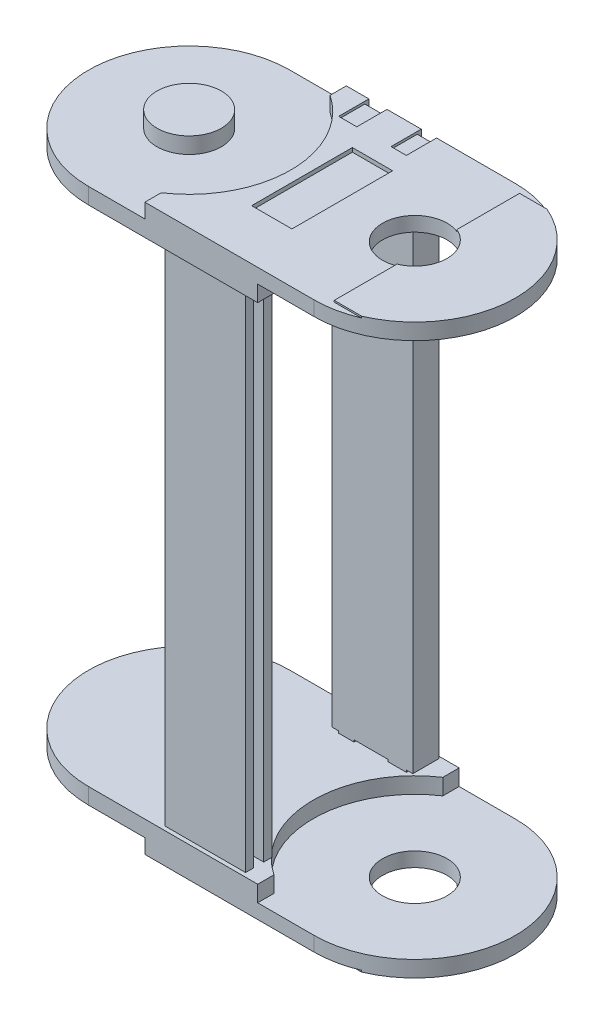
ISO-10303-21;
HEADER;
FILE_DESCRIPTION(('STEP AP214'),'2;1');
FILE_NAME('part.step','',(''),(''),'','','');
FILE_SCHEMA(('AUTOMOTIVE_DESIGN { 1 0 10303 214 1 1 1 1 }'));
ENDSEC;
DATA;
#1=APPLICATION_CONTEXT('core data for automotive mechanical design processes');
#2=APPLICATION_PROTOCOL_DEFINITION('international standard','automotive_design',2000,#1);
#3=PRODUCT_CONTEXT('',#1,'mechanical');
#4=PRODUCT('Part','Part','',(#3));
#5=PRODUCT_RELATED_PRODUCT_CATEGORY('part','',(#4));
#6=PRODUCT_DEFINITION_FORMATION('','',#4);
#7=PRODUCT_DEFINITION_CONTEXT('part definition',#1,'design');
#8=PRODUCT_DEFINITION('design','',#6,#7);
#9=PRODUCT_DEFINITION_SHAPE('','',#8);
#10=(LENGTH_UNIT() NAMED_UNIT(*) SI_UNIT(.MILLI.,.METRE.));
#11=(NAMED_UNIT(*) PLANE_ANGLE_UNIT() SI_UNIT($,.RADIAN.));
#12=(NAMED_UNIT(*) SI_UNIT($,.STERADIAN.) SOLID_ANGLE_UNIT());
#13=UNCERTAINTY_MEASURE_WITH_UNIT(LENGTH_MEASURE(1.E-05),#10,'distance_accuracy_value','');
#14=(GEOMETRIC_REPRESENTATION_CONTEXT(3) GLOBAL_UNCERTAINTY_ASSIGNED_CONTEXT((#13)) GLOBAL_UNIT_ASSIGNED_CONTEXT((#10,
#11,#12)) REPRESENTATION_CONTEXT('',''));
#15=CARTESIAN_POINT('',(0.,0.,0.));
#16=DIRECTION('',(0.,0.,1.));
#17=DIRECTION('',(1.,0.,0.));
#18=AXIS2_PLACEMENT_3D('',#15,#16,#17);
#19=CARTESIAN_POINT('',(-48.,133.,-8.));
#20=DIRECTION('',(0.,1.,0.));
#21=DIRECTION('',(-1.,0.,0.));
#22=AXIS2_PLACEMENT_3D('',#19,#20,#21);
#23=PLANE('',#22);
#24=CARTESIAN_POINT('',(-56.,133.,0.));
#25=DIRECTION('',(0.,-1.,0.));
#26=DIRECTION('',(0.,0.,-1.));
#27=AXIS2_PLACEMENT_3D('',#24,#25,#26);
#28=CIRCLE('',#27,8.);
#29=CARTESIAN_POINT('',(-56.,133.,-8.));
#30=VERTEX_POINT('',#29);
#31=EDGE_CURVE('E20',#30,#30,#28,.T.);
#32=ORIENTED_EDGE('',*,*,#31,.F.);
#33=EDGE_LOOP('',(#32));
#34=FACE_BOUND('',#33,.T.);
#35=ADVANCED_FACE('F16',(#34),#23,.T.);
#36=CARTESIAN_POINT('',(-28.,131.6,12.5));
#37=DIRECTION('',(0.,1.,0.));
#38=DIRECTION('',(1.,0.,0.));
#39=AXIS2_PLACEMENT_3D('',#36,#37,#38);
#40=PLANE('',#39);
#41=DIRECTION('',(0.,0.,1.));
#42=VECTOR('',#41,1.);
#43=CARTESIAN_POINT('',(-18.,131.6,0.));
#44=LINE('',#43,#42);
#45=CARTESIAN_POINT('',(-18.,131.6,-12.5));
#46=VERTEX_POINT('',#45);
#47=CARTESIAN_POINT('',(-18.,131.6,12.5));
#48=VERTEX_POINT('',#47);
#49=EDGE_CURVE('E2167',#46,#48,#44,.T.);
#50=ORIENTED_EDGE('',*,*,#49,.F.);
#51=DIRECTION('',(1.,0.,0.));
#52=VECTOR('',#51,1.);
#53=CARTESIAN_POINT('',(-23.,131.6,-12.5));
#54=LINE('',#53,#52);
#55=CARTESIAN_POINT('',(-28.,131.6,-12.5));
#56=VERTEX_POINT('',#55);
#57=EDGE_CURVE('E2175',#56,#46,#54,.T.);
#58=ORIENTED_EDGE('',*,*,#57,.F.);
#59=DIRECTION('',(0.,0.,-1.));
#60=VECTOR('',#59,1.);
#61=CARTESIAN_POINT('',(-28.,131.6,0.));
#62=LINE('',#61,#60);
#63=CARTESIAN_POINT('',(-28.,131.6,12.5));
#64=VERTEX_POINT('',#63);
#65=EDGE_CURVE('E2182',#64,#56,#62,.T.);
#66=ORIENTED_EDGE('',*,*,#65,.F.);
#67=DIRECTION('',(-1.,0.,0.));
#68=VECTOR('',#67,1.);
#69=CARTESIAN_POINT('',(-23.,131.6,12.5));
#70=LINE('',#69,#68);
#71=EDGE_CURVE('E2189',#48,#64,#70,.T.);
#72=ORIENTED_EDGE('',*,*,#71,.F.);
#73=EDGE_LOOP('',(#50,#58,#66,#72));
#74=FACE_BOUND('',#73,.T.);
#75=ADVANCED_FACE('F2335',(#74),#40,.T.);
#76=CARTESIAN_POINT('',(-56.,133.,0.));
#77=DIRECTION('',(0.,-1.,0.));
#78=DIRECTION('',(0.,0.,-1.));
#79=AXIS2_PLACEMENT_3D('',#76,#77,#78);
#80=CYLINDRICAL_SURFACE('',#79,8.);
#81=CARTESIAN_POINT('',(-56.,129.,0.));
#82=DIRECTION('',(0.,-1.,0.));
#83=DIRECTION('',(0.,0.,-1.));
#84=AXIS2_PLACEMENT_3D('',#81,#82,#83);
#85=CIRCLE('',#84,8.);
#86=CARTESIAN_POINT('',(-56.,129.,-8.));
#87=VERTEX_POINT('',#86);
#88=EDGE_CURVE('E1992',#87,#87,#85,.T.);
#89=ORIENTED_EDGE('',*,*,#88,.F.);
#90=EDGE_LOOP('',(#89));
#91=FACE_BOUND('',#90,.T.);
#92=ORIENTED_EDGE('',*,*,#31,.T.);
#93=EDGE_LOOP('',(#92));
#94=FACE_BOUND('',#93,.T.);
#95=ADVANCED_FACE('F2332',(#91,#94),#80,.T.);
#96=CARTESIAN_POINT('',(-56.,129.,0.));
#97=DIRECTION('',(0.,1.,0.));
#98=DIRECTION('',(0.,0.,1.));
#99=AXIS2_PLACEMENT_3D('',#96,#97,#98);
#100=CYLINDRICAL_SURFACE('',#99,25.2);
#101=DIRECTION('',(0.,-1.,0.));
#102=VECTOR('',#101,1.);
#103=CARTESIAN_POINT('',(-42.,130.8,20.9532813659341));
#104=LINE('',#103,#102);
#105=CARTESIAN_POINT('',(-42.,132.6,20.9532813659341));
#106=VERTEX_POINT('',#105);
#107=CARTESIAN_POINT('',(-42.,129.,20.9532813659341));
#108=VERTEX_POINT('',#107);
#109=EDGE_CURVE('E2005',#106,#108,#104,.T.);
#110=ORIENTED_EDGE('',*,*,#109,.F.);
#111=CARTESIAN_POINT('',(-56.,132.6,0.));
#112=DIRECTION('',(0.,1.,0.));
#113=DIRECTION('',(0.,0.,1.));
#114=AXIS2_PLACEMENT_3D('',#111,#112,#113);
#115=CIRCLE('',#114,25.2);
#116=CARTESIAN_POINT('',(-42.,132.6,-20.9532813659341));
#117=VERTEX_POINT('',#116);
#118=EDGE_CURVE('E1937',#117,#106,#115,.F.);
#119=ORIENTED_EDGE('',*,*,#118,.F.);
#120=DIRECTION('',(0.,1.,0.));
#121=VECTOR('',#120,1.);
#122=CARTESIAN_POINT('',(-42.,130.8,-20.9532813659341));
#123=LINE('',#122,#121);
#124=CARTESIAN_POINT('',(-42.,129.,-20.9532813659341));
#125=VERTEX_POINT('',#124);
#126=EDGE_CURVE('E1944',#125,#117,#123,.T.);
#127=ORIENTED_EDGE('',*,*,#126,.F.);
#128=CARTESIAN_POINT('',(-56.,129.,0.));
#129=DIRECTION('',(0.,1.,0.));
#130=DIRECTION('',(0.,0.,1.));
#131=AXIS2_PLACEMENT_3D('',#128,#129,#130);
#132=CIRCLE('',#131,25.2);
#133=EDGE_CURVE('E2004',#108,#125,#132,.T.);
#134=ORIENTED_EDGE('',*,*,#133,.F.);
#135=EDGE_LOOP('',(#110,#119,#127,#134));
#136=FACE_BOUND('',#135,.T.);
#137=ADVANCED_FACE('F2345',(#136),#100,.F.);
#138=CARTESIAN_POINT('',(9.79795897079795,132.6,23.));
#139=DIRECTION('',(0.,0.,1.));
#140=DIRECTION('',(0.,1.,0.));
#141=AXIS2_PLACEMENT_3D('',#138,#139,#140);
#142=PLANE('',#141);
#143=DIRECTION('',(0.,1.,0.));
#144=VECTOR('',#143,1.);
#145=CARTESIAN_POINT('',(3.,132.8,23.));
#146=LINE('',#145,#144);
#147=CARTESIAN_POINT('',(3.,132.6,23.));
#148=VERTEX_POINT('',#147);
#149=CARTESIAN_POINT('',(3.,133.,23.));
#150=VERTEX_POINT('',#149);
#151=EDGE_CURVE('E297',#148,#150,#146,.T.);
#152=ORIENTED_EDGE('',*,*,#151,.F.);
#153=DIRECTION('',(-1.,0.,0.));
#154=VECTOR('',#153,1.);
#155=CARTESIAN_POINT('',(-16.101020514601,132.6,23.));
#156=LINE('',#155,#154);
#157=CARTESIAN_POINT('',(9.79795897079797,132.6,23.));
#158=VERTEX_POINT('',#157);
#159=EDGE_CURVE('E1925',#158,#148,#156,.T.);
#160=ORIENTED_EDGE('',*,*,#159,.F.);
#161=DIRECTION('',(0.,-1.,0.));
#162=VECTOR('',#161,1.);
#163=CARTESIAN_POINT('',(9.79795897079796,131.,23.));
#164=LINE('',#163,#162);
#165=CARTESIAN_POINT('',(9.79795897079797,133.,23.));
#166=VERTEX_POINT('',#165);
#167=EDGE_CURVE('E2029',#166,#158,#164,.T.);
#168=ORIENTED_EDGE('',*,*,#167,.F.);
#169=DIRECTION('',(1.,0.,0.));
#170=VECTOR('',#169,1.);
#171=CARTESIAN_POINT('',(13.99999999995,133.,23.));
#172=LINE('',#171,#170);
#173=EDGE_CURVE('E2143',#150,#166,#172,.T.);
#174=ORIENTED_EDGE('',*,*,#173,.F.);
#175=EDGE_LOOP('',(#152,#160,#168,#174));
#176=FACE_BOUND('',#175,.T.);
#177=ADVANCED_FACE('F2300',(#176),#142,.T.);
#178=CARTESIAN_POINT('',(3.,132.6,23.));
#179=DIRECTION('',(-1.,0.,0.));
#180=DIRECTION('',(0.,1.,0.));
#181=AXIS2_PLACEMENT_3D('',#178,#179,#180);
#182=PLANE('',#181);
#183=DIRECTION('',(0.,1.,0.));
#184=VECTOR('',#183,1.);
#185=CARTESIAN_POINT('',(3.,131.,7.41619848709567));
#186=LINE('',#185,#184);
#187=CARTESIAN_POINT('',(3.,132.6,7.41619848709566));
#188=VERTEX_POINT('',#187);
#189=CARTESIAN_POINT('',(3.,133.,7.41619848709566));
#190=VERTEX_POINT('',#189);
#191=EDGE_CURVE('E2139',#188,#190,#186,.T.);
#192=ORIENTED_EDGE('',*,*,#191,.F.);
#193=DIRECTION('',(0.,0.,-1.));
#194=VECTOR('',#193,1.);
#195=CARTESIAN_POINT('',(3.,132.6,0.));
#196=LINE('',#195,#194);
#197=EDGE_CURVE('E1921',#148,#188,#196,.T.);
#198=ORIENTED_EDGE('',*,*,#197,.F.);
#199=ORIENTED_EDGE('',*,*,#151,.T.);
#200=DIRECTION('',(0.,0.,1.));
#201=VECTOR('',#200,1.);
#202=CARTESIAN_POINT('',(3.,133.,0.));
#203=LINE('',#202,#201);
#204=EDGE_CURVE('E2147',#190,#150,#203,.T.);
#205=ORIENTED_EDGE('',*,*,#204,.F.);
#206=EDGE_LOOP('',(#192,#198,#199,#205));
#207=FACE_BOUND('',#206,.T.);
#208=ADVANCED_FACE('F2293',(#207),#182,.T.);
#209=CARTESIAN_POINT('',(3.,132.6,-7.41619848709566));
#210=DIRECTION('',(-1.,0.,0.));
#211=DIRECTION('',(0.,1.,0.));
#212=AXIS2_PLACEMENT_3D('',#209,#210,#211);
#213=PLANE('',#212);
#214=DIRECTION('',(0.,-1.,0.));
#215=VECTOR('',#214,1.);
#216=CARTESIAN_POINT('',(2.99999999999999,131.,-7.41619848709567));
#217=LINE('',#216,#215);
#218=CARTESIAN_POINT('',(3.,133.,-7.41619848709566));
#219=VERTEX_POINT('',#218);
#220=CARTESIAN_POINT('',(3.,132.6,-7.41619848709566));
#221=VERTEX_POINT('',#220);
#222=EDGE_CURVE('E2032',#219,#221,#217,.T.);
#223=ORIENTED_EDGE('',*,*,#222,.F.);
#224=DIRECTION('',(0.,0.,1.));
#225=VECTOR('',#224,1.);
#226=CARTESIAN_POINT('',(3.,133.,0.));
#227=LINE('',#226,#225);
#228=CARTESIAN_POINT('',(3.,133.,-23.));
#229=VERTEX_POINT('',#228);
#230=EDGE_CURVE('E282',#229,#219,#227,.T.);
#231=ORIENTED_EDGE('',*,*,#230,.F.);
#232=DIRECTION('',(0.,1.,0.));
#233=VECTOR('',#232,1.);
#234=CARTESIAN_POINT('',(3.,132.8,-23.));
#235=LINE('',#234,#233);
#236=CARTESIAN_POINT('',(3.,132.6,-23.));
#237=VERTEX_POINT('',#236);
#238=EDGE_CURVE('E2192',#237,#229,#235,.T.);
#239=ORIENTED_EDGE('',*,*,#238,.F.);
#240=DIRECTION('',(0.,0.,-1.));
#241=VECTOR('',#240,1.);
#242=CARTESIAN_POINT('',(3.,132.6,0.));
#243=LINE('',#242,#241);
#244=EDGE_CURVE('E1912',#221,#237,#243,.T.);
#245=ORIENTED_EDGE('',*,*,#244,.F.);
#246=EDGE_LOOP('',(#223,#231,#239,#245));
#247=FACE_BOUND('',#246,.T.);
#248=ADVANCED_FACE('F2354',(#247),#213,.T.);
#249=CARTESIAN_POINT('',(9.79795897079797,133.,-23.));
#250=DIRECTION('',(0.,0.,-1.));
#251=DIRECTION('',(0.,-1.,0.));
#252=AXIS2_PLACEMENT_3D('',#249,#250,#251);
#253=PLANE('',#252);
#254=ORIENTED_EDGE('',*,*,#238,.T.);
#255=DIRECTION('',(-1.,0.,0.));
#256=VECTOR('',#255,1.);
#257=CARTESIAN_POINT('',(13.99999999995,133.,-23.));
#258=LINE('',#257,#256);
#259=CARTESIAN_POINT('',(9.79795897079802,133.,-23.));
#260=VERTEX_POINT('',#259);
#261=EDGE_CURVE('E2156',#260,#229,#258,.T.);
#262=ORIENTED_EDGE('',*,*,#261,.F.);
#263=DIRECTION('',(0.,-1.,0.));
#264=VECTOR('',#263,1.);
#265=CARTESIAN_POINT('',(9.79795897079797,132.8,-23.));
#266=LINE('',#265,#264);
#267=CARTESIAN_POINT('',(9.79795897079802,132.6,-23.));
#268=VERTEX_POINT('',#267);
#269=EDGE_CURVE('E2193',#260,#268,#266,.T.);
#270=ORIENTED_EDGE('',*,*,#269,.T.);
#271=DIRECTION('',(1.,0.,0.));
#272=VECTOR('',#271,1.);
#273=CARTESIAN_POINT('',(-16.101020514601,132.6,-23.));
#274=LINE('',#273,#272);
#275=EDGE_CURVE('E1908',#237,#268,#274,.T.);
#276=ORIENTED_EDGE('',*,*,#275,.F.);
#277=EDGE_LOOP('',(#254,#262,#270,#276));
#278=FACE_BOUND('',#277,.T.);
#279=ADVANCED_FACE('F2357',(#278),#253,.T.);
#280=CARTESIAN_POINT('',(-18.,132.6,12.5));
#281=DIRECTION('',(0.,0.,-1.));
#282=DIRECTION('',(0.,-1.,0.));
#283=AXIS2_PLACEMENT_3D('',#280,#281,#282);
#284=PLANE('',#283);
#285=DIRECTION('',(0.,-1.,0.));
#286=VECTOR('',#285,1.);
#287=CARTESIAN_POINT('',(-28.,132.1,12.5));
#288=LINE('',#287,#286);
#289=CARTESIAN_POINT('',(-28.,132.6,12.5));
#290=VERTEX_POINT('',#289);
#291=EDGE_CURVE('E2185',#290,#64,#288,.T.);
#292=ORIENTED_EDGE('',*,*,#291,.F.);
#293=DIRECTION('',(-1.,0.,0.));
#294=VECTOR('',#293,1.);
#295=CARTESIAN_POINT('',(-16.101020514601,132.6,12.5));
#296=LINE('',#295,#294);
#297=CARTESIAN_POINT('',(-18.,132.6,12.5));
#298=VERTEX_POINT('',#297);
#299=EDGE_CURVE('E1904',#298,#290,#296,.T.);
#300=ORIENTED_EDGE('',*,*,#299,.F.);
#301=DIRECTION('',(0.,1.,0.));
#302=VECTOR('',#301,1.);
#303=CARTESIAN_POINT('',(-18.,132.1,12.5));
#304=LINE('',#303,#302);
#305=EDGE_CURVE('E2161',#48,#298,#304,.T.);
#306=ORIENTED_EDGE('',*,*,#305,.F.);
#307=ORIENTED_EDGE('',*,*,#71,.T.);
#308=EDGE_LOOP('',(#292,#300,#306,#307));
#309=FACE_BOUND('',#308,.T.);
#310=ADVANCED_FACE('F2361',(#309),#284,.T.);
#311=CARTESIAN_POINT('',(-28.,132.6,12.5));
#312=DIRECTION('',(1.,0.,0.));
#313=DIRECTION('',(0.,-1.,0.));
#314=AXIS2_PLACEMENT_3D('',#311,#312,#313);
#315=PLANE('',#314);
#316=DIRECTION('',(0.,-1.,0.));
#317=VECTOR('',#316,1.);
#318=CARTESIAN_POINT('',(-28.,132.1,-12.5));
#319=LINE('',#318,#317);
#320=CARTESIAN_POINT('',(-28.,132.6,-12.5));
#321=VERTEX_POINT('',#320);
#322=EDGE_CURVE('E2178',#321,#56,#319,.T.);
#323=ORIENTED_EDGE('',*,*,#322,.F.);
#324=DIRECTION('',(0.,0.,-1.));
#325=VECTOR('',#324,1.);
#326=CARTESIAN_POINT('',(-28.,132.6,0.));
#327=LINE('',#326,#325);
#328=EDGE_CURVE('E1900',#290,#321,#327,.T.);
#329=ORIENTED_EDGE('',*,*,#328,.F.);
#330=ORIENTED_EDGE('',*,*,#291,.T.);
#331=ORIENTED_EDGE('',*,*,#65,.T.);
#332=EDGE_LOOP('',(#323,#329,#330,#331));
#333=FACE_BOUND('',#332,.T.);
#334=ADVANCED_FACE('F2365',(#333),#315,.T.);
#335=CARTESIAN_POINT('',(-18.,131.6,-12.5));
#336=DIRECTION('',(0.,0.,1.));
#337=DIRECTION('',(0.,1.,0.));
#338=AXIS2_PLACEMENT_3D('',#335,#336,#337);
#339=PLANE('',#338);
#340=DIRECTION('',(0.,-1.,0.));
#341=VECTOR('',#340,1.);
#342=CARTESIAN_POINT('',(-18.,132.1,-12.5));
#343=LINE('',#342,#341);
#344=CARTESIAN_POINT('',(-18.,132.6,-12.5));
#345=VERTEX_POINT('',#344);
#346=EDGE_CURVE('E2171',#345,#46,#343,.T.);
#347=ORIENTED_EDGE('',*,*,#346,.F.);
#348=DIRECTION('',(1.,0.,0.));
#349=VECTOR('',#348,1.);
#350=CARTESIAN_POINT('',(-16.101020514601,132.6,-12.5));
#351=LINE('',#350,#349);
#352=EDGE_CURVE('E1896',#321,#345,#351,.T.);
#353=ORIENTED_EDGE('',*,*,#352,.F.);
#354=ORIENTED_EDGE('',*,*,#322,.T.);
#355=ORIENTED_EDGE('',*,*,#57,.T.);
#356=EDGE_LOOP('',(#347,#353,#354,#355));
#357=FACE_BOUND('',#356,.T.);
#358=ADVANCED_FACE('F2314',(#357),#339,.T.);
#359=CARTESIAN_POINT('',(-18.,131.6,12.5));
#360=DIRECTION('',(-1.,0.,0.));
#361=DIRECTION('',(0.,1.,0.));
#362=AXIS2_PLACEMENT_3D('',#359,#360,#361);
#363=PLANE('',#362);
#364=ORIENTED_EDGE('',*,*,#305,.T.);
#365=DIRECTION('',(0.,0.,1.));
#366=VECTOR('',#365,1.);
#367=CARTESIAN_POINT('',(-18.,132.6,0.));
#368=LINE('',#367,#366);
#369=EDGE_CURVE('E1891',#345,#298,#368,.T.);
#370=ORIENTED_EDGE('',*,*,#369,.F.);
#371=ORIENTED_EDGE('',*,*,#346,.T.);
#372=ORIENTED_EDGE('',*,*,#49,.T.);
#373=EDGE_LOOP('',(#364,#370,#371,#372));
#374=FACE_BOUND('',#373,.T.);
#375=ADVANCED_FACE('F2304',(#374),#363,.T.);
#376=CARTESIAN_POINT('',(3.,133.,23.));
#377=DIRECTION('',(0.,1.,0.));
#378=DIRECTION('',(1.,0.,0.));
#379=AXIS2_PLACEMENT_3D('',#376,#377,#378);
#380=PLANE('',#379);
#381=ORIENTED_EDGE('',*,*,#173,.T.);
#382=CARTESIAN_POINT('',(-9.99722444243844E-11,133.,9.99794611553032E-11));
#383=DIRECTION('',(0.,1.,0.));
#384=DIRECTION('',(0.,0.,1.));
#385=AXIS2_PLACEMENT_3D('',#382,#383,#384);
#386=CIRCLE('',#385,25.);
#387=EDGE_CURVE('E2269',#260,#166,#386,.F.);
#388=ORIENTED_EDGE('',*,*,#387,.F.);
#389=ORIENTED_EDGE('',*,*,#261,.T.);
#390=ORIENTED_EDGE('',*,*,#230,.T.);
#391=CARTESIAN_POINT('',(0.,133.,0.));
#392=DIRECTION('',(0.,-1.,0.));
#393=DIRECTION('',(0.,0.,-1.));
#394=AXIS2_PLACEMENT_3D('',#391,#392,#393);
#395=CIRCLE('',#394,8.);
#396=EDGE_CURVE('E289',#190,#219,#395,.F.);
#397=ORIENTED_EDGE('',*,*,#396,.F.);
#398=ORIENTED_EDGE('',*,*,#204,.T.);
#399=EDGE_LOOP('',(#381,#388,#389,#390,#397,#398));
#400=FACE_BOUND('',#399,.T.);
#401=ADVANCED_FACE('F2302',(#400),#380,.T.);
#402=CARTESIAN_POINT('',(0.,133.,0.));
#403=DIRECTION('',(0.,-1.,0.));
#404=DIRECTION('',(0.,0.,-1.));
#405=AXIS2_PLACEMENT_3D('',#402,#403,#404);
#406=CYLINDRICAL_SURFACE('',#405,8.);
#407=CARTESIAN_POINT('',(0.,129.,0.));
#408=DIRECTION('',(0.,-1.,0.));
#409=DIRECTION('',(0.,0.,-1.));
#410=AXIS2_PLACEMENT_3D('',#407,#408,#409);
#411=CIRCLE('',#410,8.);
#412=CARTESIAN_POINT('',(0.,129.,-8.));
#413=VERTEX_POINT('',#412);
#414=EDGE_CURVE('E1858',#413,#413,#411,.F.);
#415=ORIENTED_EDGE('',*,*,#414,.F.);
#416=EDGE_LOOP('',(#415));
#417=FACE_BOUND('',#416,.T.);
#418=ORIENTED_EDGE('',*,*,#222,.T.);
#419=CARTESIAN_POINT('',(0.,132.6,0.));
#420=DIRECTION('',(0.,-1.,0.));
#421=DIRECTION('',(0.,0.,-1.));
#422=AXIS2_PLACEMENT_3D('',#419,#420,#421);
#423=CIRCLE('',#422,8.);
#424=EDGE_CURVE('E1918',#188,#221,#423,.T.);
#425=ORIENTED_EDGE('',*,*,#424,.F.);
#426=ORIENTED_EDGE('',*,*,#191,.T.);
#427=ORIENTED_EDGE('',*,*,#396,.T.);
#428=EDGE_LOOP('',(#418,#425,#426,#427));
#429=FACE_BOUND('',#428,.T.);
#430=ADVANCED_FACE('F2290',(#417,#429),#406,.F.);
#431=CARTESIAN_POINT('',(-18.,0.00299999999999,24.));
#432=DIRECTION('',(0.,-1.,0.));
#433=DIRECTION('',(-1.,0.,0.));
#434=AXIS2_PLACEMENT_3D('',#431,#432,#433);
#435=PLANE('',#434);
#436=DIRECTION('',(0.,0.,-1.));
#437=VECTOR('',#436,1.);
#438=CARTESIAN_POINT('',(-23.,0.00299999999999,20.75));
#439=LINE('',#438,#437);
#440=CARTESIAN_POINT('',(-23.,0.00299999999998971,22.));
#441=VERTEX_POINT('',#440);
#442=CARTESIAN_POINT('',(-23.,0.00299999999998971,19.5));
#443=VERTEX_POINT('',#442);
#444=EDGE_CURVE('E1711',#441,#443,#439,.T.);
#445=ORIENTED_EDGE('',*,*,#444,.F.);
#446=DIRECTION('',(-1.,0.,0.));
#447=VECTOR('',#446,1.);
#448=CARTESIAN_POINT('',(-20.5,0.00299999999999,22.));
#449=LINE('',#448,#447);
#450=CARTESIAN_POINT('',(-18.,0.00299999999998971,22.));
#451=VERTEX_POINT('',#450);
#452=EDGE_CURVE('E1724',#451,#441,#449,.T.);
#453=ORIENTED_EDGE('',*,*,#452,.F.);
#454=DIRECTION('',(0.,0.,-1.));
#455=VECTOR('',#454,1.);
#456=CARTESIAN_POINT('',(-18.,0.00299999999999,23.));
#457=LINE('',#456,#455);
#458=CARTESIAN_POINT('',(-18.,0.00299999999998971,24.));
#459=VERTEX_POINT('',#458);
#460=EDGE_CURVE('E1737',#459,#451,#457,.T.);
#461=ORIENTED_EDGE('',*,*,#460,.F.);
#462=DIRECTION('',(1.,0.,0.));
#463=VECTOR('',#462,1.);
#464=CARTESIAN_POINT('',(-28.,0.00299999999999,24.));
#465=LINE('',#464,#463);
#466=CARTESIAN_POINT('',(-38.,0.00299999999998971,24.));
#467=VERTEX_POINT('',#466);
#468=EDGE_CURVE('E1750',#467,#459,#465,.T.);
#469=ORIENTED_EDGE('',*,*,#468,.F.);
#470=DIRECTION('',(0.,0.,1.));
#471=VECTOR('',#470,1.);
#472=CARTESIAN_POINT('',(-38.,0.00299999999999,23.));
#473=LINE('',#472,#471);
#474=CARTESIAN_POINT('',(-38.,0.00299999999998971,22.));
#475=VERTEX_POINT('',#474);
#476=EDGE_CURVE('E1763',#475,#467,#473,.T.);
#477=ORIENTED_EDGE('',*,*,#476,.F.);
#478=DIRECTION('',(-1.,0.,0.));
#479=VECTOR('',#478,1.);
#480=CARTESIAN_POINT('',(-35.5,0.00299999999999,22.));
#481=LINE('',#480,#479);
#482=CARTESIAN_POINT('',(-33.,0.00299999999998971,22.));
#483=VERTEX_POINT('',#482);
#484=EDGE_CURVE('E1776',#483,#475,#481,.T.);
#485=ORIENTED_EDGE('',*,*,#484,.F.);
#486=DIRECTION('',(0.,0.,1.));
#487=VECTOR('',#486,1.);
#488=CARTESIAN_POINT('',(-33.,0.00299999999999,20.75));
#489=LINE('',#488,#487);
#490=CARTESIAN_POINT('',(-33.,0.00299999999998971,19.5));
#491=VERTEX_POINT('',#490);
#492=EDGE_CURVE('E1789',#491,#483,#489,.T.);
#493=ORIENTED_EDGE('',*,*,#492,.F.);
#494=DIRECTION('',(1.,0.,0.));
#495=VECTOR('',#494,1.);
#496=CARTESIAN_POINT('',(-35.5,0.00299999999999,19.5));
#497=LINE('',#496,#495);
#498=CARTESIAN_POINT('',(-38.,0.00299999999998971,19.5));
#499=VERTEX_POINT('',#498);
#500=EDGE_CURVE('E1802',#499,#491,#497,.T.);
#501=ORIENTED_EDGE('',*,*,#500,.F.);
#502=DIRECTION('',(0.,0.,1.));
#503=VECTOR('',#502,1.);
#504=CARTESIAN_POINT('',(-38.,0.00299999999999,18.5));
#505=LINE('',#504,#503);
#506=CARTESIAN_POINT('',(-38.,0.00299999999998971,17.5));
#507=VERTEX_POINT('',#506);
#508=EDGE_CURVE('E1814',#507,#499,#505,.T.);
#509=ORIENTED_EDGE('',*,*,#508,.F.);
#510=DIRECTION('',(-1.,0.,0.));
#511=VECTOR('',#510,1.);
#512=CARTESIAN_POINT('',(-28.,0.00299999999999,17.5));
#513=LINE('',#512,#511);
#514=CARTESIAN_POINT('',(-18.,0.00299999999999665,17.5));
#515=VERTEX_POINT('',#514);
#516=EDGE_CURVE('E1826',#515,#507,#513,.T.);
#517=ORIENTED_EDGE('',*,*,#516,.F.);
#518=DIRECTION('',(0.,0.,-1.));
#519=VECTOR('',#518,1.);
#520=CARTESIAN_POINT('',(-18.,0.00299999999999,18.5));
#521=LINE('',#520,#519);
#522=CARTESIAN_POINT('',(-18.,0.00299999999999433,19.5));
#523=VERTEX_POINT('',#522);
#524=EDGE_CURVE('E1697',#523,#515,#521,.T.);
#525=ORIENTED_EDGE('',*,*,#524,.F.);
#526=DIRECTION('',(1.,0.,0.));
#527=VECTOR('',#526,1.);
#528=CARTESIAN_POINT('',(-20.5,0.00299999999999,19.5));
#529=LINE('',#528,#527);
#530=EDGE_CURVE('E1698',#443,#523,#529,.T.);
#531=ORIENTED_EDGE('',*,*,#530,.F.);
#532=EDGE_LOOP('',(#445,#453,#461,#469,#477,#485,#493,#501,#509,#517,#525,#531));
#533=FACE_BOUND('',#532,.T.);
#534=ADVANCED_FACE('F2311',(#533),#435,.T.);
#535=CARTESIAN_POINT('',(-42.,129.,25.));
#536=DIRECTION('',(-1.,0.,0.));
#537=DIRECTION('',(0.,1.,0.));
#538=AXIS2_PLACEMENT_3D('',#535,#536,#537);
#539=PLANE('',#538);
#540=DIRECTION('',(0.,0.,-1.));
#541=VECTOR('',#540,1.);
#542=CARTESIAN_POINT('',(-42.,129.,0.));
#543=LINE('',#542,#541);
#544=CARTESIAN_POINT('',(-42.,129.,25.));
#545=VERTEX_POINT('',#544);
#546=EDGE_CURVE('E2000',#545,#108,#543,.T.);
#547=ORIENTED_EDGE('',*,*,#546,.F.);
#548=DIRECTION('',(0.,-1.,0.));
#549=VECTOR('',#548,1.);
#550=CARTESIAN_POINT('',(-42.,128.8,25.));
#551=LINE('',#550,#549);
#552=CARTESIAN_POINT('',(-42.,132.6,25.));
#553=VERTEX_POINT('',#552);
#554=EDGE_CURVE('E2011',#553,#545,#551,.T.);
#555=ORIENTED_EDGE('',*,*,#554,.F.);
#556=DIRECTION('',(0.,0.,1.));
#557=VECTOR('',#556,1.);
#558=CARTESIAN_POINT('',(-42.,132.6,0.));
#559=LINE('',#558,#557);
#560=EDGE_CURVE('E1934',#106,#553,#559,.T.);
#561=ORIENTED_EDGE('',*,*,#560,.F.);
#562=ORIENTED_EDGE('',*,*,#109,.T.);
#563=EDGE_LOOP('',(#547,#555,#561,#562));
#564=FACE_BOUND('',#563,.T.);
#565=ADVANCED_FACE('F2876',(#564),#539,.T.);
#566=CARTESIAN_POINT('',(-30.8,129.,-25.));
#567=DIRECTION('',(0.,1.,0.));
#568=DIRECTION('',(-1.,0.,0.));
#569=AXIS2_PLACEMENT_3D('',#566,#567,#568);
#570=PLANE('',#569);
#571=ORIENTED_EDGE('',*,*,#88,.T.);
#572=EDGE_LOOP('',(#571));
#573=FACE_BOUND('',#572,.T.);
#574=ORIENTED_EDGE('',*,*,#546,.T.);
#575=ORIENTED_EDGE('',*,*,#133,.T.);
#576=DIRECTION('',(0.,0.,1.));
#577=VECTOR('',#576,1.);
#578=CARTESIAN_POINT('',(-42.,129.,-22.976640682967));
#579=LINE('',#578,#577);
#580=CARTESIAN_POINT('',(-42.,129.,-25.));
#581=VERTEX_POINT('',#580);
#582=EDGE_CURVE('E1988',#581,#125,#579,.T.);
#583=ORIENTED_EDGE('',*,*,#582,.F.);
#584=DIRECTION('',(1.,0.,0.));
#585=VECTOR('',#584,1.);
#586=CARTESIAN_POINT('',(-46.2,129.,-25.));
#587=LINE('',#586,#585);
#588=CARTESIAN_POINT('',(-56.,129.,-25.));
#589=VERTEX_POINT('',#588);
#590=EDGE_CURVE('E1665',#589,#581,#587,.T.);
#591=ORIENTED_EDGE('',*,*,#590,.F.);
#592=CARTESIAN_POINT('',(-56.,129.,0.));
#593=DIRECTION('',(0.,1.,0.));
#594=DIRECTION('',(0.,0.,1.));
#595=AXIS2_PLACEMENT_3D('',#592,#593,#594);
#596=CIRCLE('',#595,25.);
#597=CARTESIAN_POINT('',(-55.99999999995,129.,24.99999999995));
#598=VERTEX_POINT('',#597);
#599=EDGE_CURVE('E1666',#598,#589,#596,.F.);
#600=ORIENTED_EDGE('',*,*,#599,.F.);
#601=DIRECTION('',(-1.,0.,0.));
#602=VECTOR('',#601,1.);
#603=CARTESIAN_POINT('',(-28.,129.,25.));
#604=LINE('',#603,#602);
#605=EDGE_CURVE('E1684',#545,#598,#604,.T.);
#606=ORIENTED_EDGE('',*,*,#605,.F.);
#607=EDGE_LOOP('',(#574,#575,#583,#591,#600,#606));
#608=FACE_BOUND('',#607,.T.);
#609=ADVANCED_FACE('F2393',(#573,#608),#570,.T.);
#610=CARTESIAN_POINT('',(-42.,129.,-20.9532813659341));
#611=DIRECTION('',(-1.,0.,0.));
#612=DIRECTION('',(0.,1.,0.));
#613=AXIS2_PLACEMENT_3D('',#610,#611,#612);
#614=PLANE('',#613);
#615=ORIENTED_EDGE('',*,*,#582,.T.);
#616=ORIENTED_EDGE('',*,*,#126,.T.);
#617=DIRECTION('',(0.,0.,1.));
#618=VECTOR('',#617,1.);
#619=CARTESIAN_POINT('',(-42.,132.6,0.));
#620=LINE('',#619,#618);
#621=CARTESIAN_POINT('',(-42.,132.6,-25.));
#622=VERTEX_POINT('',#621);
#623=EDGE_CURVE('E1940',#622,#117,#620,.T.);
#624=ORIENTED_EDGE('',*,*,#623,.F.);
#625=DIRECTION('',(0.,1.,0.));
#626=VECTOR('',#625,1.);
#627=CARTESIAN_POINT('',(-42.,128.8,-25.));
#628=LINE('',#627,#626);
#629=EDGE_CURVE('E1965',#581,#622,#628,.T.);
#630=ORIENTED_EDGE('',*,*,#629,.F.);
#631=EDGE_LOOP('',(#615,#616,#624,#630));
#632=FACE_BOUND('',#631,.T.);
#633=ADVANCED_FACE('F2384',(#632),#614,.T.);
#634=CARTESIAN_POINT('',(-42.,132.6,25.));
#635=DIRECTION('',(0.,1.,0.));
#636=DIRECTION('',(1.,0.,0.));
#637=AXIS2_PLACEMENT_3D('',#634,#635,#636);
#638=PLANE('',#637);
#639=ORIENTED_EDGE('',*,*,#352,.T.);
#640=ORIENTED_EDGE('',*,*,#369,.T.);
#641=ORIENTED_EDGE('',*,*,#299,.T.);
#642=ORIENTED_EDGE('',*,*,#328,.T.);
#643=EDGE_LOOP('',(#639,#640,#641,#642));
#644=FACE_BOUND('',#643,.T.);
#645=DIRECTION('',(0.,0.,1.));
#646=VECTOR('',#645,1.);
#647=CARTESIAN_POINT('',(-23.4,132.6,-21.25));
#648=LINE('',#647,#646);
#649=CARTESIAN_POINT('',(-23.4,132.6,-25.));
#650=VERTEX_POINT('',#649);
#651=CARTESIAN_POINT('',(-23.4,132.6,-17.5));
#652=VERTEX_POINT('',#651);
#653=EDGE_CURVE('E1655',#650,#652,#648,.T.);
#654=ORIENTED_EDGE('',*,*,#653,.F.);
#655=DIRECTION('',(1.,0.,0.));
#656=VECTOR('',#655,1.);
#657=CARTESIAN_POINT('',(-27.65,132.6,-25.));
#658=LINE('',#657,#656);
#659=CARTESIAN_POINT('',(-31.9,132.6,-25.));
#660=VERTEX_POINT('',#659);
#661=EDGE_CURVE('E1651',#660,#650,#658,.T.);
#662=ORIENTED_EDGE('',*,*,#661,.F.);
#663=DIRECTION('',(0.,0.,-1.));
#664=VECTOR('',#663,1.);
#665=CARTESIAN_POINT('',(-31.9,132.6,-21.25));
#666=LINE('',#665,#664);
#667=CARTESIAN_POINT('',(-31.9,132.6,-17.5));
#668=VERTEX_POINT('',#667);
#669=EDGE_CURVE('E1676',#668,#660,#666,.T.);
#670=ORIENTED_EDGE('',*,*,#669,.F.);
#671=DIRECTION('',(1.,0.,0.));
#672=VECTOR('',#671,1.);
#673=CARTESIAN_POINT('',(-34.15,132.6,-17.5));
#674=LINE('',#673,#672);
#675=CARTESIAN_POINT('',(-36.4,132.6,-17.5));
#676=VERTEX_POINT('',#675);
#677=EDGE_CURVE('E1854',#676,#668,#674,.T.);
#678=ORIENTED_EDGE('',*,*,#677,.F.);
#679=DIRECTION('',(0.,0.,1.));
#680=VECTOR('',#679,1.);
#681=CARTESIAN_POINT('',(-36.4,132.6,-21.25));
#682=LINE('',#681,#680);
#683=CARTESIAN_POINT('',(-36.4,132.6,-25.));
#684=VERTEX_POINT('',#683);
#685=EDGE_CURVE('E1964',#684,#676,#682,.T.);
#686=ORIENTED_EDGE('',*,*,#685,.F.);
#687=DIRECTION('',(1.,0.,0.));
#688=VECTOR('',#687,1.);
#689=CARTESIAN_POINT('',(-46.2,132.6,-25.));
#690=LINE('',#689,#688);
#691=EDGE_CURVE('E1960',#622,#684,#690,.T.);
#692=ORIENTED_EDGE('',*,*,#691,.F.);
#693=ORIENTED_EDGE('',*,*,#623,.T.);
#694=ORIENTED_EDGE('',*,*,#118,.T.);
#695=ORIENTED_EDGE('',*,*,#560,.T.);
#696=DIRECTION('',(-1.,0.,0.));
#697=VECTOR('',#696,1.);
#698=CARTESIAN_POINT('',(-28.,132.6,25.));
#699=LINE('',#698,#697);
#700=CARTESIAN_POINT('',(-5.00169757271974E-11,132.6,25.));
#701=VERTEX_POINT('',#700);
#702=EDGE_CURVE('E2017',#701,#553,#699,.T.);
#703=ORIENTED_EDGE('',*,*,#702,.F.);
#704=CARTESIAN_POINT('',(-1.00023951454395E-10,132.6,-1.00025E-10));
#705=DIRECTION('',(0.,1.,0.));
#706=DIRECTION('',(0.,0.,1.));
#707=AXIS2_PLACEMENT_3D('',#704,#705,#706);
#708=CIRCLE('',#707,25.);
#709=EDGE_CURVE('E1931',#701,#158,#708,.T.);
#710=ORIENTED_EDGE('',*,*,#709,.T.);
#711=ORIENTED_EDGE('',*,*,#159,.T.);
#712=ORIENTED_EDGE('',*,*,#197,.T.);
#713=ORIENTED_EDGE('',*,*,#424,.T.);
#714=ORIENTED_EDGE('',*,*,#244,.T.);
#715=ORIENTED_EDGE('',*,*,#275,.T.);
#716=CARTESIAN_POINT('',(-9.99722444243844E-11,132.6,9.99794611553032E-11));
#717=DIRECTION('',(0.,1.,0.));
#718=DIRECTION('',(0.,0.,1.));
#719=AXIS2_PLACEMENT_3D('',#716,#717,#718);
#720=CIRCLE('',#719,25.);
#721=CARTESIAN_POINT('',(-4.99861222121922E-11,132.6,-25.));
#722=VERTEX_POINT('',#721);
#723=EDGE_CURVE('E1895',#722,#268,#720,.F.);
#724=ORIENTED_EDGE('',*,*,#723,.F.);
#725=DIRECTION('',(1.,0.,0.));
#726=VECTOR('',#725,1.);
#727=CARTESIAN_POINT('',(-9.8,132.6,-25.));
#728=LINE('',#727,#726);
#729=CARTESIAN_POINT('',(-19.6,132.6,-25.));
#730=VERTEX_POINT('',#729);
#731=EDGE_CURVE('E1631',#730,#722,#728,.T.);
#732=ORIENTED_EDGE('',*,*,#731,.F.);
#733=DIRECTION('',(0.,0.,-1.));
#734=VECTOR('',#733,1.);
#735=CARTESIAN_POINT('',(-19.6,132.6,-21.25));
#736=LINE('',#735,#734);
#737=CARTESIAN_POINT('',(-19.6,132.6,-17.5));
#738=VERTEX_POINT('',#737);
#739=EDGE_CURVE('E1643',#738,#730,#736,.T.);
#740=ORIENTED_EDGE('',*,*,#739,.F.);
#741=DIRECTION('',(1.,0.,0.));
#742=VECTOR('',#741,1.);
#743=CARTESIAN_POINT('',(-21.5,132.6,-17.5));
#744=LINE('',#743,#742);
#745=EDGE_CURVE('E1850',#652,#738,#744,.T.);
#746=ORIENTED_EDGE('',*,*,#745,.F.);
#747=EDGE_LOOP('',(#654,#662,#670,#678,#686,#692,#693,#694,#695,#703,#710,#711,#712,#713,#714,
#715,#724,#732,#740,#746));
#748=FACE_BOUND('',#747,.T.);
#749=ADVANCED_FACE('F2295',(#644,#748),#638,.T.);
#750=CARTESIAN_POINT('',(-9.99722444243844E-11,129.,9.99794611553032E-11));
#751=DIRECTION('',(0.,1.,0.));
#752=DIRECTION('',(0.,0.,1.));
#753=AXIS2_PLACEMENT_3D('',#750,#751,#752);
#754=CYLINDRICAL_SURFACE('',#753,25.);
#755=ORIENTED_EDGE('',*,*,#387,.T.);
#756=ORIENTED_EDGE('',*,*,#167,.T.);
#757=ORIENTED_EDGE('',*,*,#709,.F.);
#758=DIRECTION('',(0.,1.,0.));
#759=VECTOR('',#758,1.);
#760=CARTESIAN_POINT('',(0.,128.8,25.));
#761=LINE('',#760,#759);
#762=CARTESIAN_POINT('',(-5.00169757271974E-11,129.,25.));
#763=VERTEX_POINT('',#762);
#764=EDGE_CURVE('E2023',#763,#701,#761,.T.);
#765=ORIENTED_EDGE('',*,*,#764,.F.);
#766=CARTESIAN_POINT('',(-1.00023951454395E-10,129.,-1.00025E-10));
#767=DIRECTION('',(0.,1.,0.));
#768=DIRECTION('',(0.,0.,1.));
#769=AXIS2_PLACEMENT_3D('',#766,#767,#768);
#770=CIRCLE('',#769,25.);
#771=CARTESIAN_POINT('',(-4.99861222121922E-11,129.,-25.));
#772=VERTEX_POINT('',#771);
#773=EDGE_CURVE('E2266',#772,#763,#770,.F.);
#774=ORIENTED_EDGE('',*,*,#773,.F.);
#775=DIRECTION('',(0.,-1.,0.));
#776=VECTOR('',#775,1.);
#777=CARTESIAN_POINT('',(0.,128.8,-25.));
#778=LINE('',#777,#776);
#779=EDGE_CURVE('E1880',#722,#772,#778,.T.);
#780=ORIENTED_EDGE('',*,*,#779,.F.);
#781=ORIENTED_EDGE('',*,*,#723,.T.);
#782=ORIENTED_EDGE('',*,*,#269,.F.);
#783=EDGE_LOOP('',(#755,#756,#757,#765,#774,#780,#781,#782));
#784=FACE_BOUND('',#783,.T.);
#785=ADVANCED_FACE('F2383',(#784),#754,.T.);
#786=CARTESIAN_POINT('',(24.9999999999,129.,25.));
#787=DIRECTION('',(0.,-1.,0.));
#788=DIRECTION('',(-1.,0.,0.));
#789=AXIS2_PLACEMENT_3D('',#786,#787,#788);
#790=PLANE('',#789);
#791=ORIENTED_EDGE('',*,*,#414,.T.);
#792=EDGE_LOOP('',(#791));
#793=FACE_BOUND('',#792,.T.);
#794=DIRECTION('',(0.,0.,1.));
#795=VECTOR('',#794,1.);
#796=CARTESIAN_POINT('',(-14.,129.,22.976640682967));
#797=LINE('',#796,#795);
#798=CARTESIAN_POINT('',(-14.,129.,20.9532813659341));
#799=VERTEX_POINT('',#798);
#800=CARTESIAN_POINT('',(-14.,129.,25.));
#801=VERTEX_POINT('',#800);
#802=EDGE_CURVE('E1690',#799,#801,#797,.T.);
#803=ORIENTED_EDGE('',*,*,#802,.F.);
#804=CARTESIAN_POINT('',(0.,129.,0.));
#805=DIRECTION('',(0.,-1.,0.));
#806=DIRECTION('',(0.,0.,-1.));
#807=AXIS2_PLACEMENT_3D('',#804,#805,#806);
#808=CIRCLE('',#807,25.2);
#809=CARTESIAN_POINT('',(-14.,129.,-20.9532813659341));
#810=VERTEX_POINT('',#809);
#811=EDGE_CURVE('E1609',#810,#799,#808,.F.);
#812=ORIENTED_EDGE('',*,*,#811,.F.);
#813=DIRECTION('',(0.,0.,1.));
#814=VECTOR('',#813,1.);
#815=CARTESIAN_POINT('',(-14.,129.,-22.976640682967));
#816=LINE('',#815,#814);
#817=CARTESIAN_POINT('',(-14.,129.,-25.));
#818=VERTEX_POINT('',#817);
#819=EDGE_CURVE('E1614',#818,#810,#816,.T.);
#820=ORIENTED_EDGE('',*,*,#819,.F.);
#821=DIRECTION('',(-1.,0.,0.));
#822=VECTOR('',#821,1.);
#823=CARTESIAN_POINT('',(-9.8,129.,-25.));
#824=LINE('',#823,#822);
#825=EDGE_CURVE('E1619',#772,#818,#824,.T.);
#826=ORIENTED_EDGE('',*,*,#825,.F.);
#827=ORIENTED_EDGE('',*,*,#773,.T.);
#828=DIRECTION('',(1.,0.,0.));
#829=VECTOR('',#828,1.);
#830=CARTESIAN_POINT('',(-28.,129.,25.));
#831=LINE('',#830,#829);
#832=EDGE_CURVE('E1689',#801,#763,#831,.T.);
#833=ORIENTED_EDGE('',*,*,#832,.F.);
#834=EDGE_LOOP('',(#803,#812,#820,#826,#827,#833));
#835=FACE_BOUND('',#834,.T.);
#836=ADVANCED_FACE('F2390',(#793,#835),#790,.T.);
#837=CARTESIAN_POINT('',(-18.1325673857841,125.001,17.6363261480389));
#838=DIRECTION('',(0.,1.,0.));
#839=DIRECTION('',(1.,0.,0.));
#840=AXIS2_PLACEMENT_3D('',#837,#838,#839);
#841=PLANE('',#840);
#842=DIRECTION('',(0.,0.,1.));
#843=VECTOR('',#842,1.);
#844=CARTESIAN_POINT('',(-18.,125.001,18.5));
#845=LINE('',#844,#843);
#846=CARTESIAN_POINT('',(-18.,125.001,17.5));
#847=VERTEX_POINT('',#846);
#848=CARTESIAN_POINT('',(-18.,125.001,17.6363261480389));
#849=VERTEX_POINT('',#848);
#850=EDGE_CURVE('E1863',#847,#849,#845,.T.);
#851=ORIENTED_EDGE('',*,*,#850,.F.);
#852=DIRECTION('',(1.,0.,0.));
#853=VECTOR('',#852,1.);
#854=CARTESIAN_POINT('',(-28.,125.001,17.5));
#855=LINE('',#854,#853);
#856=CARTESIAN_POINT('',(-18.1325673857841,125.001,17.5));
#857=VERTEX_POINT('',#856);
#858=EDGE_CURVE('E1838',#857,#847,#855,.T.);
#859=ORIENTED_EDGE('',*,*,#858,.F.);
#860=CARTESIAN_POINT('',(0.,125.001,0.));
#861=DIRECTION('',(0.,-1.,0.));
#862=DIRECTION('',(0.,0.,-1.));
#863=AXIS2_PLACEMENT_3D('',#860,#861,#862);
#864=CIRCLE('',#863,25.2);
#865=EDGE_CURVE('E1601',#849,#857,#864,.T.);
#866=ORIENTED_EDGE('',*,*,#865,.F.);
#867=EDGE_LOOP('',(#851,#859,#866));
#868=FACE_BOUND('',#867,.T.);
#869=ADVANCED_FACE('F2400',(#868),#841,.T.);
#870=CARTESIAN_POINT('',(-31.9,132.6,-17.5));
#871=DIRECTION('',(0.,0.,-1.));
#872=DIRECTION('',(0.,-1.,0.));
#873=AXIS2_PLACEMENT_3D('',#870,#871,#872);
#874=PLANE('',#873);
#875=DIRECTION('',(0.,-1.,0.));
#876=VECTOR('',#875,1.);
#877=CARTESIAN_POINT('',(-31.901,128.2485,-17.5));
#878=LINE('',#877,#876);
#879=CARTESIAN_POINT('',(-31.901,131.999,-17.5));
#880=VERTEX_POINT('',#879);
#881=CARTESIAN_POINT('',(-31.901,125.,-17.5));
#882=VERTEX_POINT('',#881);
#883=EDGE_CURVE('E1547',#880,#882,#878,.T.);
#884=ORIENTED_EDGE('',*,*,#883,.F.);
#885=DIRECTION('',(1.,0.,0.));
#886=VECTOR('',#885,1.);
#887=CARTESIAN_POINT('',(-34.15,131.999,-17.5));
#888=LINE('',#887,#886);
#889=CARTESIAN_POINT('',(-36.399,131.999,-17.5));
#890=VERTEX_POINT('',#889);
#891=EDGE_CURVE('E1555',#890,#880,#888,.T.);
#892=ORIENTED_EDGE('',*,*,#891,.F.);
#893=DIRECTION('',(0.,1.,0.));
#894=VECTOR('',#893,1.);
#895=CARTESIAN_POINT('',(-36.399,128.2485,-17.5));
#896=LINE('',#895,#894);
#897=CARTESIAN_POINT('',(-36.399,125.,-17.5));
#898=VERTEX_POINT('',#897);
#899=EDGE_CURVE('E1562',#898,#890,#896,.T.);
#900=ORIENTED_EDGE('',*,*,#899,.F.);
#901=DIRECTION('',(-1.,0.,0.));
#902=VECTOR('',#901,1.);
#903=CARTESIAN_POINT('',(-34.15,125.,-17.5));
#904=LINE('',#903,#902);
#905=CARTESIAN_POINT('',(-36.4,125.,-17.5));
#906=VERTEX_POINT('',#905);
#907=EDGE_CURVE('E1855',#898,#906,#904,.T.);
#908=ORIENTED_EDGE('',*,*,#907,.T.);
#909=DIRECTION('',(0.,-1.,0.));
#910=VECTOR('',#909,1.);
#911=CARTESIAN_POINT('',(-36.4,128.8,-17.5));
#912=LINE('',#911,#910);
#913=EDGE_CURVE('E1677',#676,#906,#912,.T.);
#914=ORIENTED_EDGE('',*,*,#913,.F.);
#915=ORIENTED_EDGE('',*,*,#677,.T.);
#916=DIRECTION('',(0.,1.,0.));
#917=VECTOR('',#916,1.);
#918=CARTESIAN_POINT('',(-31.9,128.8,-17.5));
#919=LINE('',#918,#917);
#920=CARTESIAN_POINT('',(-31.9,125.,-17.5));
#921=VERTEX_POINT('',#920);
#922=EDGE_CURVE('E1660',#921,#668,#919,.T.);
#923=ORIENTED_EDGE('',*,*,#922,.F.);
#924=DIRECTION('',(-1.,0.,0.));
#925=VECTOR('',#924,1.);
#926=CARTESIAN_POINT('',(-34.15,125.,-17.5));
#927=LINE('',#926,#925);
#928=EDGE_CURVE('E1851',#921,#882,#927,.T.);
#929=ORIENTED_EDGE('',*,*,#928,.T.);
#930=EDGE_LOOP('',(#884,#892,#900,#908,#914,#915,#923,#929));
#931=FACE_BOUND('',#930,.T.);
#932=ADVANCED_FACE('F2404',(#931),#874,.T.);
#933=CARTESIAN_POINT('',(-19.6,132.6,-17.5));
#934=DIRECTION('',(0.,0.,-1.));
#935=DIRECTION('',(0.,-1.,0.));
#936=AXIS2_PLACEMENT_3D('',#933,#934,#935);
#937=PLANE('',#936);
#938=DIRECTION('',(0.,1.,0.));
#939=VECTOR('',#938,1.);
#940=CARTESIAN_POINT('',(-19.6,128.8,-17.5));
#941=LINE('',#940,#939);
#942=CARTESIAN_POINT('',(-19.6,125.,-17.5));
#943=VERTEX_POINT('',#942);
#944=EDGE_CURVE('E1632',#943,#738,#941,.T.);
#945=ORIENTED_EDGE('',*,*,#944,.F.);
#946=DIRECTION('',(-1.,0.,0.));
#947=VECTOR('',#946,1.);
#948=CARTESIAN_POINT('',(-21.5,125.,-17.5));
#949=LINE('',#948,#947);
#950=CARTESIAN_POINT('',(-19.601,125.,-17.5));
#951=VERTEX_POINT('',#950);
#952=EDGE_CURVE('E1846',#943,#951,#949,.T.);
#953=ORIENTED_EDGE('',*,*,#952,.T.);
#954=DIRECTION('',(0.,-1.,0.));
#955=VECTOR('',#954,1.);
#956=CARTESIAN_POINT('',(-19.601,128.2485,-17.5));
#957=LINE('',#956,#955);
#958=CARTESIAN_POINT('',(-19.601,131.999,-17.5));
#959=VERTEX_POINT('',#958);
#960=EDGE_CURVE('E1593',#959,#951,#957,.T.);
#961=ORIENTED_EDGE('',*,*,#960,.F.);
#962=DIRECTION('',(1.,0.,0.));
#963=VECTOR('',#962,1.);
#964=CARTESIAN_POINT('',(-21.5,131.999,-17.5));
#965=LINE('',#964,#963);
#966=CARTESIAN_POINT('',(-23.399,131.999,-17.5));
#967=VERTEX_POINT('',#966);
#968=EDGE_CURVE('E1594',#967,#959,#965,.T.);
#969=ORIENTED_EDGE('',*,*,#968,.F.);
#970=DIRECTION('',(0.,1.,0.));
#971=VECTOR('',#970,1.);
#972=CARTESIAN_POINT('',(-23.399,128.2485,-17.5));
#973=LINE('',#972,#971);
#974=CARTESIAN_POINT('',(-23.399,125.,-17.5));
#975=VERTEX_POINT('',#974);
#976=EDGE_CURVE('E1536',#975,#967,#973,.T.);
#977=ORIENTED_EDGE('',*,*,#976,.F.);
#978=DIRECTION('',(-1.,0.,0.));
#979=VECTOR('',#978,1.);
#980=CARTESIAN_POINT('',(-21.5,125.,-17.5));
#981=LINE('',#980,#979);
#982=CARTESIAN_POINT('',(-23.4,125.,-17.5));
#983=VERTEX_POINT('',#982);
#984=EDGE_CURVE('E1847',#975,#983,#981,.T.);
#985=ORIENTED_EDGE('',*,*,#984,.T.);
#986=DIRECTION('',(0.,-1.,0.));
#987=VECTOR('',#986,1.);
#988=CARTESIAN_POINT('',(-23.4,128.8,-17.5));
#989=LINE('',#988,#987);
#990=EDGE_CURVE('E1650',#652,#983,#989,.T.);
#991=ORIENTED_EDGE('',*,*,#990,.F.);
#992=ORIENTED_EDGE('',*,*,#745,.T.);
#993=EDGE_LOOP('',(#945,#953,#961,#969,#977,#985,#991,#992));
#994=FACE_BOUND('',#993,.T.);
#995=ADVANCED_FACE('F2408',(#994),#937,.T.);
#996=CARTESIAN_POINT('',(-38.,124.498,-17.5));
#997=DIRECTION('',(0.,1.,0.));
#998=DIRECTION('',(1.,0.,0.));
#999=AXIS2_PLACEMENT_3D('',#996,#997,#998);
#1000=PLANE('',#999);
#1001=DIRECTION('',(1.,0.,0.));
#1002=VECTOR('',#1001,1.);
#1003=CARTESIAN_POINT('',(-37.1995,124.498,-17.5));
#1004=LINE('',#1003,#1002);
#1005=CARTESIAN_POINT('',(-38.,124.498,-17.5));
#1006=VERTEX_POINT('',#1005);
#1007=CARTESIAN_POINT('',(-36.399,124.498,-17.5));
#1008=VERTEX_POINT('',#1007);
#1009=EDGE_CURVE('E1833',#1006,#1008,#1004,.T.);
#1010=ORIENTED_EDGE('',*,*,#1009,.T.);
#1011=DIRECTION('',(0.,0.,1.));
#1012=VECTOR('',#1011,1.);
#1013=CARTESIAN_POINT('',(-36.399,124.498,-20.75));
#1014=LINE('',#1013,#1012);
#1015=CARTESIAN_POINT('',(-36.399,124.498,-24.));
#1016=VERTEX_POINT('',#1015);
#1017=EDGE_CURVE('E1569',#1016,#1008,#1014,.T.);
#1018=ORIENTED_EDGE('',*,*,#1017,.F.);
#1019=DIRECTION('',(-1.,0.,0.));
#1020=VECTOR('',#1019,1.);
#1021=CARTESIAN_POINT('',(-37.1995,124.498,-24.));
#1022=LINE('',#1021,#1020);
#1023=CARTESIAN_POINT('',(-38.,124.498,-24.));
#1024=VERTEX_POINT('',#1023);
#1025=EDGE_CURVE('E1843',#1016,#1024,#1022,.T.);
#1026=ORIENTED_EDGE('',*,*,#1025,.T.);
#1027=DIRECTION('',(0.,0.,-1.));
#1028=VECTOR('',#1027,1.);
#1029=CARTESIAN_POINT('',(-38.,124.498,-20.75));
#1030=LINE('',#1029,#1028);
#1031=EDGE_CURVE('E1528',#1006,#1024,#1030,.T.);
#1032=ORIENTED_EDGE('',*,*,#1031,.F.);
#1033=EDGE_LOOP('',(#1010,#1018,#1026,#1032));
#1034=FACE_BOUND('',#1033,.T.);
#1035=ADVANCED_FACE('F2412',(#1034),#1000,.T.);
#1036=CARTESIAN_POINT('',(-19.601,124.498,-17.5));
#1037=DIRECTION('',(0.,1.,0.));
#1038=DIRECTION('',(1.,0.,0.));
#1039=AXIS2_PLACEMENT_3D('',#1036,#1037,#1038);
#1040=PLANE('',#1039);
#1041=DIRECTION('',(1.,0.,0.));
#1042=VECTOR('',#1041,1.);
#1043=CARTESIAN_POINT('',(-18.8005,124.498,-17.5));
#1044=LINE('',#1043,#1042);
#1045=CARTESIAN_POINT('',(-19.601,124.498,-17.5));
#1046=VERTEX_POINT('',#1045);
#1047=CARTESIAN_POINT('',(-18.,124.498,-17.5));
#1048=VERTEX_POINT('',#1047);
#1049=EDGE_CURVE('E1832',#1046,#1048,#1044,.T.);
#1050=ORIENTED_EDGE('',*,*,#1049,.T.);
#1051=DIRECTION('',(0.,0.,1.));
#1052=VECTOR('',#1051,1.);
#1053=CARTESIAN_POINT('',(-18.,124.498,-20.75));
#1054=LINE('',#1053,#1052);
#1055=CARTESIAN_POINT('',(-18.,124.498,-24.));
#1056=VERTEX_POINT('',#1055);
#1057=EDGE_CURVE('E1504',#1056,#1048,#1054,.T.);
#1058=ORIENTED_EDGE('',*,*,#1057,.F.);
#1059=DIRECTION('',(-1.,0.,0.));
#1060=VECTOR('',#1059,1.);
#1061=CARTESIAN_POINT('',(-18.8005,124.498,-24.));
#1062=LINE('',#1061,#1060);
#1063=CARTESIAN_POINT('',(-19.601,124.498,-24.));
#1064=VERTEX_POINT('',#1063);
#1065=EDGE_CURVE('E1829',#1056,#1064,#1062,.T.);
#1066=ORIENTED_EDGE('',*,*,#1065,.T.);
#1067=DIRECTION('',(0.,0.,-1.));
#1068=VECTOR('',#1067,1.);
#1069=CARTESIAN_POINT('',(-19.601,124.498,-20.75));
#1070=LINE('',#1069,#1068);
#1071=EDGE_CURVE('E1573',#1046,#1064,#1070,.T.);
#1072=ORIENTED_EDGE('',*,*,#1071,.F.);
#1073=EDGE_LOOP('',(#1050,#1058,#1066,#1072));
#1074=FACE_BOUND('',#1073,.T.);
#1075=ADVANCED_FACE('F2416',(#1074),#1040,.T.);
#1076=CARTESIAN_POINT('',(-38.,125.001,17.5));
#1077=DIRECTION('',(0.,0.,-1.));
#1078=DIRECTION('',(1.,0.,0.));
#1079=AXIS2_PLACEMENT_3D('',#1076,#1077,#1078);
#1080=PLANE('',#1079);
#1081=ORIENTED_EDGE('',*,*,#516,.T.);
#1082=DIRECTION('',(0.,-1.,0.));
#1083=VECTOR('',#1082,1.);
#1084=CARTESIAN_POINT('',(-38.,62.5015,17.5));
#1085=LINE('',#1084,#1083);
#1086=CARTESIAN_POINT('',(-38.,125.,17.5));
#1087=VERTEX_POINT('',#1086);
#1088=EDGE_CURVE('E1822',#1087,#507,#1085,.T.);
#1089=ORIENTED_EDGE('',*,*,#1088,.F.);
#1090=DIRECTION('',(-1.,0.,0.));
#1091=VECTOR('',#1090,1.);
#1092=CARTESIAN_POINT('',(-47.5,125.,17.5));
#1093=LINE('',#1092,#1091);
#1094=CARTESIAN_POINT('',(-18.1325673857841,125.,17.5));
#1095=VERTEX_POINT('',#1094);
#1096=EDGE_CURVE('E1499',#1095,#1087,#1093,.T.);
#1097=ORIENTED_EDGE('',*,*,#1096,.F.);
#1098=DIRECTION('',(0.,-1.,0.));
#1099=VECTOR('',#1098,1.);
#1100=CARTESIAN_POINT('',(-18.1325673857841,127.,17.5));
#1101=LINE('',#1100,#1099);
#1102=EDGE_CURVE('E1597',#857,#1095,#1101,.T.);
#1103=ORIENTED_EDGE('',*,*,#1102,.F.);
#1104=ORIENTED_EDGE('',*,*,#858,.T.);
#1105=DIRECTION('',(0.,1.,0.));
#1106=VECTOR('',#1105,1.);
#1107=CARTESIAN_POINT('',(-18.,62.502,17.5));
#1108=LINE('',#1107,#1106);
#1109=EDGE_CURVE('E1866',#515,#847,#1108,.T.);
#1110=ORIENTED_EDGE('',*,*,#1109,.F.);
#1111=EDGE_LOOP('',(#1081,#1089,#1097,#1103,#1104,#1110));
#1112=FACE_BOUND('',#1111,.T.);
#1113=ADVANCED_FACE('F2420',(#1112),#1080,.T.);
#1114=CARTESIAN_POINT('',(-38.,125.,19.5));
#1115=DIRECTION('',(-1.,0.,0.));
#1116=DIRECTION('',(0.,0.,-1.));
#1117=AXIS2_PLACEMENT_3D('',#1114,#1115,#1116);
#1118=PLANE('',#1117);
#1119=ORIENTED_EDGE('',*,*,#508,.T.);
#1120=DIRECTION('',(0.,-1.,0.));
#1121=VECTOR('',#1120,1.);
#1122=CARTESIAN_POINT('',(-38.,62.5015,19.5));
#1123=LINE('',#1122,#1121);
#1124=CARTESIAN_POINT('',(-38.,125.,19.5));
#1125=VERTEX_POINT('',#1124);
#1126=EDGE_CURVE('E1810',#1125,#499,#1123,.T.);
#1127=ORIENTED_EDGE('',*,*,#1126,.F.);
#1128=DIRECTION('',(0.,0.,1.));
#1129=VECTOR('',#1128,1.);
#1130=CARTESIAN_POINT('',(-38.,125.,0.));
#1131=LINE('',#1130,#1129);
#1132=EDGE_CURVE('E1503',#1087,#1125,#1131,.T.);
#1133=ORIENTED_EDGE('',*,*,#1132,.F.);
#1134=ORIENTED_EDGE('',*,*,#1088,.T.);
#1135=EDGE_LOOP('',(#1119,#1127,#1133,#1134));
#1136=FACE_BOUND('',#1135,.T.);
#1137=ADVANCED_FACE('F2424',(#1136),#1118,.T.);
#1138=CARTESIAN_POINT('',(-33.,125.,19.5));
#1139=DIRECTION('',(0.,0.,1.));
#1140=DIRECTION('',(-1.,0.,0.));
#1141=AXIS2_PLACEMENT_3D('',#1138,#1139,#1140);
#1142=PLANE('',#1141);
#1143=ORIENTED_EDGE('',*,*,#500,.T.);
#1144=DIRECTION('',(0.,-1.,0.));
#1145=VECTOR('',#1144,1.);
#1146=CARTESIAN_POINT('',(-33.,62.5015,19.5));
#1147=LINE('',#1146,#1145);
#1148=CARTESIAN_POINT('',(-33.,125.,19.5));
#1149=VERTEX_POINT('',#1148);
#1150=EDGE_CURVE('E1798',#1149,#491,#1147,.T.);
#1151=ORIENTED_EDGE('',*,*,#1150,.F.);
#1152=DIRECTION('',(1.,0.,0.));
#1153=VECTOR('',#1152,1.);
#1154=CARTESIAN_POINT('',(-47.5,125.,19.5));
#1155=LINE('',#1154,#1153);
#1156=EDGE_CURVE('E1795',#1125,#1149,#1155,.T.);
#1157=ORIENTED_EDGE('',*,*,#1156,.F.);
#1158=ORIENTED_EDGE('',*,*,#1126,.T.);
#1159=EDGE_LOOP('',(#1143,#1151,#1157,#1158));
#1160=FACE_BOUND('',#1159,.T.);
#1161=ADVANCED_FACE('F2428',(#1160),#1142,.T.);
#1162=CARTESIAN_POINT('',(-33.,125.,22.));
#1163=DIRECTION('',(-1.,0.,0.));
#1164=DIRECTION('',(0.,0.,-1.));
#1165=AXIS2_PLACEMENT_3D('',#1162,#1163,#1164);
#1166=PLANE('',#1165);
#1167=ORIENTED_EDGE('',*,*,#492,.T.);
#1168=DIRECTION('',(0.,-1.,0.));
#1169=VECTOR('',#1168,1.);
#1170=CARTESIAN_POINT('',(-33.,62.5015,22.));
#1171=LINE('',#1170,#1169);
#1172=CARTESIAN_POINT('',(-33.,125.,22.));
#1173=VERTEX_POINT('',#1172);
#1174=EDGE_CURVE('E1785',#1173,#483,#1171,.T.);
#1175=ORIENTED_EDGE('',*,*,#1174,.F.);
#1176=DIRECTION('',(0.,0.,1.));
#1177=VECTOR('',#1176,1.);
#1178=CARTESIAN_POINT('',(-33.,125.,0.));
#1179=LINE('',#1178,#1177);
#1180=EDGE_CURVE('E1782',#1149,#1173,#1179,.T.);
#1181=ORIENTED_EDGE('',*,*,#1180,.F.);
#1182=ORIENTED_EDGE('',*,*,#1150,.T.);
#1183=EDGE_LOOP('',(#1167,#1175,#1181,#1182));
#1184=FACE_BOUND('',#1183,.T.);
#1185=ADVANCED_FACE('F2432',(#1184),#1166,.T.);
#1186=CARTESIAN_POINT('',(-38.,125.,22.));
#1187=DIRECTION('',(0.,0.,-1.));
#1188=DIRECTION('',(1.,0.,0.));
#1189=AXIS2_PLACEMENT_3D('',#1186,#1187,#1188);
#1190=PLANE('',#1189);
#1191=ORIENTED_EDGE('',*,*,#484,.T.);
#1192=DIRECTION('',(0.,-1.,0.));
#1193=VECTOR('',#1192,1.);
#1194=CARTESIAN_POINT('',(-38.,62.5015,22.));
#1195=LINE('',#1194,#1193);
#1196=CARTESIAN_POINT('',(-38.,125.,22.));
#1197=VERTEX_POINT('',#1196);
#1198=EDGE_CURVE('E1772',#1197,#475,#1195,.T.);
#1199=ORIENTED_EDGE('',*,*,#1198,.F.);
#1200=DIRECTION('',(-1.,0.,0.));
#1201=VECTOR('',#1200,1.);
#1202=CARTESIAN_POINT('',(-47.5,125.,22.));
#1203=LINE('',#1202,#1201);
#1204=EDGE_CURVE('E1769',#1173,#1197,#1203,.T.);
#1205=ORIENTED_EDGE('',*,*,#1204,.F.);
#1206=ORIENTED_EDGE('',*,*,#1174,.T.);
#1207=EDGE_LOOP('',(#1191,#1199,#1205,#1206));
#1208=FACE_BOUND('',#1207,.T.);
#1209=ADVANCED_FACE('F2436',(#1208),#1190,.T.);
#1210=CARTESIAN_POINT('',(-38.,125.,24.));
#1211=DIRECTION('',(-1.,0.,0.));
#1212=DIRECTION('',(0.,0.,-1.));
#1213=AXIS2_PLACEMENT_3D('',#1210,#1211,#1212);
#1214=PLANE('',#1213);
#1215=ORIENTED_EDGE('',*,*,#476,.T.);
#1216=DIRECTION('',(0.,-1.,0.));
#1217=VECTOR('',#1216,1.);
#1218=CARTESIAN_POINT('',(-38.,62.5015,24.));
#1219=LINE('',#1218,#1217);
#1220=CARTESIAN_POINT('',(-38.,125.,24.));
#1221=VERTEX_POINT('',#1220);
#1222=EDGE_CURVE('E1759',#1221,#467,#1219,.T.);
#1223=ORIENTED_EDGE('',*,*,#1222,.F.);
#1224=DIRECTION('',(0.,0.,1.));
#1225=VECTOR('',#1224,1.);
#1226=CARTESIAN_POINT('',(-38.,125.,0.));
#1227=LINE('',#1226,#1225);
#1228=EDGE_CURVE('E1756',#1197,#1221,#1227,.T.);
#1229=ORIENTED_EDGE('',*,*,#1228,.F.);
#1230=ORIENTED_EDGE('',*,*,#1198,.T.);
#1231=EDGE_LOOP('',(#1215,#1223,#1229,#1230));
#1232=FACE_BOUND('',#1231,.T.);
#1233=ADVANCED_FACE('F2440',(#1232),#1214,.T.);
#1234=CARTESIAN_POINT('',(-18.,125.,24.));
#1235=DIRECTION('',(0.,0.,1.));
#1236=DIRECTION('',(-1.,0.,0.));
#1237=AXIS2_PLACEMENT_3D('',#1234,#1235,#1236);
#1238=PLANE('',#1237);
#1239=ORIENTED_EDGE('',*,*,#468,.T.);
#1240=DIRECTION('',(0.,-1.,0.));
#1241=VECTOR('',#1240,1.);
#1242=CARTESIAN_POINT('',(-18.,62.5015,24.));
#1243=LINE('',#1242,#1241);
#1244=CARTESIAN_POINT('',(-18.,125.,24.));
#1245=VERTEX_POINT('',#1244);
#1246=EDGE_CURVE('E1746',#1245,#459,#1243,.T.);
#1247=ORIENTED_EDGE('',*,*,#1246,.F.);
#1248=DIRECTION('',(1.,0.,0.));
#1249=VECTOR('',#1248,1.);
#1250=CARTESIAN_POINT('',(-47.5,125.,24.));
#1251=LINE('',#1250,#1249);
#1252=EDGE_CURVE('E1743',#1221,#1245,#1251,.T.);
#1253=ORIENTED_EDGE('',*,*,#1252,.F.);
#1254=ORIENTED_EDGE('',*,*,#1222,.T.);
#1255=EDGE_LOOP('',(#1239,#1247,#1253,#1254));
#1256=FACE_BOUND('',#1255,.T.);
#1257=ADVANCED_FACE('F2444',(#1256),#1238,.T.);
#1258=CARTESIAN_POINT('',(-18.,125.,22.));
#1259=DIRECTION('',(1.,0.,0.));
#1260=DIRECTION('',(0.,0.,1.));
#1261=AXIS2_PLACEMENT_3D('',#1258,#1259,#1260);
#1262=PLANE('',#1261);
#1263=ORIENTED_EDGE('',*,*,#460,.T.);
#1264=DIRECTION('',(0.,-1.,0.));
#1265=VECTOR('',#1264,1.);
#1266=CARTESIAN_POINT('',(-18.,62.5015,22.));
#1267=LINE('',#1266,#1265);
#1268=CARTESIAN_POINT('',(-18.,125.,22.));
#1269=VERTEX_POINT('',#1268);
#1270=EDGE_CURVE('E1733',#1269,#451,#1267,.T.);
#1271=ORIENTED_EDGE('',*,*,#1270,.F.);
#1272=DIRECTION('',(0.,0.,-1.));
#1273=VECTOR('',#1272,1.);
#1274=CARTESIAN_POINT('',(-18.,125.,0.));
#1275=LINE('',#1274,#1273);
#1276=EDGE_CURVE('E1730',#1245,#1269,#1275,.T.);
#1277=ORIENTED_EDGE('',*,*,#1276,.F.);
#1278=ORIENTED_EDGE('',*,*,#1246,.T.);
#1279=EDGE_LOOP('',(#1263,#1271,#1277,#1278));
#1280=FACE_BOUND('',#1279,.T.);
#1281=ADVANCED_FACE('F2448',(#1280),#1262,.T.);
#1282=CARTESIAN_POINT('',(-23.,125.,22.));
#1283=DIRECTION('',(0.,0.,-1.));
#1284=DIRECTION('',(1.,0.,0.));
#1285=AXIS2_PLACEMENT_3D('',#1282,#1283,#1284);
#1286=PLANE('',#1285);
#1287=ORIENTED_EDGE('',*,*,#452,.T.);
#1288=DIRECTION('',(0.,-1.,0.));
#1289=VECTOR('',#1288,1.);
#1290=CARTESIAN_POINT('',(-23.,62.5015,22.));
#1291=LINE('',#1290,#1289);
#1292=CARTESIAN_POINT('',(-23.,125.,22.));
#1293=VERTEX_POINT('',#1292);
#1294=EDGE_CURVE('E1720',#1293,#441,#1291,.T.);
#1295=ORIENTED_EDGE('',*,*,#1294,.F.);
#1296=DIRECTION('',(-1.,0.,0.));
#1297=VECTOR('',#1296,1.);
#1298=CARTESIAN_POINT('',(-47.5,125.,22.));
#1299=LINE('',#1298,#1297);
#1300=EDGE_CURVE('E1717',#1269,#1293,#1299,.T.);
#1301=ORIENTED_EDGE('',*,*,#1300,.F.);
#1302=ORIENTED_EDGE('',*,*,#1270,.T.);
#1303=EDGE_LOOP('',(#1287,#1295,#1301,#1302));
#1304=FACE_BOUND('',#1303,.T.);
#1305=ADVANCED_FACE('F2452',(#1304),#1286,.T.);
#1306=CARTESIAN_POINT('',(-23.,125.,19.5));
#1307=DIRECTION('',(1.,0.,0.));
#1308=DIRECTION('',(0.,0.,1.));
#1309=AXIS2_PLACEMENT_3D('',#1306,#1307,#1308);
#1310=PLANE('',#1309);
#1311=ORIENTED_EDGE('',*,*,#444,.T.);
#1312=DIRECTION('',(0.,-1.,0.));
#1313=VECTOR('',#1312,1.);
#1314=CARTESIAN_POINT('',(-23.,62.5015,19.5));
#1315=LINE('',#1314,#1313);
#1316=CARTESIAN_POINT('',(-23.,125.,19.5));
#1317=VERTEX_POINT('',#1316);
#1318=EDGE_CURVE('E1707',#1317,#443,#1315,.T.);
#1319=ORIENTED_EDGE('',*,*,#1318,.F.);
#1320=DIRECTION('',(0.,0.,-1.));
#1321=VECTOR('',#1320,1.);
#1322=CARTESIAN_POINT('',(-23.,125.,0.));
#1323=LINE('',#1322,#1321);
#1324=EDGE_CURVE('E1704',#1293,#1317,#1323,.T.);
#1325=ORIENTED_EDGE('',*,*,#1324,.F.);
#1326=ORIENTED_EDGE('',*,*,#1294,.T.);
#1327=EDGE_LOOP('',(#1311,#1319,#1325,#1326));
#1328=FACE_BOUND('',#1327,.T.);
#1329=ADVANCED_FACE('F2456',(#1328),#1310,.T.);
#1330=CARTESIAN_POINT('',(-18.,125.,19.5));
#1331=DIRECTION('',(0.,0.,1.));
#1332=DIRECTION('',(-1.,0.,0.));
#1333=AXIS2_PLACEMENT_3D('',#1330,#1331,#1332);
#1334=PLANE('',#1333);
#1335=ORIENTED_EDGE('',*,*,#530,.T.);
#1336=DIRECTION('',(0.,-1.,0.));
#1337=VECTOR('',#1336,1.);
#1338=CARTESIAN_POINT('',(-18.,62.502,19.5));
#1339=LINE('',#1338,#1337);
#1340=CARTESIAN_POINT('',(-18.,125.,19.5));
#1341=VERTEX_POINT('',#1340);
#1342=EDGE_CURVE('E1693',#1341,#523,#1339,.T.);
#1343=ORIENTED_EDGE('',*,*,#1342,.F.);
#1344=DIRECTION('',(1.,0.,0.));
#1345=VECTOR('',#1344,1.);
#1346=CARTESIAN_POINT('',(-47.5,125.,19.5));
#1347=LINE('',#1346,#1345);
#1348=EDGE_CURVE('E1496',#1317,#1341,#1347,.T.);
#1349=ORIENTED_EDGE('',*,*,#1348,.F.);
#1350=ORIENTED_EDGE('',*,*,#1318,.T.);
#1351=EDGE_LOOP('',(#1335,#1343,#1349,#1350));
#1352=FACE_BOUND('',#1351,.T.);
#1353=ADVANCED_FACE('F2460',(#1352),#1334,.T.);
#1354=CARTESIAN_POINT('',(-18.,125.001,17.5));
#1355=DIRECTION('',(1.,0.,0.));
#1356=DIRECTION('',(0.,0.,1.));
#1357=AXIS2_PLACEMENT_3D('',#1354,#1355,#1356);
#1358=PLANE('',#1357);
#1359=ORIENTED_EDGE('',*,*,#1109,.T.);
#1360=ORIENTED_EDGE('',*,*,#850,.T.);
#1361=DIRECTION('',(0.,1.,0.));
#1362=VECTOR('',#1361,1.);
#1363=CARTESIAN_POINT('',(-18.,127.,17.6363261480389));
#1364=LINE('',#1363,#1362);
#1365=CARTESIAN_POINT('',(-18.,125.,17.6363261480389));
#1366=VERTEX_POINT('',#1365);
#1367=EDGE_CURVE('E1602',#1366,#849,#1364,.T.);
#1368=ORIENTED_EDGE('',*,*,#1367,.F.);
#1369=DIRECTION('',(0.,0.,-1.));
#1370=VECTOR('',#1369,1.);
#1371=CARTESIAN_POINT('',(-18.,125.,0.));
#1372=LINE('',#1371,#1370);
#1373=EDGE_CURVE('E1492',#1341,#1366,#1372,.T.);
#1374=ORIENTED_EDGE('',*,*,#1373,.F.);
#1375=ORIENTED_EDGE('',*,*,#1342,.T.);
#1376=ORIENTED_EDGE('',*,*,#524,.T.);
#1377=EDGE_LOOP('',(#1359,#1360,#1368,#1374,#1375,#1376));
#1378=FACE_BOUND('',#1377,.T.);
#1379=ADVANCED_FACE('F2464',(#1378),#1358,.T.);
#1380=CARTESIAN_POINT('',(-14.,129.,25.));
#1381=DIRECTION('',(1.,0.,0.));
#1382=DIRECTION('',(0.,-1.,0.));
#1383=AXIS2_PLACEMENT_3D('',#1380,#1381,#1382);
#1384=PLANE('',#1383);
#1385=ORIENTED_EDGE('',*,*,#802,.T.);
#1386=DIRECTION('',(0.,1.,0.));
#1387=VECTOR('',#1386,1.);
#1388=CARTESIAN_POINT('',(-14.,128.8,25.));
#1389=LINE('',#1388,#1387);
#1390=CARTESIAN_POINT('',(-14.,125.,25.));
#1391=VERTEX_POINT('',#1390);
#1392=EDGE_CURVE('E1685',#1391,#801,#1389,.T.);
#1393=ORIENTED_EDGE('',*,*,#1392,.F.);
#1394=DIRECTION('',(0.,0.,1.));
#1395=VECTOR('',#1394,1.);
#1396=CARTESIAN_POINT('',(-14.,125.,0.));
#1397=LINE('',#1396,#1395);
#1398=CARTESIAN_POINT('',(-14.,125.,20.9532813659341));
#1399=VERTEX_POINT('',#1398);
#1400=EDGE_CURVE('E1483',#1399,#1391,#1397,.T.);
#1401=ORIENTED_EDGE('',*,*,#1400,.F.);
#1402=DIRECTION('',(0.,-1.,0.));
#1403=VECTOR('',#1402,1.);
#1404=CARTESIAN_POINT('',(-14.,127.,20.9532813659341));
#1405=LINE('',#1404,#1403);
#1406=EDGE_CURVE('E1606',#799,#1399,#1405,.T.);
#1407=ORIENTED_EDGE('',*,*,#1406,.F.);
#1408=EDGE_LOOP('',(#1385,#1393,#1401,#1407));
#1409=FACE_BOUND('',#1408,.T.);
#1410=ADVANCED_FACE('F2468',(#1409),#1384,.T.);
#1411=CARTESIAN_POINT('',(0.,132.6,25.));
#1412=DIRECTION('',(0.,0.,1.));
#1413=DIRECTION('',(-1.,0.,0.));
#1414=AXIS2_PLACEMENT_3D('',#1411,#1412,#1413);
#1415=PLANE('',#1414);
#1416=DIRECTION('',(0.,1.,0.));
#1417=VECTOR('',#1416,1.);
#1418=CARTESIAN_POINT('',(-56.,127.,24.9999999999));
#1419=LINE('',#1418,#1417);
#1420=CARTESIAN_POINT('',(-55.99999999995,125.,24.99999999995));
#1421=VERTEX_POINT('',#1420);
#1422=EDGE_CURVE('E1680',#1421,#598,#1419,.T.);
#1423=ORIENTED_EDGE('',*,*,#1422,.F.);
#1424=DIRECTION('',(-1.,0.,0.));
#1425=VECTOR('',#1424,1.);
#1426=CARTESIAN_POINT('',(-47.5,125.,25.));
#1427=LINE('',#1426,#1425);
#1428=EDGE_CURVE('E1479',#1391,#1421,#1427,.T.);
#1429=ORIENTED_EDGE('',*,*,#1428,.F.);
#1430=ORIENTED_EDGE('',*,*,#1392,.T.);
#1431=ORIENTED_EDGE('',*,*,#832,.T.);
#1432=ORIENTED_EDGE('',*,*,#764,.T.);
#1433=ORIENTED_EDGE('',*,*,#702,.T.);
#1434=ORIENTED_EDGE('',*,*,#554,.T.);
#1435=ORIENTED_EDGE('',*,*,#605,.T.);
#1436=EDGE_LOOP('',(#1423,#1429,#1430,#1431,#1432,#1433,#1434,#1435));
#1437=FACE_BOUND('',#1436,.T.);
#1438=ADVANCED_FACE('F2472',(#1437),#1415,.T.);
#1439=CARTESIAN_POINT('',(-56.,125.,0.));
#1440=DIRECTION('',(0.,1.,0.));
#1441=DIRECTION('',(0.,0.,1.));
#1442=AXIS2_PLACEMENT_3D('',#1439,#1440,#1441);
#1443=CYLINDRICAL_SURFACE('',#1442,25.);
#1444=CARTESIAN_POINT('',(-56.,125.,0.));
#1445=DIRECTION('',(0.,1.,0.));
#1446=DIRECTION('',(0.,0.,1.));
#1447=AXIS2_PLACEMENT_3D('',#1444,#1445,#1446);
#1448=CIRCLE('',#1447,25.);
#1449=CARTESIAN_POINT('',(-56.,125.,-25.));
#1450=VERTEX_POINT('',#1449);
#1451=EDGE_CURVE('E1476',#1421,#1450,#1448,.F.);
#1452=ORIENTED_EDGE('',*,*,#1451,.F.);
#1453=ORIENTED_EDGE('',*,*,#1422,.T.);
#1454=ORIENTED_EDGE('',*,*,#599,.T.);
#1455=DIRECTION('',(0.,1.,0.));
#1456=VECTOR('',#1455,1.);
#1457=CARTESIAN_POINT('',(-56.,128.8,-25.));
#1458=LINE('',#1457,#1456);
#1459=EDGE_CURVE('E1661',#1450,#589,#1458,.T.);
#1460=ORIENTED_EDGE('',*,*,#1459,.F.);
#1461=EDGE_LOOP('',(#1452,#1453,#1454,#1460));
#1462=FACE_BOUND('',#1461,.T.);
#1463=ADVANCED_FACE('F2476',(#1462),#1443,.T.);
#1464=CARTESIAN_POINT('',(-56.,132.6,-25.));
#1465=DIRECTION('',(0.,0.,-1.));
#1466=DIRECTION('',(1.,0.,0.));
#1467=AXIS2_PLACEMENT_3D('',#1464,#1465,#1466);
#1468=PLANE('',#1467);
#1469=ORIENTED_EDGE('',*,*,#629,.T.);
#1470=ORIENTED_EDGE('',*,*,#691,.T.);
#1471=DIRECTION('',(0.,1.,0.));
#1472=VECTOR('',#1471,1.);
#1473=CARTESIAN_POINT('',(-36.4,128.8,-25.));
#1474=LINE('',#1473,#1472);
#1475=CARTESIAN_POINT('',(-36.4,125.,-25.));
#1476=VERTEX_POINT('',#1475);
#1477=EDGE_CURVE('E1672',#1476,#684,#1474,.T.);
#1478=ORIENTED_EDGE('',*,*,#1477,.F.);
#1479=DIRECTION('',(1.,0.,0.));
#1480=VECTOR('',#1479,1.);
#1481=CARTESIAN_POINT('',(-47.5,125.,-25.));
#1482=LINE('',#1481,#1480);
#1483=EDGE_CURVE('E1472',#1450,#1476,#1482,.T.);
#1484=ORIENTED_EDGE('',*,*,#1483,.F.);
#1485=ORIENTED_EDGE('',*,*,#1459,.T.);
#1486=ORIENTED_EDGE('',*,*,#590,.T.);
#1487=EDGE_LOOP('',(#1469,#1470,#1478,#1484,#1485,#1486));
#1488=FACE_BOUND('',#1487,.T.);
#1489=ADVANCED_FACE('F2480',(#1488),#1468,.T.);
#1490=CARTESIAN_POINT('',(-36.4,132.6,-17.5));
#1491=DIRECTION('',(1.,0.,0.));
#1492=DIRECTION('',(0.,-1.,0.));
#1493=AXIS2_PLACEMENT_3D('',#1490,#1491,#1492);
#1494=PLANE('',#1493);
#1495=DIRECTION('',(0.,0.,1.));
#1496=VECTOR('',#1495,1.);
#1497=CARTESIAN_POINT('',(-36.4,125.,0.));
#1498=LINE('',#1497,#1496);
#1499=EDGE_CURVE('E1471',#1476,#906,#1498,.T.);
#1500=ORIENTED_EDGE('',*,*,#1499,.F.);
#1501=ORIENTED_EDGE('',*,*,#1477,.T.);
#1502=ORIENTED_EDGE('',*,*,#685,.T.);
#1503=ORIENTED_EDGE('',*,*,#913,.T.);
#1504=EDGE_LOOP('',(#1500,#1501,#1502,#1503));
#1505=FACE_BOUND('',#1504,.T.);
#1506=ADVANCED_FACE('F2484',(#1505),#1494,.T.);
#1507=CARTESIAN_POINT('',(-31.9,125.,-17.5));
#1508=DIRECTION('',(-1.,0.,0.));
#1509=DIRECTION('',(0.,1.,0.));
#1510=AXIS2_PLACEMENT_3D('',#1507,#1508,#1509);
#1511=PLANE('',#1510);
#1512=DIRECTION('',(0.,0.,-1.));
#1513=VECTOR('',#1512,1.);
#1514=CARTESIAN_POINT('',(-31.9,125.,0.));
#1515=LINE('',#1514,#1513);
#1516=CARTESIAN_POINT('',(-31.9,125.,-25.));
#1517=VERTEX_POINT('',#1516);
#1518=EDGE_CURVE('E1467',#921,#1517,#1515,.T.);
#1519=ORIENTED_EDGE('',*,*,#1518,.F.);
#1520=ORIENTED_EDGE('',*,*,#922,.T.);
#1521=ORIENTED_EDGE('',*,*,#669,.T.);
#1522=DIRECTION('',(0.,1.,0.));
#1523=VECTOR('',#1522,1.);
#1524=CARTESIAN_POINT('',(-31.9,128.8,-25.));
#1525=LINE('',#1524,#1523);
#1526=EDGE_CURVE('E1656',#1517,#660,#1525,.T.);
#1527=ORIENTED_EDGE('',*,*,#1526,.F.);
#1528=EDGE_LOOP('',(#1519,#1520,#1521,#1527));
#1529=FACE_BOUND('',#1528,.T.);
#1530=ADVANCED_FACE('F2488',(#1529),#1511,.T.);
#1531=CARTESIAN_POINT('',(-31.9,132.6,-25.));
#1532=DIRECTION('',(0.,0.,-1.));
#1533=DIRECTION('',(1.,0.,0.));
#1534=AXIS2_PLACEMENT_3D('',#1531,#1532,#1533);
#1535=PLANE('',#1534);
#1536=DIRECTION('',(0.,1.,0.));
#1537=VECTOR('',#1536,1.);
#1538=CARTESIAN_POINT('',(-23.4,128.8,-25.));
#1539=LINE('',#1538,#1537);
#1540=CARTESIAN_POINT('',(-23.4,125.,-25.));
#1541=VERTEX_POINT('',#1540);
#1542=EDGE_CURVE('E1646',#1541,#650,#1539,.T.);
#1543=ORIENTED_EDGE('',*,*,#1542,.F.);
#1544=DIRECTION('',(1.,0.,0.));
#1545=VECTOR('',#1544,1.);
#1546=CARTESIAN_POINT('',(-47.5,125.,-25.));
#1547=LINE('',#1546,#1545);
#1548=EDGE_CURVE('E1463',#1517,#1541,#1547,.T.);
#1549=ORIENTED_EDGE('',*,*,#1548,.F.);
#1550=ORIENTED_EDGE('',*,*,#1526,.T.);
#1551=ORIENTED_EDGE('',*,*,#661,.T.);
#1552=EDGE_LOOP('',(#1543,#1549,#1550,#1551));
#1553=FACE_BOUND('',#1552,.T.);
#1554=ADVANCED_FACE('F2492',(#1553),#1535,.T.);
#1555=CARTESIAN_POINT('',(-23.4,132.6,-17.5));
#1556=DIRECTION('',(1.,0.,0.));
#1557=DIRECTION('',(0.,-1.,0.));
#1558=AXIS2_PLACEMENT_3D('',#1555,#1556,#1557);
#1559=PLANE('',#1558);
#1560=DIRECTION('',(0.,0.,1.));
#1561=VECTOR('',#1560,1.);
#1562=CARTESIAN_POINT('',(-23.4,125.,0.));
#1563=LINE('',#1562,#1561);
#1564=EDGE_CURVE('E1458',#1541,#983,#1563,.T.);
#1565=ORIENTED_EDGE('',*,*,#1564,.F.);
#1566=ORIENTED_EDGE('',*,*,#1542,.T.);
#1567=ORIENTED_EDGE('',*,*,#653,.T.);
#1568=ORIENTED_EDGE('',*,*,#990,.T.);
#1569=EDGE_LOOP('',(#1565,#1566,#1567,#1568));
#1570=FACE_BOUND('',#1569,.T.);
#1571=ADVANCED_FACE('F2496',(#1570),#1559,.T.);
#1572=CARTESIAN_POINT('',(-19.6,125.,-17.5));
#1573=DIRECTION('',(-1.,0.,0.));
#1574=DIRECTION('',(0.,1.,0.));
#1575=AXIS2_PLACEMENT_3D('',#1572,#1573,#1574);
#1576=PLANE('',#1575);
#1577=DIRECTION('',(0.,0.,-1.));
#1578=VECTOR('',#1577,1.);
#1579=CARTESIAN_POINT('',(-19.6,125.,0.));
#1580=LINE('',#1579,#1578);
#1581=CARTESIAN_POINT('',(-19.6,125.,-25.));
#1582=VERTEX_POINT('',#1581);
#1583=EDGE_CURVE('E1462',#943,#1582,#1580,.T.);
#1584=ORIENTED_EDGE('',*,*,#1583,.F.);
#1585=ORIENTED_EDGE('',*,*,#944,.T.);
#1586=ORIENTED_EDGE('',*,*,#739,.T.);
#1587=DIRECTION('',(0.,1.,0.));
#1588=VECTOR('',#1587,1.);
#1589=CARTESIAN_POINT('',(-19.6,128.8,-25.));
#1590=LINE('',#1589,#1588);
#1591=EDGE_CURVE('E1627',#1582,#730,#1590,.T.);
#1592=ORIENTED_EDGE('',*,*,#1591,.F.);
#1593=EDGE_LOOP('',(#1584,#1585,#1586,#1592));
#1594=FACE_BOUND('',#1593,.T.);
#1595=ADVANCED_FACE('F2500',(#1594),#1576,.T.);
#1596=CARTESIAN_POINT('',(-19.6,132.6,-25.));
#1597=DIRECTION('',(0.,0.,-1.));
#1598=DIRECTION('',(1.,0.,0.));
#1599=AXIS2_PLACEMENT_3D('',#1596,#1597,#1598);
#1600=PLANE('',#1599);
#1601=ORIENTED_EDGE('',*,*,#779,.T.);
#1602=ORIENTED_EDGE('',*,*,#825,.T.);
#1603=DIRECTION('',(0.,1.,0.));
#1604=VECTOR('',#1603,1.);
#1605=CARTESIAN_POINT('',(-14.,127.,-25.));
#1606=LINE('',#1605,#1604);
#1607=CARTESIAN_POINT('',(-14.,125.,-25.));
#1608=VERTEX_POINT('',#1607);
#1609=EDGE_CURVE('E1615',#1608,#818,#1606,.T.);
#1610=ORIENTED_EDGE('',*,*,#1609,.F.);
#1611=DIRECTION('',(1.,0.,0.));
#1612=VECTOR('',#1611,1.);
#1613=CARTESIAN_POINT('',(-47.5,125.,-25.));
#1614=LINE('',#1613,#1612);
#1615=EDGE_CURVE('E1455',#1582,#1608,#1614,.T.);
#1616=ORIENTED_EDGE('',*,*,#1615,.F.);
#1617=ORIENTED_EDGE('',*,*,#1591,.T.);
#1618=ORIENTED_EDGE('',*,*,#731,.T.);
#1619=EDGE_LOOP('',(#1601,#1602,#1610,#1616,#1617,#1618));
#1620=FACE_BOUND('',#1619,.T.);
#1621=ADVANCED_FACE('F2504',(#1620),#1600,.T.);
#1622=CARTESIAN_POINT('',(-14.,129.,-20.9532813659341));
#1623=DIRECTION('',(1.,0.,0.));
#1624=DIRECTION('',(0.,-1.,0.));
#1625=AXIS2_PLACEMENT_3D('',#1622,#1623,#1624);
#1626=PLANE('',#1625);
#1627=ORIENTED_EDGE('',*,*,#819,.T.);
#1628=DIRECTION('',(0.,1.,0.));
#1629=VECTOR('',#1628,1.);
#1630=CARTESIAN_POINT('',(-14.,127.,-20.9532813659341));
#1631=LINE('',#1630,#1629);
#1632=CARTESIAN_POINT('',(-14.,125.,-20.9532813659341));
#1633=VERTEX_POINT('',#1632);
#1634=EDGE_CURVE('E1610',#1633,#810,#1631,.T.);
#1635=ORIENTED_EDGE('',*,*,#1634,.F.);
#1636=DIRECTION('',(0.,0.,1.));
#1637=VECTOR('',#1636,1.);
#1638=CARTESIAN_POINT('',(-14.,125.,0.));
#1639=LINE('',#1638,#1637);
#1640=EDGE_CURVE('E1451',#1608,#1633,#1639,.T.);
#1641=ORIENTED_EDGE('',*,*,#1640,.F.);
#1642=ORIENTED_EDGE('',*,*,#1609,.T.);
#1643=EDGE_LOOP('',(#1627,#1635,#1641,#1642));
#1644=FACE_BOUND('',#1643,.T.);
#1645=ADVANCED_FACE('F2508',(#1644),#1626,.T.);
#1646=CARTESIAN_POINT('',(0.,129.,0.));
#1647=DIRECTION('',(0.,-1.,0.));
#1648=DIRECTION('',(0.,0.,-1.));
#1649=AXIS2_PLACEMENT_3D('',#1646,#1647,#1648);
#1650=CYLINDRICAL_SURFACE('',#1649,25.2);
#1651=ORIENTED_EDGE('',*,*,#1102,.T.);
#1652=CARTESIAN_POINT('',(0.,125.,0.));
#1653=DIRECTION('',(0.,-1.,0.));
#1654=DIRECTION('',(0.,0.,-1.));
#1655=AXIS2_PLACEMENT_3D('',#1652,#1653,#1654);
#1656=CIRCLE('',#1655,25.2);
#1657=EDGE_CURVE('E1450',#1633,#1095,#1656,.F.);
#1658=ORIENTED_EDGE('',*,*,#1657,.F.);
#1659=ORIENTED_EDGE('',*,*,#1634,.T.);
#1660=ORIENTED_EDGE('',*,*,#811,.T.);
#1661=ORIENTED_EDGE('',*,*,#1406,.T.);
#1662=CARTESIAN_POINT('',(0.,125.,0.));
#1663=DIRECTION('',(0.,-1.,0.));
#1664=DIRECTION('',(0.,0.,-1.));
#1665=AXIS2_PLACEMENT_3D('',#1662,#1663,#1664);
#1666=CIRCLE('',#1665,25.2);
#1667=EDGE_CURVE('E1489',#1366,#1399,#1666,.F.);
#1668=ORIENTED_EDGE('',*,*,#1667,.F.);
#1669=ORIENTED_EDGE('',*,*,#1367,.T.);
#1670=ORIENTED_EDGE('',*,*,#865,.T.);
#1671=EDGE_LOOP('',(#1651,#1658,#1659,#1660,#1661,#1668,#1669,#1670));
#1672=FACE_BOUND('',#1671,.T.);
#1673=ADVANCED_FACE('F2512',(#1672),#1650,.F.);
#1674=CARTESIAN_POINT('',(-23.399,131.999,-17.5));
#1675=DIRECTION('',(0.,1.,0.));
#1676=DIRECTION('',(1.,0.,0.));
#1677=AXIS2_PLACEMENT_3D('',#1674,#1675,#1676);
#1678=PLANE('',#1677);
#1679=ORIENTED_EDGE('',*,*,#968,.T.);
#1680=DIRECTION('',(0.,0.,1.));
#1681=VECTOR('',#1680,1.);
#1682=CARTESIAN_POINT('',(-19.601,131.999,-20.75));
#1683=LINE('',#1682,#1681);
#1684=CARTESIAN_POINT('',(-19.601,131.999,-24.));
#1685=VERTEX_POINT('',#1684);
#1686=EDGE_CURVE('E1589',#1685,#959,#1683,.T.);
#1687=ORIENTED_EDGE('',*,*,#1686,.F.);
#1688=DIRECTION('',(1.,0.,0.));
#1689=VECTOR('',#1688,1.);
#1690=CARTESIAN_POINT('',(-28.,131.999,-24.));
#1691=LINE('',#1690,#1689);
#1692=CARTESIAN_POINT('',(-23.399,131.999,-24.));
#1693=VERTEX_POINT('',#1692);
#1694=EDGE_CURVE('E1383',#1693,#1685,#1691,.T.);
#1695=ORIENTED_EDGE('',*,*,#1694,.F.);
#1696=DIRECTION('',(0.,0.,-1.));
#1697=VECTOR('',#1696,1.);
#1698=CARTESIAN_POINT('',(-23.399,131.999,-20.75));
#1699=LINE('',#1698,#1697);
#1700=EDGE_CURVE('E1532',#967,#1693,#1699,.T.);
#1701=ORIENTED_EDGE('',*,*,#1700,.F.);
#1702=EDGE_LOOP('',(#1679,#1687,#1695,#1701));
#1703=FACE_BOUND('',#1702,.T.);
#1704=ADVANCED_FACE('F2516',(#1703),#1678,.T.);
#1705=CARTESIAN_POINT('',(-19.601,131.999,-17.5));
#1706=DIRECTION('',(1.,0.,0.));
#1707=DIRECTION('',(0.,-1.,0.));
#1708=AXIS2_PLACEMENT_3D('',#1705,#1706,#1707);
#1709=PLANE('',#1708);
#1710=DIRECTION('',(0.,-1.,0.));
#1711=VECTOR('',#1710,1.);
#1712=CARTESIAN_POINT('',(-19.601,128.2485,-17.5));
#1713=LINE('',#1712,#1711);
#1714=EDGE_CURVE('E2095',#951,#1046,#1713,.T.);
#1715=ORIENTED_EDGE('',*,*,#1714,.T.);
#1716=ORIENTED_EDGE('',*,*,#1071,.T.);
#1717=DIRECTION('',(0.,-1.,0.));
#1718=VECTOR('',#1717,1.);
#1719=CARTESIAN_POINT('',(-19.601,62.499,-24.));
#1720=LINE('',#1719,#1718);
#1721=EDGE_CURVE('E1387',#1685,#1064,#1720,.T.);
#1722=ORIENTED_EDGE('',*,*,#1721,.F.);
#1723=ORIENTED_EDGE('',*,*,#1686,.T.);
#1724=ORIENTED_EDGE('',*,*,#960,.T.);
#1725=EDGE_LOOP('',(#1715,#1716,#1722,#1723,#1724));
#1726=FACE_BOUND('',#1725,.T.);
#1727=ADVANCED_FACE('F2520',(#1726),#1709,.T.);
#1728=CARTESIAN_POINT('',(-36.399,124.498,-17.5));
#1729=DIRECTION('',(-1.,0.,0.));
#1730=DIRECTION('',(0.,1.,0.));
#1731=AXIS2_PLACEMENT_3D('',#1728,#1729,#1730);
#1732=PLANE('',#1731);
#1733=ORIENTED_EDGE('',*,*,#899,.T.);
#1734=DIRECTION('',(0.,0.,1.));
#1735=VECTOR('',#1734,1.);
#1736=CARTESIAN_POINT('',(-36.399,131.999,-20.75));
#1737=LINE('',#1736,#1735);
#1738=CARTESIAN_POINT('',(-36.399,131.999,-24.));
#1739=VERTEX_POINT('',#1738);
#1740=EDGE_CURVE('E1558',#1739,#890,#1737,.T.);
#1741=ORIENTED_EDGE('',*,*,#1740,.F.);
#1742=DIRECTION('',(0.,1.,0.));
#1743=VECTOR('',#1742,1.);
#1744=CARTESIAN_POINT('',(-36.399,62.499,-24.));
#1745=LINE('',#1744,#1743);
#1746=EDGE_CURVE('E1370',#1016,#1739,#1745,.T.);
#1747=ORIENTED_EDGE('',*,*,#1746,.F.);
#1748=ORIENTED_EDGE('',*,*,#1017,.T.);
#1749=DIRECTION('',(0.,1.,0.));
#1750=VECTOR('',#1749,1.);
#1751=CARTESIAN_POINT('',(-36.399,128.2485,-17.5));
#1752=LINE('',#1751,#1750);
#1753=EDGE_CURVE('E1565',#1008,#898,#1752,.T.);
#1754=ORIENTED_EDGE('',*,*,#1753,.T.);
#1755=EDGE_LOOP('',(#1733,#1741,#1747,#1748,#1754));
#1756=FACE_BOUND('',#1755,.T.);
#1757=ADVANCED_FACE('F2524',(#1756),#1732,.T.);
#1758=CARTESIAN_POINT('',(-36.399,131.999,-17.5));
#1759=DIRECTION('',(0.,1.,0.));
#1760=DIRECTION('',(1.,0.,0.));
#1761=AXIS2_PLACEMENT_3D('',#1758,#1759,#1760);
#1762=PLANE('',#1761);
#1763=ORIENTED_EDGE('',*,*,#891,.T.);
#1764=DIRECTION('',(0.,0.,1.));
#1765=VECTOR('',#1764,1.);
#1766=CARTESIAN_POINT('',(-31.901,131.999,-20.75));
#1767=LINE('',#1766,#1765);
#1768=CARTESIAN_POINT('',(-31.901,131.999,-24.));
#1769=VERTEX_POINT('',#1768);
#1770=EDGE_CURVE('E1551',#1769,#880,#1767,.T.);
#1771=ORIENTED_EDGE('',*,*,#1770,.F.);
#1772=DIRECTION('',(1.,0.,0.));
#1773=VECTOR('',#1772,1.);
#1774=CARTESIAN_POINT('',(-28.,131.999,-24.));
#1775=LINE('',#1774,#1773);
#1776=EDGE_CURVE('E1366',#1739,#1769,#1775,.T.);
#1777=ORIENTED_EDGE('',*,*,#1776,.F.);
#1778=ORIENTED_EDGE('',*,*,#1740,.T.);
#1779=EDGE_LOOP('',(#1763,#1771,#1777,#1778));
#1780=FACE_BOUND('',#1779,.T.);
#1781=ADVANCED_FACE('F2528',(#1780),#1762,.T.);
#1782=CARTESIAN_POINT('',(-31.901,131.999,-17.5));
#1783=DIRECTION('',(1.,0.,0.));
#1784=DIRECTION('',(0.,-1.,0.));
#1785=AXIS2_PLACEMENT_3D('',#1782,#1783,#1784);
#1786=PLANE('',#1785);
#1787=DIRECTION('',(0.,-1.,0.));
#1788=VECTOR('',#1787,1.);
#1789=CARTESIAN_POINT('',(-31.901,128.2485,-17.5));
#1790=LINE('',#1789,#1788);
#1791=CARTESIAN_POINT('',(-31.901,124.498,-17.5));
#1792=VERTEX_POINT('',#1791);
#1793=EDGE_CURVE('E1544',#882,#1792,#1790,.T.);
#1794=ORIENTED_EDGE('',*,*,#1793,.T.);
#1795=DIRECTION('',(0.,0.,1.));
#1796=VECTOR('',#1795,1.);
#1797=CARTESIAN_POINT('',(-31.901,124.498,-20.75));
#1798=LINE('',#1797,#1796);
#1799=CARTESIAN_POINT('',(-31.901,124.498,-24.));
#1800=VERTEX_POINT('',#1799);
#1801=EDGE_CURVE('E1446',#1800,#1792,#1798,.T.);
#1802=ORIENTED_EDGE('',*,*,#1801,.F.);
#1803=DIRECTION('',(0.,-1.,0.));
#1804=VECTOR('',#1803,1.);
#1805=CARTESIAN_POINT('',(-31.901,62.499,-24.));
#1806=LINE('',#1805,#1804);
#1807=EDGE_CURVE('E1362',#1769,#1800,#1806,.T.);
#1808=ORIENTED_EDGE('',*,*,#1807,.F.);
#1809=ORIENTED_EDGE('',*,*,#1770,.T.);
#1810=ORIENTED_EDGE('',*,*,#883,.T.);
#1811=EDGE_LOOP('',(#1794,#1802,#1808,#1809,#1810));
#1812=FACE_BOUND('',#1811,.T.);
#1813=ADVANCED_FACE('F2532',(#1812),#1786,.T.);
#1814=CARTESIAN_POINT('',(-23.399,124.498,-17.5));
#1815=DIRECTION('',(-1.,0.,0.));
#1816=DIRECTION('',(0.,1.,0.));
#1817=AXIS2_PLACEMENT_3D('',#1814,#1815,#1816);
#1818=PLANE('',#1817);
#1819=ORIENTED_EDGE('',*,*,#976,.T.);
#1820=ORIENTED_EDGE('',*,*,#1700,.T.);
#1821=DIRECTION('',(0.,1.,0.));
#1822=VECTOR('',#1821,1.);
#1823=CARTESIAN_POINT('',(-23.399,62.499,-24.));
#1824=LINE('',#1823,#1822);
#1825=CARTESIAN_POINT('',(-23.399,124.498,-24.));
#1826=VERTEX_POINT('',#1825);
#1827=EDGE_CURVE('E1340',#1826,#1693,#1824,.T.);
#1828=ORIENTED_EDGE('',*,*,#1827,.F.);
#1829=DIRECTION('',(0.,0.,-1.));
#1830=VECTOR('',#1829,1.);
#1831=CARTESIAN_POINT('',(-23.399,124.498,-20.75));
#1832=LINE('',#1831,#1830);
#1833=CARTESIAN_POINT('',(-23.399,124.498,-17.5));
#1834=VERTEX_POINT('',#1833);
#1835=EDGE_CURVE('E1443',#1834,#1826,#1832,.T.);
#1836=ORIENTED_EDGE('',*,*,#1835,.F.);
#1837=DIRECTION('',(0.,1.,0.));
#1838=VECTOR('',#1837,1.);
#1839=CARTESIAN_POINT('',(-23.399,128.2485,-17.5));
#1840=LINE('',#1839,#1838);
#1841=EDGE_CURVE('E1540',#1834,#975,#1840,.T.);
#1842=ORIENTED_EDGE('',*,*,#1841,.T.);
#1843=EDGE_LOOP('',(#1819,#1820,#1828,#1836,#1842));
#1844=FACE_BOUND('',#1843,.T.);
#1845=ADVANCED_FACE('F2536',(#1844),#1818,.T.);
#1846=CARTESIAN_POINT('',(-38.,0.5,-17.5));
#1847=DIRECTION('',(-1.,0.,0.));
#1848=DIRECTION('',(0.,1.,0.));
#1849=AXIS2_PLACEMENT_3D('',#1846,#1847,#1848);
#1850=PLANE('',#1849);
#1851=DIRECTION('',(0.,-1.,0.));
#1852=VECTOR('',#1851,1.);
#1853=CARTESIAN_POINT('',(-38.,62.5,-17.5));
#1854=LINE('',#1853,#1852);
#1855=CARTESIAN_POINT('',(-38.,0.5,-17.5));
#1856=VERTEX_POINT('',#1855);
#1857=EDGE_CURVE('E1332',#1006,#1856,#1854,.T.);
#1858=ORIENTED_EDGE('',*,*,#1857,.F.);
#1859=ORIENTED_EDGE('',*,*,#1031,.T.);
#1860=DIRECTION('',(0.,1.,0.));
#1861=VECTOR('',#1860,1.);
#1862=CARTESIAN_POINT('',(-38.,62.499,-24.));
#1863=LINE('',#1862,#1861);
#1864=CARTESIAN_POINT('',(-38.,0.500000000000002,-24.));
#1865=VERTEX_POINT('',#1864);
#1866=EDGE_CURVE('E1374',#1865,#1024,#1863,.T.);
#1867=ORIENTED_EDGE('',*,*,#1866,.F.);
#1868=DIRECTION('',(0.,0.,-1.));
#1869=VECTOR('',#1868,1.);
#1870=CARTESIAN_POINT('',(-38.,0.5,-20.75));
#1871=LINE('',#1870,#1869);
#1872=EDGE_CURVE('E1388',#1856,#1865,#1871,.T.);
#1873=ORIENTED_EDGE('',*,*,#1872,.F.);
#1874=EDGE_LOOP('',(#1858,#1859,#1867,#1873));
#1875=FACE_BOUND('',#1874,.T.);
#1876=ADVANCED_FACE('F2540',(#1875),#1850,.T.);
#1877=CARTESIAN_POINT('',(-18.,124.498,-17.5));
#1878=DIRECTION('',(1.,0.,0.));
#1879=DIRECTION('',(0.,-1.,0.));
#1880=AXIS2_PLACEMENT_3D('',#1877,#1878,#1879);
#1881=PLANE('',#1880);
#1882=DIRECTION('',(0.,1.,0.));
#1883=VECTOR('',#1882,1.);
#1884=CARTESIAN_POINT('',(-18.,62.5,-17.5));
#1885=LINE('',#1884,#1883);
#1886=CARTESIAN_POINT('',(-18.,0.5,-17.5));
#1887=VERTEX_POINT('',#1886);
#1888=EDGE_CURVE('E1430',#1887,#1048,#1885,.T.);
#1889=ORIENTED_EDGE('',*,*,#1888,.F.);
#1890=DIRECTION('',(0.,0.,1.));
#1891=VECTOR('',#1890,1.);
#1892=CARTESIAN_POINT('',(-18.,0.5,-20.75));
#1893=LINE('',#1892,#1891);
#1894=CARTESIAN_POINT('',(-18.,0.500000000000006,-24.));
#1895=VERTEX_POINT('',#1894);
#1896=EDGE_CURVE('E1391',#1895,#1887,#1893,.T.);
#1897=ORIENTED_EDGE('',*,*,#1896,.F.);
#1898=DIRECTION('',(0.,-1.,0.));
#1899=VECTOR('',#1898,1.);
#1900=CARTESIAN_POINT('',(-18.,62.499,-24.));
#1901=LINE('',#1900,#1899);
#1902=EDGE_CURVE('E1440',#1056,#1895,#1901,.T.);
#1903=ORIENTED_EDGE('',*,*,#1902,.F.);
#1904=ORIENTED_EDGE('',*,*,#1057,.T.);
#1905=EDGE_LOOP('',(#1889,#1897,#1903,#1904));
#1906=FACE_BOUND('',#1905,.T.);
#1907=ADVANCED_FACE('F2544',(#1906),#1881,.T.);
#1908=CARTESIAN_POINT('',(-14.,125.,25.));
#1909=DIRECTION('',(0.,-1.,0.));
#1910=DIRECTION('',(-1.,0.,0.));
#1911=AXIS2_PLACEMENT_3D('',#1908,#1909,#1910);
#1912=PLANE('',#1911);
#1913=ORIENTED_EDGE('',*,*,#1640,.T.);
#1914=ORIENTED_EDGE('',*,*,#1657,.T.);
#1915=ORIENTED_EDGE('',*,*,#1096,.T.);
#1916=ORIENTED_EDGE('',*,*,#1132,.T.);
#1917=ORIENTED_EDGE('',*,*,#1156,.T.);
#1918=ORIENTED_EDGE('',*,*,#1180,.T.);
#1919=ORIENTED_EDGE('',*,*,#1204,.T.);
#1920=ORIENTED_EDGE('',*,*,#1228,.T.);
#1921=ORIENTED_EDGE('',*,*,#1252,.T.);
#1922=ORIENTED_EDGE('',*,*,#1276,.T.);
#1923=ORIENTED_EDGE('',*,*,#1300,.T.);
#1924=ORIENTED_EDGE('',*,*,#1324,.T.);
#1925=ORIENTED_EDGE('',*,*,#1348,.T.);
#1926=ORIENTED_EDGE('',*,*,#1373,.T.);
#1927=ORIENTED_EDGE('',*,*,#1667,.T.);
#1928=ORIENTED_EDGE('',*,*,#1400,.T.);
#1929=ORIENTED_EDGE('',*,*,#1428,.T.);
#1930=ORIENTED_EDGE('',*,*,#1451,.T.);
#1931=ORIENTED_EDGE('',*,*,#1483,.T.);
#1932=ORIENTED_EDGE('',*,*,#1499,.T.);
#1933=ORIENTED_EDGE('',*,*,#907,.F.);
#1934=DIRECTION('',(-1.,0.,0.));
#1935=VECTOR('',#1934,1.);
#1936=CARTESIAN_POINT('',(-28.,125.,-17.5));
#1937=LINE('',#1936,#1935);
#1938=EDGE_CURVE('E1336',#882,#898,#1937,.T.);
#1939=ORIENTED_EDGE('',*,*,#1938,.F.);
#1940=ORIENTED_EDGE('',*,*,#928,.F.);
#1941=ORIENTED_EDGE('',*,*,#1518,.T.);
#1942=ORIENTED_EDGE('',*,*,#1548,.T.);
#1943=ORIENTED_EDGE('',*,*,#1564,.T.);
#1944=ORIENTED_EDGE('',*,*,#984,.F.);
#1945=DIRECTION('',(-1.,0.,0.));
#1946=VECTOR('',#1945,1.);
#1947=CARTESIAN_POINT('',(-28.,125.,-17.5));
#1948=LINE('',#1947,#1946);
#1949=EDGE_CURVE('E1327',#951,#975,#1948,.T.);
#1950=ORIENTED_EDGE('',*,*,#1949,.F.);
#1951=ORIENTED_EDGE('',*,*,#952,.F.);
#1952=ORIENTED_EDGE('',*,*,#1583,.T.);
#1953=ORIENTED_EDGE('',*,*,#1615,.T.);
#1954=EDGE_LOOP('',(#1913,#1914,#1915,#1916,#1917,#1918,#1919,#1920,#1921,#1922,#1923,#1924,
#1925,#1926,#1927,#1928,#1929,#1930,#1931,#1932,#1933,#1939,#1940,#1941,#1942,#1943,#1944,#1950,
#1951,#1952,#1953));
#1955=FACE_BOUND('',#1954,.T.);
#1956=ADVANCED_FACE('F2548',(#1955),#1912,.T.);
#1957=CARTESIAN_POINT('',(-31.901,124.498,-17.5));
#1958=DIRECTION('',(0.,1.,0.));
#1959=DIRECTION('',(1.,0.,0.));
#1960=AXIS2_PLACEMENT_3D('',#1957,#1958,#1959);
#1961=PLANE('',#1960);
#1962=DIRECTION('',(-1.,0.,0.));
#1963=VECTOR('',#1962,1.);
#1964=CARTESIAN_POINT('',(-28.,124.498,-17.5));
#1965=LINE('',#1964,#1963);
#1966=EDGE_CURVE('E1322',#1834,#1792,#1965,.T.);
#1967=ORIENTED_EDGE('',*,*,#1966,.F.);
#1968=ORIENTED_EDGE('',*,*,#1835,.T.);
#1969=DIRECTION('',(1.,0.,0.));
#1970=VECTOR('',#1969,1.);
#1971=CARTESIAN_POINT('',(-28.,124.498,-24.));
#1972=LINE('',#1971,#1970);
#1973=EDGE_CURVE('E1358',#1800,#1826,#1972,.T.);
#1974=ORIENTED_EDGE('',*,*,#1973,.F.);
#1975=ORIENTED_EDGE('',*,*,#1801,.T.);
#1976=EDGE_LOOP('',(#1967,#1968,#1974,#1975));
#1977=FACE_BOUND('',#1976,.T.);
#1978=ADVANCED_FACE('F2552',(#1977),#1961,.T.);
#1979=CARTESIAN_POINT('',(-18.,0.5,-17.5));
#1980=DIRECTION('',(0.,-1.,0.));
#1981=DIRECTION('',(-1.,0.,0.));
#1982=AXIS2_PLACEMENT_3D('',#1979,#1980,#1981);
#1983=PLANE('',#1982);
#1984=DIRECTION('',(1.,0.,0.));
#1985=VECTOR('',#1984,1.);
#1986=CARTESIAN_POINT('',(-28.,0.5,-17.5));
#1987=LINE('',#1986,#1985);
#1988=CARTESIAN_POINT('',(-19.601,0.5,-17.5));
#1989=VERTEX_POINT('',#1988);
#1990=EDGE_CURVE('E1414',#1989,#1887,#1987,.T.);
#1991=ORIENTED_EDGE('',*,*,#1990,.F.);
#1992=DIRECTION('',(0.,0.,1.));
#1993=VECTOR('',#1992,1.);
#1994=CARTESIAN_POINT('',(-19.601,0.5,-20.75));
#1995=LINE('',#1994,#1993);
#1996=CARTESIAN_POINT('',(-19.601,0.500000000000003,-24.));
#1997=VERTEX_POINT('',#1996);
#1998=EDGE_CURVE('E1302',#1997,#1989,#1995,.T.);
#1999=ORIENTED_EDGE('',*,*,#1998,.F.);
#2000=DIRECTION('',(-1.,0.,0.));
#2001=VECTOR('',#2000,1.);
#2002=CARTESIAN_POINT('',(-28.,0.500000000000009,-24.));
#2003=LINE('',#2002,#2001);
#2004=EDGE_CURVE('E1424',#1895,#1997,#2003,.T.);
#2005=ORIENTED_EDGE('',*,*,#2004,.F.);
#2006=ORIENTED_EDGE('',*,*,#1896,.T.);
#2007=EDGE_LOOP('',(#1991,#1999,#2005,#2006));
#2008=FACE_BOUND('',#2007,.T.);
#2009=ADVANCED_FACE('F2556',(#2008),#1983,.T.);
#2010=CARTESIAN_POINT('',(-24.099,0.5,-17.5));
#2011=DIRECTION('',(0.,-1.,0.));
#2012=DIRECTION('',(-1.,0.,0.));
#2013=AXIS2_PLACEMENT_3D('',#2010,#2011,#2012);
#2014=PLANE('',#2013);
#2015=DIRECTION('',(1.,0.,0.));
#2016=VECTOR('',#2015,1.);
#2017=CARTESIAN_POINT('',(-28.,0.5,-17.5));
#2018=LINE('',#2017,#2016);
#2019=CARTESIAN_POINT('',(-32.601,0.5,-17.5));
#2020=VERTEX_POINT('',#2019);
#2021=CARTESIAN_POINT('',(-24.099,0.5,-17.5));
#2022=VERTEX_POINT('',#2021);
#2023=EDGE_CURVE('E1331',#2020,#2022,#2018,.T.);
#2024=ORIENTED_EDGE('',*,*,#2023,.F.);
#2025=DIRECTION('',(0.,0.,1.));
#2026=VECTOR('',#2025,1.);
#2027=CARTESIAN_POINT('',(-32.601,0.5,-20.75));
#2028=LINE('',#2027,#2026);
#2029=CARTESIAN_POINT('',(-32.601,0.500000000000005,-24.));
#2030=VERTEX_POINT('',#2029);
#2031=EDGE_CURVE('E1519',#2030,#2020,#2028,.T.);
#2032=ORIENTED_EDGE('',*,*,#2031,.F.);
#2033=DIRECTION('',(-1.,0.,0.));
#2034=VECTOR('',#2033,1.);
#2035=CARTESIAN_POINT('',(-28.,0.500000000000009,-24.));
#2036=LINE('',#2035,#2034);
#2037=CARTESIAN_POINT('',(-24.099,0.500000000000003,-24.));
#2038=VERTEX_POINT('',#2037);
#2039=EDGE_CURVE('E1382',#2038,#2030,#2036,.T.);
#2040=ORIENTED_EDGE('',*,*,#2039,.F.);
#2041=DIRECTION('',(0.,0.,-1.));
#2042=VECTOR('',#2041,1.);
#2043=CARTESIAN_POINT('',(-24.099,0.5,-20.75));
#2044=LINE('',#2043,#2042);
#2045=EDGE_CURVE('E1350',#2022,#2038,#2044,.T.);
#2046=ORIENTED_EDGE('',*,*,#2045,.F.);
#2047=EDGE_LOOP('',(#2024,#2032,#2040,#2046));
#2048=FACE_BOUND('',#2047,.T.);
#2049=ADVANCED_FACE('F2560',(#2048),#2014,.T.);
#2050=CARTESIAN_POINT('',(-36.399,0.5,-17.5));
#2051=DIRECTION('',(0.,-1.,0.));
#2052=DIRECTION('',(-1.,0.,0.));
#2053=AXIS2_PLACEMENT_3D('',#2050,#2051,#2052);
#2054=PLANE('',#2053);
#2055=DIRECTION('',(1.,0.,0.));
#2056=VECTOR('',#2055,1.);
#2057=CARTESIAN_POINT('',(-28.,0.5,-17.5));
#2058=LINE('',#2057,#2056);
#2059=CARTESIAN_POINT('',(-36.399,0.5,-17.5));
#2060=VERTEX_POINT('',#2059);
#2061=EDGE_CURVE('E1328',#1856,#2060,#2058,.T.);
#2062=ORIENTED_EDGE('',*,*,#2061,.F.);
#2063=ORIENTED_EDGE('',*,*,#1872,.T.);
#2064=DIRECTION('',(-1.,0.,0.));
#2065=VECTOR('',#2064,1.);
#2066=CARTESIAN_POINT('',(-28.,0.500000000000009,-24.));
#2067=LINE('',#2066,#2065);
#2068=CARTESIAN_POINT('',(-36.399,0.500000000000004,-24.));
#2069=VERTEX_POINT('',#2068);
#2070=EDGE_CURVE('E1378',#2069,#1865,#2067,.T.);
#2071=ORIENTED_EDGE('',*,*,#2070,.F.);
#2072=DIRECTION('',(0.,0.,-1.));
#2073=VECTOR('',#2072,1.);
#2074=CARTESIAN_POINT('',(-36.399,0.5,-20.75));
#2075=LINE('',#2074,#2073);
#2076=EDGE_CURVE('E1183',#2060,#2069,#2075,.T.);
#2077=ORIENTED_EDGE('',*,*,#2076,.F.);
#2078=EDGE_LOOP('',(#2062,#2063,#2071,#2077));
#2079=FACE_BOUND('',#2078,.T.);
#2080=ADVANCED_FACE('F2564',(#2079),#2054,.T.);
#2081=CARTESIAN_POINT('',(-18.,131.999,-24.));
#2082=DIRECTION('',(0.,0.,-1.));
#2083=DIRECTION('',(0.,-1.,0.));
#2084=AXIS2_PLACEMENT_3D('',#2081,#2082,#2083);
#2085=PLANE('',#2084);
#2086=ORIENTED_EDGE('',*,*,#1973,.T.);
#2087=ORIENTED_EDGE('',*,*,#1827,.T.);
#2088=ORIENTED_EDGE('',*,*,#1694,.T.);
#2089=ORIENTED_EDGE('',*,*,#1721,.T.);
#2090=ORIENTED_EDGE('',*,*,#1065,.F.);
#2091=ORIENTED_EDGE('',*,*,#1902,.T.);
#2092=ORIENTED_EDGE('',*,*,#2004,.T.);
#2093=DIRECTION('',(0.,1.,0.));
#2094=VECTOR('',#2093,1.);
#2095=CARTESIAN_POINT('',(-19.601,-3.2505,-24.));
#2096=LINE('',#2095,#2094);
#2097=CARTESIAN_POINT('',(-19.601,-7.001,-24.));
#2098=VERTEX_POINT('',#2097);
#2099=EDGE_CURVE('E1326',#2098,#1997,#2096,.T.);
#2100=ORIENTED_EDGE('',*,*,#2099,.F.);
#2101=DIRECTION('',(1.,0.,0.));
#2102=VECTOR('',#2101,1.);
#2103=CARTESIAN_POINT('',(-21.85,-7.001,-24.));
#2104=LINE('',#2103,#2102);
#2105=CARTESIAN_POINT('',(-24.099,-7.001,-24.));
#2106=VERTEX_POINT('',#2105);
#2107=EDGE_CURVE('E1310',#2106,#2098,#2104,.T.);
#2108=ORIENTED_EDGE('',*,*,#2107,.F.);
#2109=DIRECTION('',(0.,-1.,0.));
#2110=VECTOR('',#2109,1.);
#2111=CARTESIAN_POINT('',(-24.099,-3.2505,-24.));
#2112=LINE('',#2111,#2110);
#2113=EDGE_CURVE('E1301',#2038,#2106,#2112,.T.);
#2114=ORIENTED_EDGE('',*,*,#2113,.F.);
#2115=ORIENTED_EDGE('',*,*,#2039,.T.);
#2116=DIRECTION('',(0.,1.,0.));
#2117=VECTOR('',#2116,1.);
#2118=CARTESIAN_POINT('',(-32.601,-3.2505,-24.));
#2119=LINE('',#2118,#2117);
#2120=CARTESIAN_POINT('',(-32.601,-7.001,-24.));
#2121=VERTEX_POINT('',#2120);
#2122=EDGE_CURVE('E1525',#2121,#2030,#2119,.T.);
#2123=ORIENTED_EDGE('',*,*,#2122,.F.);
#2124=DIRECTION('',(1.,0.,0.));
#2125=VECTOR('',#2124,1.);
#2126=CARTESIAN_POINT('',(-34.5,-7.001,-24.));
#2127=LINE('',#2126,#2125);
#2128=CARTESIAN_POINT('',(-36.399,-7.001,-24.));
#2129=VERTEX_POINT('',#2128);
#2130=EDGE_CURVE('E1179',#2129,#2121,#2127,.T.);
#2131=ORIENTED_EDGE('',*,*,#2130,.F.);
#2132=DIRECTION('',(0.,-1.,0.));
#2133=VECTOR('',#2132,1.);
#2134=CARTESIAN_POINT('',(-36.399,-3.2505,-24.));
#2135=LINE('',#2134,#2133);
#2136=EDGE_CURVE('E1191',#2069,#2129,#2135,.T.);
#2137=ORIENTED_EDGE('',*,*,#2136,.F.);
#2138=ORIENTED_EDGE('',*,*,#2070,.T.);
#2139=ORIENTED_EDGE('',*,*,#1866,.T.);
#2140=ORIENTED_EDGE('',*,*,#1025,.F.);
#2141=ORIENTED_EDGE('',*,*,#1746,.T.);
#2142=ORIENTED_EDGE('',*,*,#1776,.T.);
#2143=ORIENTED_EDGE('',*,*,#1807,.T.);
#2144=EDGE_LOOP('',(#2086,#2087,#2088,#2089,#2090,#2091,#2092,#2100,#2108,#2114,#2115,#2123,
#2131,#2137,#2138,#2139,#2140,#2141,#2142,#2143));
#2145=FACE_BOUND('',#2144,.T.);
#2146=ADVANCED_FACE('F2568',(#2145),#2085,.T.);
#2147=CARTESIAN_POINT('',(-18.,0.,-17.5));
#2148=DIRECTION('',(0.,0.,1.));
#2149=DIRECTION('',(0.,1.,0.));
#2150=AXIS2_PLACEMENT_3D('',#2147,#2148,#2149);
#2151=PLANE('',#2150);
#2152=ORIENTED_EDGE('',*,*,#1966,.T.);
#2153=ORIENTED_EDGE('',*,*,#1793,.F.);
#2154=ORIENTED_EDGE('',*,*,#1938,.T.);
#2155=ORIENTED_EDGE('',*,*,#1753,.F.);
#2156=ORIENTED_EDGE('',*,*,#1009,.F.);
#2157=ORIENTED_EDGE('',*,*,#1857,.T.);
#2158=ORIENTED_EDGE('',*,*,#2061,.T.);
#2159=DIRECTION('',(0.,1.,0.));
#2160=VECTOR('',#2159,1.);
#2161=CARTESIAN_POINT('',(-36.399,-3.2505,-17.5));
#2162=LINE('',#2161,#2160);
#2163=CARTESIAN_POINT('',(-36.399,0.,-17.5));
#2164=VERTEX_POINT('',#2163);
#2165=EDGE_CURVE('E1187',#2164,#2060,#2162,.T.);
#2166=ORIENTED_EDGE('',*,*,#2165,.F.);
#2167=DIRECTION('',(-1.,0.,0.));
#2168=VECTOR('',#2167,1.);
#2169=CARTESIAN_POINT('',(-47.5,0.,-17.5));
#2170=LINE('',#2169,#2168);
#2171=CARTESIAN_POINT('',(-32.601,0.,-17.5));
#2172=VERTEX_POINT('',#2171);
#2173=EDGE_CURVE('E1146',#2172,#2164,#2170,.T.);
#2174=ORIENTED_EDGE('',*,*,#2173,.F.);
#2175=DIRECTION('',(0.,-1.,0.));
#2176=VECTOR('',#2175,1.);
#2177=CARTESIAN_POINT('',(-32.601,-3.2505,-17.5));
#2178=LINE('',#2177,#2176);
#2179=EDGE_CURVE('E1195',#2020,#2172,#2178,.T.);
#2180=ORIENTED_EDGE('',*,*,#2179,.F.);
#2181=ORIENTED_EDGE('',*,*,#2023,.T.);
#2182=DIRECTION('',(0.,1.,0.));
#2183=VECTOR('',#2182,1.);
#2184=CARTESIAN_POINT('',(-24.099,-3.2505,-17.5));
#2185=LINE('',#2184,#2183);
#2186=CARTESIAN_POINT('',(-24.099,0.,-17.5));
#2187=VERTEX_POINT('',#2186);
#2188=EDGE_CURVE('E1346',#2187,#2022,#2185,.T.);
#2189=ORIENTED_EDGE('',*,*,#2188,.F.);
#2190=DIRECTION('',(-1.,0.,0.));
#2191=VECTOR('',#2190,1.);
#2192=CARTESIAN_POINT('',(-47.5,0.,-17.5));
#2193=LINE('',#2192,#2191);
#2194=CARTESIAN_POINT('',(-19.601,0.,-17.5));
#2195=VERTEX_POINT('',#2194);
#2196=EDGE_CURVE('E1152',#2195,#2187,#2193,.T.);
#2197=ORIENTED_EDGE('',*,*,#2196,.F.);
#2198=DIRECTION('',(0.,-1.,0.));
#2199=VECTOR('',#2198,1.);
#2200=CARTESIAN_POINT('',(-19.601,-3.2505,-17.5));
#2201=LINE('',#2200,#2199);
#2202=EDGE_CURVE('E1297',#1989,#2195,#2201,.T.);
#2203=ORIENTED_EDGE('',*,*,#2202,.F.);
#2204=ORIENTED_EDGE('',*,*,#1990,.T.);
#2205=ORIENTED_EDGE('',*,*,#1888,.T.);
#2206=ORIENTED_EDGE('',*,*,#1049,.F.);
#2207=ORIENTED_EDGE('',*,*,#1714,.F.);
#2208=ORIENTED_EDGE('',*,*,#1949,.T.);
#2209=ORIENTED_EDGE('',*,*,#1841,.F.);
#2210=EDGE_LOOP('',(#2152,#2153,#2154,#2155,#2156,#2157,#2158,#2166,#2174,#2180,#2181,#2189,
#2197,#2203,#2204,#2205,#2206,#2207,#2208,#2209));
#2211=FACE_BOUND('',#2210,.T.);
#2212=ADVANCED_FACE('F2572',(#2211),#2151,.T.);
#2213=CARTESIAN_POINT('',(0.,-4.,0.));
#2214=DIRECTION('',(0.,1.,0.));
#2215=DIRECTION('',(0.,0.,1.));
#2216=AXIS2_PLACEMENT_3D('',#2213,#2214,#2215);
#2217=CYLINDRICAL_SURFACE('',#2216,25.2);
#2218=DIRECTION('',(0.,-1.,0.));
#2219=VECTOR('',#2218,1.);
#2220=CARTESIAN_POINT('',(-14.,-1.99999999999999,-20.9532813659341));
#2221=LINE('',#2220,#2219);
#2222=CARTESIAN_POINT('',(-14.,0.,-20.9532813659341));
#2223=VERTEX_POINT('',#2222);
#2224=CARTESIAN_POINT('',(-14.,-4.,-20.9532813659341));
#2225=VERTEX_POINT('',#2224);
#2226=EDGE_CURVE('E1321',#2223,#2225,#2221,.T.);
#2227=ORIENTED_EDGE('',*,*,#2226,.F.);
#2228=CARTESIAN_POINT('',(0.,0.,0.));
#2229=DIRECTION('',(0.,1.,0.));
#2230=DIRECTION('',(0.,0.,1.));
#2231=AXIS2_PLACEMENT_3D('',#2228,#2229,#2230);
#2232=CIRCLE('',#2231,25.2);
#2233=CARTESIAN_POINT('',(-14.,0.,20.9532813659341));
#2234=VERTEX_POINT('',#2233);
#2235=EDGE_CURVE('E1145',#2234,#2223,#2232,.F.);
#2236=ORIENTED_EDGE('',*,*,#2235,.F.);
#2237=DIRECTION('',(0.,1.,0.));
#2238=VECTOR('',#2237,1.);
#2239=CARTESIAN_POINT('',(-14.,-1.99999999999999,20.9532813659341));
#2240=LINE('',#2239,#2238);
#2241=CARTESIAN_POINT('',(-14.,-4.,20.9532813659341));
#2242=VERTEX_POINT('',#2241);
#2243=EDGE_CURVE('E1221',#2242,#2234,#2240,.T.);
#2244=ORIENTED_EDGE('',*,*,#2243,.F.);
#2245=CARTESIAN_POINT('',(0.,-4.,0.));
#2246=DIRECTION('',(0.,1.,0.));
#2247=DIRECTION('',(0.,0.,1.));
#2248=AXIS2_PLACEMENT_3D('',#2245,#2246,#2247);
#2249=CIRCLE('',#2248,25.2);
#2250=EDGE_CURVE('E1214',#2225,#2242,#2249,.T.);
#2251=ORIENTED_EDGE('',*,*,#2250,.F.);
#2252=EDGE_LOOP('',(#2227,#2236,#2244,#2251));
#2253=FACE_BOUND('',#2252,.T.);
#2254=ADVANCED_FACE('F2576',(#2253),#2217,.F.);
#2255=CARTESIAN_POINT('',(-48.,-8.,8.));
#2256=DIRECTION('',(0.,-1.,0.));
#2257=DIRECTION('',(-1.,0.,0.));
#2258=AXIS2_PLACEMENT_3D('',#2255,#2256,#2257);
#2259=PLANE('',#2258);
#2260=CARTESIAN_POINT('',(-56.,-8.,0.));
#2261=DIRECTION('',(0.,1.,0.));
#2262=DIRECTION('',(0.,0.,1.));
#2263=AXIS2_PLACEMENT_3D('',#2260,#2261,#2262);
#2264=CIRCLE('',#2263,8.);
#2265=CARTESIAN_POINT('',(-56.,-8.,8.));
#2266=VERTEX_POINT('',#2265);
#2267=EDGE_CURVE('E1164',#2266,#2266,#2264,.T.);
#2268=ORIENTED_EDGE('',*,*,#2267,.F.);
#2269=EDGE_LOOP('',(#2268));
#2270=FACE_BOUND('',#2269,.T.);
#2271=ADVANCED_FACE('F2580',(#2270),#2259,.T.);
#2272=CARTESIAN_POINT('',(-19.601,0.5,-17.5));
#2273=DIRECTION('',(1.,0.,0.));
#2274=DIRECTION('',(0.,-1.,0.));
#2275=AXIS2_PLACEMENT_3D('',#2272,#2273,#2274);
#2276=PLANE('',#2275);
#2277=DIRECTION('',(0.,1.,0.));
#2278=VECTOR('',#2277,1.);
#2279=CARTESIAN_POINT('',(-19.601,-3.8,-17.5));
#2280=LINE('',#2279,#2278);
#2281=CARTESIAN_POINT('',(-19.601,-7.001,-17.5));
#2282=VERTEX_POINT('',#2281);
#2283=EDGE_CURVE('E1163',#2282,#2195,#2280,.T.);
#2284=ORIENTED_EDGE('',*,*,#2283,.F.);
#2285=DIRECTION('',(0.,0.,1.));
#2286=VECTOR('',#2285,1.);
#2287=CARTESIAN_POINT('',(-19.601,-7.001,-20.75));
#2288=LINE('',#2287,#2286);
#2289=EDGE_CURVE('E1305',#2098,#2282,#2288,.T.);
#2290=ORIENTED_EDGE('',*,*,#2289,.F.);
#2291=ORIENTED_EDGE('',*,*,#2099,.T.);
#2292=ORIENTED_EDGE('',*,*,#1998,.T.);
#2293=ORIENTED_EDGE('',*,*,#2202,.T.);
#2294=EDGE_LOOP('',(#2284,#2290,#2291,#2292,#2293));
#2295=FACE_BOUND('',#2294,.T.);
#2296=ADVANCED_FACE('F2584',(#2295),#2276,.T.);
#2297=CARTESIAN_POINT('',(-24.099,-7.001,-17.5));
#2298=DIRECTION('',(-1.,0.,0.));
#2299=DIRECTION('',(0.,1.,0.));
#2300=AXIS2_PLACEMENT_3D('',#2297,#2298,#2299);
#2301=PLANE('',#2300);
#2302=ORIENTED_EDGE('',*,*,#2188,.T.);
#2303=ORIENTED_EDGE('',*,*,#2045,.T.);
#2304=ORIENTED_EDGE('',*,*,#2113,.T.);
#2305=DIRECTION('',(0.,0.,-1.));
#2306=VECTOR('',#2305,1.);
#2307=CARTESIAN_POINT('',(-24.099,-7.001,-20.75));
#2308=LINE('',#2307,#2306);
#2309=CARTESIAN_POINT('',(-24.099,-7.001,-17.5));
#2310=VERTEX_POINT('',#2309);
#2311=EDGE_CURVE('E1309',#2310,#2106,#2308,.T.);
#2312=ORIENTED_EDGE('',*,*,#2311,.F.);
#2313=DIRECTION('',(0.,-1.,0.));
#2314=VECTOR('',#2313,1.);
#2315=CARTESIAN_POINT('',(-24.099,-3.8,-17.5));
#2316=LINE('',#2315,#2314);
#2317=EDGE_CURVE('E1284',#2187,#2310,#2316,.T.);
#2318=ORIENTED_EDGE('',*,*,#2317,.F.);
#2319=EDGE_LOOP('',(#2302,#2303,#2304,#2312,#2318));
#2320=FACE_BOUND('',#2319,.T.);
#2321=ADVANCED_FACE('F2588',(#2320),#2301,.T.);
#2322=CARTESIAN_POINT('',(-19.601,-7.001,-17.5));
#2323=DIRECTION('',(0.,-1.,0.));
#2324=DIRECTION('',(-1.,0.,0.));
#2325=AXIS2_PLACEMENT_3D('',#2322,#2323,#2324);
#2326=PLANE('',#2325);
#2327=DIRECTION('',(1.,0.,0.));
#2328=VECTOR('',#2327,1.);
#2329=CARTESIAN_POINT('',(-21.85,-7.001,-17.5));
#2330=LINE('',#2329,#2328);
#2331=EDGE_CURVE('E1102',#2310,#2282,#2330,.T.);
#2332=ORIENTED_EDGE('',*,*,#2331,.F.);
#2333=ORIENTED_EDGE('',*,*,#2311,.T.);
#2334=ORIENTED_EDGE('',*,*,#2107,.T.);
#2335=ORIENTED_EDGE('',*,*,#2289,.T.);
#2336=EDGE_LOOP('',(#2332,#2333,#2334,#2335));
#2337=FACE_BOUND('',#2336,.T.);
#2338=ADVANCED_FACE('F2592',(#2337),#2326,.T.);
#2339=CARTESIAN_POINT('',(-14.,-3.99999999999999,-25.));
#2340=DIRECTION('',(1.,0.,0.));
#2341=DIRECTION('',(0.,1.,0.));
#2342=AXIS2_PLACEMENT_3D('',#2339,#2340,#2341);
#2343=PLANE('',#2342);
#2344=DIRECTION('',(0.,0.,1.));
#2345=VECTOR('',#2344,1.);
#2346=CARTESIAN_POINT('',(-14.,-4.,0.));
#2347=LINE('',#2346,#2345);
#2348=CARTESIAN_POINT('',(-14.,-3.99999999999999,-25.));
#2349=VERTEX_POINT('',#2348);
#2350=EDGE_CURVE('E1210',#2349,#2225,#2347,.T.);
#2351=ORIENTED_EDGE('',*,*,#2350,.F.);
#2352=DIRECTION('',(0.,-1.,0.));
#2353=VECTOR('',#2352,1.);
#2354=CARTESIAN_POINT('',(-14.,-3.8,-25.));
#2355=LINE('',#2354,#2353);
#2356=CARTESIAN_POINT('',(-14.,0.,-25.));
#2357=VERTEX_POINT('',#2356);
#2358=EDGE_CURVE('E1260',#2357,#2349,#2355,.T.);
#2359=ORIENTED_EDGE('',*,*,#2358,.F.);
#2360=DIRECTION('',(0.,0.,-1.));
#2361=VECTOR('',#2360,1.);
#2362=CARTESIAN_POINT('',(-14.,0.,0.));
#2363=LINE('',#2362,#2361);
#2364=EDGE_CURVE('E1153',#2223,#2357,#2363,.T.);
#2365=ORIENTED_EDGE('',*,*,#2364,.F.);
#2366=ORIENTED_EDGE('',*,*,#2226,.T.);
#2367=EDGE_LOOP('',(#2351,#2359,#2365,#2366));
#2368=FACE_BOUND('',#2367,.T.);
#2369=ADVANCED_FACE('F2596',(#2368),#2343,.T.);
#2370=CARTESIAN_POINT('',(3.,-8.,-23.));
#2371=DIRECTION('',(0.,-1.,0.));
#2372=DIRECTION('',(1.,0.,0.));
#2373=AXIS2_PLACEMENT_3D('',#2370,#2371,#2372);
#2374=PLANE('',#2373);
#2375=DIRECTION('',(-1.,0.,0.));
#2376=VECTOR('',#2375,1.);
#2377=CARTESIAN_POINT('',(6.39897948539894,-8.,-23.));
#2378=LINE('',#2377,#2376);
#2379=CARTESIAN_POINT('',(9.79795897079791,-8.,-23.));
#2380=VERTEX_POINT('',#2379);
#2381=CARTESIAN_POINT('',(3.,-8.,-23.));
#2382=VERTEX_POINT('',#2381);
#2383=EDGE_CURVE('E1072',#2380,#2382,#2378,.T.);
#2384=ORIENTED_EDGE('',*,*,#2383,.F.);
#2385=CARTESIAN_POINT('',(-9.99722444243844E-11,-8.,-9.99794611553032E-11));
#2386=DIRECTION('',(0.,-1.,0.));
#2387=DIRECTION('',(0.,0.,-1.));
#2388=AXIS2_PLACEMENT_3D('',#2385,#2386,#2387);
#2389=CIRCLE('',#2388,25.);
#2390=CARTESIAN_POINT('',(9.7979589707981,-8.,23.));
#2391=VERTEX_POINT('',#2390);
#2392=EDGE_CURVE('E1047',#2391,#2380,#2389,.F.);
#2393=ORIENTED_EDGE('',*,*,#2392,.F.);
#2394=DIRECTION('',(1.,0.,0.));
#2395=VECTOR('',#2394,1.);
#2396=CARTESIAN_POINT('',(6.39897948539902,-8.,23.));
#2397=LINE('',#2396,#2395);
#2398=CARTESIAN_POINT('',(3.,-8.,23.));
#2399=VERTEX_POINT('',#2398);
#2400=EDGE_CURVE('E1053',#2399,#2391,#2397,.T.);
#2401=ORIENTED_EDGE('',*,*,#2400,.F.);
#2402=DIRECTION('',(0.,0.,1.));
#2403=VECTOR('',#2402,1.);
#2404=CARTESIAN_POINT('',(3.,-8.,15.2080992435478));
#2405=LINE('',#2404,#2403);
#2406=CARTESIAN_POINT('',(3.,-8.,7.41619848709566));
#2407=VERTEX_POINT('',#2406);
#2408=EDGE_CURVE('E1054',#2407,#2399,#2405,.T.);
#2409=ORIENTED_EDGE('',*,*,#2408,.F.);
#2410=CARTESIAN_POINT('',(0.,-8.,0.));
#2411=DIRECTION('',(0.,1.,0.));
#2412=DIRECTION('',(0.,0.,1.));
#2413=AXIS2_PLACEMENT_3D('',#2410,#2411,#2412);
#2414=CIRCLE('',#2413,8.);
#2415=CARTESIAN_POINT('',(3.,-8.,-7.41619848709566));
#2416=VERTEX_POINT('',#2415);
#2417=EDGE_CURVE('E1061',#2416,#2407,#2414,.F.);
#2418=ORIENTED_EDGE('',*,*,#2417,.F.);
#2419=DIRECTION('',(0.,0.,1.));
#2420=VECTOR('',#2419,1.);
#2421=CARTESIAN_POINT('',(3.,-8.,-15.2080992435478));
#2422=LINE('',#2421,#2420);
#2423=EDGE_CURVE('E1067',#2382,#2416,#2422,.T.);
#2424=ORIENTED_EDGE('',*,*,#2423,.F.);
#2425=EDGE_LOOP('',(#2384,#2393,#2401,#2409,#2418,#2424));
#2426=FACE_BOUND('',#2425,.T.);
#2427=ADVANCED_FACE('F2600',(#2426),#2374,.T.);
#2428=CARTESIAN_POINT('',(-14.,-3.99999999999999,20.9532813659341));
#2429=DIRECTION('',(1.,0.,0.));
#2430=DIRECTION('',(0.,1.,0.));
#2431=AXIS2_PLACEMENT_3D('',#2428,#2429,#2430);
#2432=PLANE('',#2431);
#2433=DIRECTION('',(0.,0.,1.));
#2434=VECTOR('',#2433,1.);
#2435=CARTESIAN_POINT('',(-14.,-4.,0.));
#2436=LINE('',#2435,#2434);
#2437=CARTESIAN_POINT('',(-14.,-4.,25.));
#2438=VERTEX_POINT('',#2437);
#2439=EDGE_CURVE('E1215',#2242,#2438,#2436,.T.);
#2440=ORIENTED_EDGE('',*,*,#2439,.F.);
#2441=ORIENTED_EDGE('',*,*,#2243,.T.);
#2442=DIRECTION('',(0.,0.,-1.));
#2443=VECTOR('',#2442,1.);
#2444=CARTESIAN_POINT('',(-14.,0.,0.));
#2445=LINE('',#2444,#2443);
#2446=CARTESIAN_POINT('',(-14.,0.,25.));
#2447=VERTEX_POINT('',#2446);
#2448=EDGE_CURVE('E1141',#2447,#2234,#2445,.T.);
#2449=ORIENTED_EDGE('',*,*,#2448,.F.);
#2450=DIRECTION('',(0.,1.,0.));
#2451=VECTOR('',#2450,1.);
#2452=CARTESIAN_POINT('',(-14.,-3.8,25.));
#2453=LINE('',#2452,#2451);
#2454=EDGE_CURVE('E1229',#2438,#2447,#2453,.T.);
#2455=ORIENTED_EDGE('',*,*,#2454,.F.);
#2456=EDGE_LOOP('',(#2440,#2441,#2449,#2455));
#2457=FACE_BOUND('',#2456,.T.);
#2458=ADVANCED_FACE('F2604',(#2457),#2432,.T.);
#2459=CARTESIAN_POINT('',(24.9999999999,-4.,-25.));
#2460=DIRECTION('',(0.,1.,0.));
#2461=DIRECTION('',(-1.,0.,0.));
#2462=AXIS2_PLACEMENT_3D('',#2459,#2460,#2461);
#2463=PLANE('',#2462);
#2464=CARTESIAN_POINT('',(0.,-4.,0.));
#2465=DIRECTION('',(0.,1.,0.));
#2466=DIRECTION('',(0.,0.,1.));
#2467=AXIS2_PLACEMENT_3D('',#2464,#2465,#2466);
#2468=CIRCLE('',#2467,8.);
#2469=CARTESIAN_POINT('',(0.,-4.,8.));
#2470=VERTEX_POINT('',#2469);
#2471=EDGE_CURVE('E1066',#2470,#2470,#2468,.T.);
#2472=ORIENTED_EDGE('',*,*,#2471,.F.);
#2473=EDGE_LOOP('',(#2472));
#2474=FACE_BOUND('',#2473,.T.);
#2475=ORIENTED_EDGE('',*,*,#2350,.T.);
#2476=ORIENTED_EDGE('',*,*,#2250,.T.);
#2477=ORIENTED_EDGE('',*,*,#2439,.T.);
#2478=DIRECTION('',(-1.,0.,0.));
#2479=VECTOR('',#2478,1.);
#2480=CARTESIAN_POINT('',(-28.,-3.99999999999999,25.));
#2481=LINE('',#2480,#2479);
#2482=CARTESIAN_POINT('',(-4.99861222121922E-11,-3.99999999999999,25.));
#2483=VERTEX_POINT('',#2482);
#2484=EDGE_CURVE('E1035',#2483,#2438,#2481,.T.);
#2485=ORIENTED_EDGE('',*,*,#2484,.F.);
#2486=CARTESIAN_POINT('',(-9.99722444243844E-11,-4.,-9.99794611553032E-11));
#2487=DIRECTION('',(0.,-1.,0.));
#2488=DIRECTION('',(0.,0.,-1.));
#2489=AXIS2_PLACEMENT_3D('',#2486,#2487,#2488);
#2490=CIRCLE('',#2489,25.);
#2491=CARTESIAN_POINT('',(-5.00181608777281E-11,-4.,-24.99999999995));
#2492=VERTEX_POINT('',#2491);
#2493=EDGE_CURVE('E1048',#2492,#2483,#2490,.T.);
#2494=ORIENTED_EDGE('',*,*,#2493,.F.);
#2495=DIRECTION('',(1.,0.,0.));
#2496=VECTOR('',#2495,1.);
#2497=CARTESIAN_POINT('',(-9.80000000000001,-3.99999999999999,-25.));
#2498=LINE('',#2497,#2496);
#2499=EDGE_CURVE('E1088',#2349,#2492,#2498,.T.);
#2500=ORIENTED_EDGE('',*,*,#2499,.F.);
#2501=EDGE_LOOP('',(#2475,#2476,#2477,#2485,#2494,#2500));
#2502=FACE_BOUND('',#2501,.T.);
#2503=ADVANCED_FACE('F2608',(#2474,#2502),#2463,.T.);
#2504=CARTESIAN_POINT('',(-32.601,0.5,-17.5));
#2505=DIRECTION('',(1.,0.,0.));
#2506=DIRECTION('',(0.,-1.,0.));
#2507=AXIS2_PLACEMENT_3D('',#2504,#2505,#2506);
#2508=PLANE('',#2507);
#2509=DIRECTION('',(0.,1.,0.));
#2510=VECTOR('',#2509,1.);
#2511=CARTESIAN_POINT('',(-32.601,-3.8,-17.5));
#2512=LINE('',#2511,#2510);
#2513=CARTESIAN_POINT('',(-32.601,-7.001,-17.5));
#2514=VERTEX_POINT('',#2513);
#2515=EDGE_CURVE('E1016',#2514,#2172,#2512,.T.);
#2516=ORIENTED_EDGE('',*,*,#2515,.F.);
#2517=DIRECTION('',(0.,0.,1.));
#2518=VECTOR('',#2517,1.);
#2519=CARTESIAN_POINT('',(-32.601,-7.001,-20.75));
#2520=LINE('',#2519,#2518);
#2521=EDGE_CURVE('E1175',#2121,#2514,#2520,.T.);
#2522=ORIENTED_EDGE('',*,*,#2521,.F.);
#2523=ORIENTED_EDGE('',*,*,#2122,.T.);
#2524=ORIENTED_EDGE('',*,*,#2031,.T.);
#2525=ORIENTED_EDGE('',*,*,#2179,.T.);
#2526=EDGE_LOOP('',(#2516,#2522,#2523,#2524,#2525));
#2527=FACE_BOUND('',#2526,.T.);
#2528=ADVANCED_FACE('F2612',(#2527),#2508,.T.);
#2529=CARTESIAN_POINT('',(-36.399,-7.001,-17.5));
#2530=DIRECTION('',(-1.,0.,0.));
#2531=DIRECTION('',(0.,1.,0.));
#2532=AXIS2_PLACEMENT_3D('',#2529,#2530,#2531);
#2533=PLANE('',#2532);
#2534=ORIENTED_EDGE('',*,*,#2165,.T.);
#2535=ORIENTED_EDGE('',*,*,#2076,.T.);
#2536=ORIENTED_EDGE('',*,*,#2136,.T.);
#2537=DIRECTION('',(0.,0.,-1.));
#2538=VECTOR('',#2537,1.);
#2539=CARTESIAN_POINT('',(-36.399,-7.001,-20.75));
#2540=LINE('',#2539,#2538);
#2541=CARTESIAN_POINT('',(-36.399,-7.001,-17.5));
#2542=VERTEX_POINT('',#2541);
#2543=EDGE_CURVE('E1157',#2542,#2129,#2540,.T.);
#2544=ORIENTED_EDGE('',*,*,#2543,.F.);
#2545=DIRECTION('',(0.,-1.,0.));
#2546=VECTOR('',#2545,1.);
#2547=CARTESIAN_POINT('',(-36.399,-3.8,-17.5));
#2548=LINE('',#2547,#2546);
#2549=EDGE_CURVE('E1001',#2164,#2542,#2548,.T.);
#2550=ORIENTED_EDGE('',*,*,#2549,.F.);
#2551=EDGE_LOOP('',(#2534,#2535,#2536,#2544,#2550));
#2552=FACE_BOUND('',#2551,.T.);
#2553=ADVANCED_FACE('F2616',(#2552),#2533,.T.);
#2554=CARTESIAN_POINT('',(-32.601,-7.001,-17.5));
#2555=DIRECTION('',(0.,-1.,0.));
#2556=DIRECTION('',(-1.,0.,0.));
#2557=AXIS2_PLACEMENT_3D('',#2554,#2555,#2556);
#2558=PLANE('',#2557);
#2559=DIRECTION('',(1.,0.,0.));
#2560=VECTOR('',#2559,1.);
#2561=CARTESIAN_POINT('',(-34.5,-7.00100000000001,-17.5));
#2562=LINE('',#2561,#2560);
#2563=EDGE_CURVE('E997',#2542,#2514,#2562,.T.);
#2564=ORIENTED_EDGE('',*,*,#2563,.F.);
#2565=ORIENTED_EDGE('',*,*,#2543,.T.);
#2566=ORIENTED_EDGE('',*,*,#2130,.T.);
#2567=ORIENTED_EDGE('',*,*,#2521,.T.);
#2568=EDGE_LOOP('',(#2564,#2565,#2566,#2567));
#2569=FACE_BOUND('',#2568,.T.);
#2570=ADVANCED_FACE('F2620',(#2569),#2558,.T.);
#2571=CARTESIAN_POINT('',(-14.,0.,-25.));
#2572=DIRECTION('',(0.,1.,0.));
#2573=DIRECTION('',(-1.,0.,0.));
#2574=AXIS2_PLACEMENT_3D('',#2571,#2572,#2573);
#2575=PLANE('',#2574);
#2576=ORIENTED_EDGE('',*,*,#2448,.T.);
#2577=ORIENTED_EDGE('',*,*,#2235,.T.);
#2578=ORIENTED_EDGE('',*,*,#2364,.T.);
#2579=DIRECTION('',(1.,0.,0.));
#2580=VECTOR('',#2579,1.);
#2581=CARTESIAN_POINT('',(-9.80000000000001,0.,-25.));
#2582=LINE('',#2581,#2580);
#2583=CARTESIAN_POINT('',(-19.6,0.,-25.));
#2584=VERTEX_POINT('',#2583);
#2585=EDGE_CURVE('E1083',#2584,#2357,#2582,.T.);
#2586=ORIENTED_EDGE('',*,*,#2585,.F.);
#2587=DIRECTION('',(0.,0.,-1.));
#2588=VECTOR('',#2587,1.);
#2589=CARTESIAN_POINT('',(-19.6,0.,-21.25));
#2590=LINE('',#2589,#2588);
#2591=CARTESIAN_POINT('',(-19.6,0.,-17.5));
#2592=VERTEX_POINT('',#2591);
#2593=EDGE_CURVE('E1101',#2592,#2584,#2590,.T.);
#2594=ORIENTED_EDGE('',*,*,#2593,.F.);
#2595=DIRECTION('',(1.,0.,0.));
#2596=VECTOR('',#2595,1.);
#2597=CARTESIAN_POINT('',(-21.85,0.,-17.5));
#2598=LINE('',#2597,#2596);
#2599=EDGE_CURVE('E1115',#2195,#2592,#2598,.T.);
#2600=ORIENTED_EDGE('',*,*,#2599,.F.);
#2601=ORIENTED_EDGE('',*,*,#2196,.T.);
#2602=DIRECTION('',(1.,0.,0.));
#2603=VECTOR('',#2602,1.);
#2604=CARTESIAN_POINT('',(-21.85,0.,-17.5));
#2605=LINE('',#2604,#2603);
#2606=CARTESIAN_POINT('',(-24.1,0.,-17.5));
#2607=VERTEX_POINT('',#2606);
#2608=EDGE_CURVE('E1114',#2607,#2187,#2605,.T.);
#2609=ORIENTED_EDGE('',*,*,#2608,.F.);
#2610=DIRECTION('',(0.,0.,1.));
#2611=VECTOR('',#2610,1.);
#2612=CARTESIAN_POINT('',(-24.1,0.,-21.25));
#2613=LINE('',#2612,#2611);
#2614=CARTESIAN_POINT('',(-24.1,0.,-25.));
#2615=VERTEX_POINT('',#2614);
#2616=EDGE_CURVE('E1160',#2615,#2607,#2613,.T.);
#2617=ORIENTED_EDGE('',*,*,#2616,.F.);
#2618=DIRECTION('',(1.,0.,0.));
#2619=VECTOR('',#2618,1.);
#2620=CARTESIAN_POINT('',(-28.35,0.,-25.));
#2621=LINE('',#2620,#2619);
#2622=CARTESIAN_POINT('',(-32.6,0.,-25.));
#2623=VERTEX_POINT('',#2622);
#2624=EDGE_CURVE('E984',#2623,#2615,#2621,.T.);
#2625=ORIENTED_EDGE('',*,*,#2624,.F.);
#2626=DIRECTION('',(0.,0.,-1.));
#2627=VECTOR('',#2626,1.);
#2628=CARTESIAN_POINT('',(-32.6,0.,-21.25));
#2629=LINE('',#2628,#2627);
#2630=CARTESIAN_POINT('',(-32.6,0.,-17.5));
#2631=VERTEX_POINT('',#2630);
#2632=EDGE_CURVE('E990',#2631,#2623,#2629,.T.);
#2633=ORIENTED_EDGE('',*,*,#2632,.F.);
#2634=DIRECTION('',(1.,0.,0.));
#2635=VECTOR('',#2634,1.);
#2636=CARTESIAN_POINT('',(-34.5,0.,-17.5));
#2637=LINE('',#2636,#2635);
#2638=EDGE_CURVE('E1013',#2172,#2631,#2637,.T.);
#2639=ORIENTED_EDGE('',*,*,#2638,.F.);
#2640=ORIENTED_EDGE('',*,*,#2173,.T.);
#2641=DIRECTION('',(1.,0.,0.));
#2642=VECTOR('',#2641,1.);
#2643=CARTESIAN_POINT('',(-34.5,0.,-17.5));
#2644=LINE('',#2643,#2642);
#2645=CARTESIAN_POINT('',(-36.4,0.,-17.5));
#2646=VERTEX_POINT('',#2645);
#2647=EDGE_CURVE('E1005',#2646,#2164,#2644,.T.);
#2648=ORIENTED_EDGE('',*,*,#2647,.F.);
#2649=DIRECTION('',(0.,0.,1.));
#2650=VECTOR('',#2649,1.);
#2651=CARTESIAN_POINT('',(-36.4,0.,-21.25));
#2652=LINE('',#2651,#2650);
#2653=CARTESIAN_POINT('',(-36.4,0.,-25.));
#2654=VERTEX_POINT('',#2653);
#2655=EDGE_CURVE('E1020',#2654,#2646,#2652,.T.);
#2656=ORIENTED_EDGE('',*,*,#2655,.F.);
#2657=DIRECTION('',(1.,0.,0.));
#2658=VECTOR('',#2657,1.);
#2659=CARTESIAN_POINT('',(-46.2,0.,-25.));
#2660=LINE('',#2659,#2658);
#2661=CARTESIAN_POINT('',(-55.99999999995,0.,-25.));
#2662=VERTEX_POINT('',#2661);
#2663=EDGE_CURVE('E1136',#2662,#2654,#2660,.T.);
#2664=ORIENTED_EDGE('',*,*,#2663,.F.);
#2665=CARTESIAN_POINT('',(-55.9999999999,0.,9.99896653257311E-11));
#2666=DIRECTION('',(0.,-1.,0.));
#2667=DIRECTION('',(0.,0.,-1.));
#2668=AXIS2_PLACEMENT_3D('',#2665,#2666,#2667);
#2669=CIRCLE('',#2668,25.);
#2670=CARTESIAN_POINT('',(-56.,0.,25.));
#2671=VERTEX_POINT('',#2670);
#2672=EDGE_CURVE('E2238',#2671,#2662,#2669,.T.);
#2673=ORIENTED_EDGE('',*,*,#2672,.F.);
#2674=DIRECTION('',(-1.,0.,0.));
#2675=VECTOR('',#2674,1.);
#2676=CARTESIAN_POINT('',(-28.,0.,25.));
#2677=LINE('',#2676,#2675);
#2678=EDGE_CURVE('E1140',#2447,#2671,#2677,.T.);
#2679=ORIENTED_EDGE('',*,*,#2678,.F.);
#2680=EDGE_LOOP('',(#2576,#2577,#2578,#2586,#2594,#2600,#2601,#2609,#2617,#2625,#2633,#2639,
#2640,#2648,#2656,#2664,#2673,#2679));
#2681=FACE_BOUND('',#2680,.T.);
#2682=ADVANCED_FACE('F2624',(#2681),#2575,.T.);
#2683=CARTESIAN_POINT('',(-28.,-6.6,-12.5));
#2684=DIRECTION('',(0.,-1.,0.));
#2685=DIRECTION('',(1.,0.,0.));
#2686=AXIS2_PLACEMENT_3D('',#2683,#2684,#2685);
#2687=PLANE('',#2686);
#2688=DIRECTION('',(0.,0.,-1.));
#2689=VECTOR('',#2688,1.);
#2690=CARTESIAN_POINT('',(-18.,-6.6,0.));
#2691=LINE('',#2690,#2689);
#2692=CARTESIAN_POINT('',(-18.,-6.6,12.5));
#2693=VERTEX_POINT('',#2692);
#2694=CARTESIAN_POINT('',(-18.,-6.6,-12.5));
#2695=VERTEX_POINT('',#2694);
#2696=EDGE_CURVE('E843',#2693,#2695,#2691,.T.);
#2697=ORIENTED_EDGE('',*,*,#2696,.F.);
#2698=DIRECTION('',(1.,0.,0.));
#2699=VECTOR('',#2698,1.);
#2700=CARTESIAN_POINT('',(-23.,-6.6,12.5));
#2701=LINE('',#2700,#2699);
#2702=CARTESIAN_POINT('',(-28.,-6.6,12.5));
#2703=VERTEX_POINT('',#2702);
#2704=EDGE_CURVE('E838',#2703,#2693,#2701,.T.);
#2705=ORIENTED_EDGE('',*,*,#2704,.F.);
#2706=DIRECTION('',(0.,0.,1.));
#2707=VECTOR('',#2706,1.);
#2708=CARTESIAN_POINT('',(-28.,-6.6,0.));
#2709=LINE('',#2708,#2707);
#2710=CARTESIAN_POINT('',(-28.,-6.6,-12.5));
#2711=VERTEX_POINT('',#2710);
#2712=EDGE_CURVE('E974',#2711,#2703,#2709,.T.);
#2713=ORIENTED_EDGE('',*,*,#2712,.F.);
#2714=DIRECTION('',(-1.,0.,0.));
#2715=VECTOR('',#2714,1.);
#2716=CARTESIAN_POINT('',(-23.,-6.6,-12.5));
#2717=LINE('',#2716,#2715);
#2718=EDGE_CURVE('E981',#2695,#2711,#2717,.T.);
#2719=ORIENTED_EDGE('',*,*,#2718,.F.);
#2720=EDGE_LOOP('',(#2697,#2705,#2713,#2719));
#2721=FACE_BOUND('',#2720,.T.);
#2722=ADVANCED_FACE('F2628',(#2721),#2687,.T.);
#2723=CARTESIAN_POINT('',(-55.9999999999,0.,9.99896653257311E-11));
#2724=DIRECTION('',(0.,-1.,0.));
#2725=DIRECTION('',(0.,0.,-1.));
#2726=AXIS2_PLACEMENT_3D('',#2723,#2724,#2725);
#2727=CYLINDRICAL_SURFACE('',#2726,25.);
#2728=ORIENTED_EDGE('',*,*,#2672,.T.);
#2729=DIRECTION('',(0.,1.,0.));
#2730=VECTOR('',#2729,1.);
#2731=CARTESIAN_POINT('',(-56.,-3.8,-25.));
#2732=LINE('',#2731,#2730);
#2733=CARTESIAN_POINT('',(-55.99999999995,-4.,-25.));
#2734=VERTEX_POINT('',#2733);
#2735=EDGE_CURVE('E1034',#2734,#2662,#2732,.T.);
#2736=ORIENTED_EDGE('',*,*,#2735,.F.);
#2737=CARTESIAN_POINT('',(-55.9999999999,-4.,9.99896653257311E-11));
#2738=DIRECTION('',(0.,-1.,0.));
#2739=DIRECTION('',(0.,0.,-1.));
#2740=AXIS2_PLACEMENT_3D('',#2737,#2738,#2739);
#2741=CIRCLE('',#2740,25.);
#2742=CARTESIAN_POINT('',(-56.,-4.,25.));
#2743=VERTEX_POINT('',#2742);
#2744=EDGE_CURVE('E947',#2743,#2734,#2741,.T.);
#2745=ORIENTED_EDGE('',*,*,#2744,.F.);
#2746=DIRECTION('',(0.,-1.,0.));
#2747=VECTOR('',#2746,1.);
#2748=CARTESIAN_POINT('',(-56.,-3.8,25.));
#2749=LINE('',#2748,#2747);
#2750=EDGE_CURVE('E1042',#2671,#2743,#2749,.T.);
#2751=ORIENTED_EDGE('',*,*,#2750,.F.);
#2752=EDGE_LOOP('',(#2728,#2736,#2745,#2751));
#2753=FACE_BOUND('',#2752,.T.);
#2754=ADVANCED_FACE('F2632',(#2753),#2727,.T.);
#2755=CARTESIAN_POINT('',(-56.,-8.,0.));
#2756=DIRECTION('',(0.,1.,0.));
#2757=DIRECTION('',(0.,0.,1.));
#2758=AXIS2_PLACEMENT_3D('',#2755,#2756,#2757);
#2759=CYLINDRICAL_SURFACE('',#2758,8.);
#2760=CARTESIAN_POINT('',(-56.,-4.,0.));
#2761=DIRECTION('',(0.,1.,0.));
#2762=DIRECTION('',(0.,0.,1.));
#2763=AXIS2_PLACEMENT_3D('',#2760,#2761,#2762);
#2764=CIRCLE('',#2763,8.);
#2765=CARTESIAN_POINT('',(-56.,-4.,8.));
#2766=VERTEX_POINT('',#2765);
#2767=EDGE_CURVE('E941',#2766,#2766,#2764,.T.);
#2768=ORIENTED_EDGE('',*,*,#2767,.F.);
#2769=EDGE_LOOP('',(#2768));
#2770=FACE_BOUND('',#2769,.T.);
#2771=ORIENTED_EDGE('',*,*,#2267,.T.);
#2772=EDGE_LOOP('',(#2771));
#2773=FACE_BOUND('',#2772,.T.);
#2774=ADVANCED_FACE('F2636',(#2770,#2773),#2759,.T.);
#2775=CARTESIAN_POINT('',(-24.1,-7.59999999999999,-25.));
#2776=DIRECTION('',(1.,0.,0.));
#2777=DIRECTION('',(0.,1.,0.));
#2778=AXIS2_PLACEMENT_3D('',#2775,#2776,#2777);
#2779=PLANE('',#2778);
#2780=ORIENTED_EDGE('',*,*,#2616,.T.);
#2781=DIRECTION('',(0.,1.,0.));
#2782=VECTOR('',#2781,1.);
#2783=CARTESIAN_POINT('',(-24.1,-3.8,-17.5));
#2784=LINE('',#2783,#2782);
#2785=CARTESIAN_POINT('',(-24.1,-7.59999999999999,-17.5));
#2786=VERTEX_POINT('',#2785);
#2787=EDGE_CURVE('E1110',#2786,#2607,#2784,.T.);
#2788=ORIENTED_EDGE('',*,*,#2787,.F.);
#2789=DIRECTION('',(0.,0.,1.));
#2790=VECTOR('',#2789,1.);
#2791=CARTESIAN_POINT('',(-24.1,-7.59999999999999,0.));
#2792=LINE('',#2791,#2790);
#2793=CARTESIAN_POINT('',(-24.1,-7.59999999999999,-25.));
#2794=VERTEX_POINT('',#2793);
#2795=EDGE_CURVE('E1023',#2794,#2786,#2792,.T.);
#2796=ORIENTED_EDGE('',*,*,#2795,.F.);
#2797=DIRECTION('',(0.,-1.,0.));
#2798=VECTOR('',#2797,1.);
#2799=CARTESIAN_POINT('',(-24.1,-3.8,-25.));
#2800=LINE('',#2799,#2798);
#2801=EDGE_CURVE('E989',#2615,#2794,#2800,.T.);
#2802=ORIENTED_EDGE('',*,*,#2801,.F.);
#2803=EDGE_LOOP('',(#2780,#2788,#2796,#2802));
#2804=FACE_BOUND('',#2803,.T.);
#2805=ADVANCED_FACE('F2640',(#2804),#2779,.T.);
#2806=CARTESIAN_POINT('',(-19.6,0.,-17.5));
#2807=DIRECTION('',(0.,0.,-1.));
#2808=DIRECTION('',(0.,-1.,0.));
#2809=AXIS2_PLACEMENT_3D('',#2806,#2807,#2808);
#2810=PLANE('',#2809);
#2811=ORIENTED_EDGE('',*,*,#2317,.T.);
#2812=ORIENTED_EDGE('',*,*,#2331,.T.);
#2813=ORIENTED_EDGE('',*,*,#2283,.T.);
#2814=ORIENTED_EDGE('',*,*,#2599,.T.);
#2815=DIRECTION('',(0.,1.,0.));
#2816=VECTOR('',#2815,1.);
#2817=CARTESIAN_POINT('',(-19.6,-3.8,-17.5));
#2818=LINE('',#2817,#2816);
#2819=CARTESIAN_POINT('',(-19.6,-7.59999999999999,-17.5));
#2820=VERTEX_POINT('',#2819);
#2821=EDGE_CURVE('E1097',#2820,#2592,#2818,.T.);
#2822=ORIENTED_EDGE('',*,*,#2821,.F.);
#2823=DIRECTION('',(1.,0.,0.));
#2824=VECTOR('',#2823,1.);
#2825=CARTESIAN_POINT('',(-16.101020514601,-7.59999999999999,-17.5));
#2826=LINE('',#2825,#2824);
#2827=EDGE_CURVE('E1094',#2786,#2820,#2826,.T.);
#2828=ORIENTED_EDGE('',*,*,#2827,.F.);
#2829=ORIENTED_EDGE('',*,*,#2787,.T.);
#2830=ORIENTED_EDGE('',*,*,#2608,.T.);
#2831=EDGE_LOOP('',(#2811,#2812,#2813,#2814,#2822,#2828,#2829,#2830));
#2832=FACE_BOUND('',#2831,.T.);
#2833=ADVANCED_FACE('F2644',(#2832),#2810,.T.);
#2834=CARTESIAN_POINT('',(-19.6,0.,-25.));
#2835=DIRECTION('',(-1.,0.,0.));
#2836=DIRECTION('',(0.,-1.,0.));
#2837=AXIS2_PLACEMENT_3D('',#2834,#2835,#2836);
#2838=PLANE('',#2837);
#2839=ORIENTED_EDGE('',*,*,#2593,.T.);
#2840=DIRECTION('',(0.,1.,0.));
#2841=VECTOR('',#2840,1.);
#2842=CARTESIAN_POINT('',(-19.6,-3.8,-25.));
#2843=LINE('',#2842,#2841);
#2844=CARTESIAN_POINT('',(-19.6,-7.59999999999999,-25.));
#2845=VERTEX_POINT('',#2844);
#2846=EDGE_CURVE('E1084',#2845,#2584,#2843,.T.);
#2847=ORIENTED_EDGE('',*,*,#2846,.F.);
#2848=DIRECTION('',(0.,0.,-1.));
#2849=VECTOR('',#2848,1.);
#2850=CARTESIAN_POINT('',(-19.6,-7.59999999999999,0.));
#2851=LINE('',#2850,#2849);
#2852=EDGE_CURVE('E933',#2820,#2845,#2851,.T.);
#2853=ORIENTED_EDGE('',*,*,#2852,.F.);
#2854=ORIENTED_EDGE('',*,*,#2821,.T.);
#2855=EDGE_LOOP('',(#2839,#2847,#2853,#2854));
#2856=FACE_BOUND('',#2855,.T.);
#2857=ADVANCED_FACE('F2648',(#2856),#2838,.T.);
#2858=CARTESIAN_POINT('',(0.,-7.59999999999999,-25.));
#2859=DIRECTION('',(0.,0.,-1.));
#2860=DIRECTION('',(-1.,0.,0.));
#2861=AXIS2_PLACEMENT_3D('',#2858,#2859,#2860);
#2862=PLANE('',#2861);
#2863=ORIENTED_EDGE('',*,*,#2846,.T.);
#2864=ORIENTED_EDGE('',*,*,#2585,.T.);
#2865=ORIENTED_EDGE('',*,*,#2358,.T.);
#2866=ORIENTED_EDGE('',*,*,#2499,.T.);
#2867=DIRECTION('',(0.,1.,0.));
#2868=VECTOR('',#2867,1.);
#2869=CARTESIAN_POINT('',(0.,-6.,-24.9999999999));
#2870=LINE('',#2869,#2868);
#2871=CARTESIAN_POINT('',(-5.00181608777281E-11,-7.59999999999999,-24.99999999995));
#2872=VERTEX_POINT('',#2871);
#2873=EDGE_CURVE('E1079',#2872,#2492,#2870,.T.);
#2874=ORIENTED_EDGE('',*,*,#2873,.F.);
#2875=DIRECTION('',(1.,0.,0.));
#2876=VECTOR('',#2875,1.);
#2877=CARTESIAN_POINT('',(-16.101020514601,-7.59999999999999,-25.));
#2878=LINE('',#2877,#2876);
#2879=EDGE_CURVE('E929',#2845,#2872,#2878,.T.);
#2880=ORIENTED_EDGE('',*,*,#2879,.F.);
#2881=EDGE_LOOP('',(#2863,#2864,#2865,#2866,#2874,#2880));
#2882=FACE_BOUND('',#2881,.T.);
#2883=ADVANCED_FACE('F2652',(#2882),#2862,.T.);
#2884=CARTESIAN_POINT('',(9.79795897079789,-7.59999999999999,-23.));
#2885=DIRECTION('',(0.,0.,-1.));
#2886=DIRECTION('',(0.,-1.,0.));
#2887=AXIS2_PLACEMENT_3D('',#2884,#2885,#2886);
#2888=PLANE('',#2887);
#2889=DIRECTION('',(0.,-1.,0.));
#2890=VECTOR('',#2889,1.);
#2891=CARTESIAN_POINT('',(3.,-7.8,-23.));
#2892=LINE('',#2891,#2890);
#2893=CARTESIAN_POINT('',(3.00000000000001,-7.59999999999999,-23.));
#2894=VERTEX_POINT('',#2893);
#2895=EDGE_CURVE('E1068',#2894,#2382,#2892,.T.);
#2896=ORIENTED_EDGE('',*,*,#2895,.F.);
#2897=DIRECTION('',(-1.,0.,0.));
#2898=VECTOR('',#2897,1.);
#2899=CARTESIAN_POINT('',(-16.101020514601,-7.59999999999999,-23.));
#2900=LINE('',#2899,#2898);
#2901=CARTESIAN_POINT('',(9.79795897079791,-7.59999999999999,-23.));
#2902=VERTEX_POINT('',#2901);
#2903=EDGE_CURVE('E920',#2902,#2894,#2900,.T.);
#2904=ORIENTED_EDGE('',*,*,#2903,.F.);
#2905=DIRECTION('',(0.,-1.,0.));
#2906=VECTOR('',#2905,1.);
#2907=CARTESIAN_POINT('',(9.79795897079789,-7.8,-23.));
#2908=LINE('',#2907,#2906);
#2909=EDGE_CURVE('E1075',#2902,#2380,#2908,.T.);
#2910=ORIENTED_EDGE('',*,*,#2909,.T.);
#2911=ORIENTED_EDGE('',*,*,#2383,.T.);
#2912=EDGE_LOOP('',(#2896,#2904,#2910,#2911));
#2913=FACE_BOUND('',#2912,.T.);
#2914=ADVANCED_FACE('F2656',(#2913),#2888,.T.);
#2915=CARTESIAN_POINT('',(3.,-7.59999999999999,-23.));
#2916=DIRECTION('',(-1.,0.,0.));
#2917=DIRECTION('',(0.,-1.,0.));
#2918=AXIS2_PLACEMENT_3D('',#2915,#2916,#2917);
#2919=PLANE('',#2918);
#2920=DIRECTION('',(0.,-1.,0.));
#2921=VECTOR('',#2920,1.);
#2922=CARTESIAN_POINT('',(3.,-6.,-7.41619848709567));
#2923=LINE('',#2922,#2921);
#2924=CARTESIAN_POINT('',(3.00000000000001,-7.59999999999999,-7.41619848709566));
#2925=VERTEX_POINT('',#2924);
#2926=EDGE_CURVE('E1062',#2925,#2416,#2923,.T.);
#2927=ORIENTED_EDGE('',*,*,#2926,.F.);
#2928=DIRECTION('',(0.,0.,1.));
#2929=VECTOR('',#2928,1.);
#2930=CARTESIAN_POINT('',(3.00000000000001,-7.59999999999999,0.));
#2931=LINE('',#2930,#2929);
#2932=EDGE_CURVE('E916',#2894,#2925,#2931,.T.);
#2933=ORIENTED_EDGE('',*,*,#2932,.F.);
#2934=ORIENTED_EDGE('',*,*,#2895,.T.);
#2935=ORIENTED_EDGE('',*,*,#2423,.T.);
#2936=EDGE_LOOP('',(#2927,#2933,#2934,#2935));
#2937=FACE_BOUND('',#2936,.T.);
#2938=ADVANCED_FACE('F2660',(#2937),#2919,.T.);
#2939=CARTESIAN_POINT('',(0.,-8.,0.));
#2940=DIRECTION('',(0.,1.,0.));
#2941=DIRECTION('',(0.,0.,1.));
#2942=AXIS2_PLACEMENT_3D('',#2939,#2940,#2941);
#2943=CYLINDRICAL_SURFACE('',#2942,8.);
#2944=ORIENTED_EDGE('',*,*,#2471,.T.);
#2945=EDGE_LOOP('',(#2944));
#2946=FACE_BOUND('',#2945,.T.);
#2947=DIRECTION('',(0.,-1.,0.));
#2948=VECTOR('',#2947,1.);
#2949=CARTESIAN_POINT('',(3.,-7.8,7.41619848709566));
#2950=LINE('',#2949,#2948);
#2951=CARTESIAN_POINT('',(3.,-7.59999999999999,7.41619848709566));
#2952=VERTEX_POINT('',#2951);
#2953=EDGE_CURVE('E1057',#2952,#2407,#2950,.T.);
#2954=ORIENTED_EDGE('',*,*,#2953,.F.);
#2955=CARTESIAN_POINT('',(0.,-7.59999999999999,0.));
#2956=DIRECTION('',(0.,1.,0.));
#2957=DIRECTION('',(0.,0.,1.));
#2958=AXIS2_PLACEMENT_3D('',#2955,#2956,#2957);
#2959=CIRCLE('',#2958,8.);
#2960=EDGE_CURVE('E913',#2925,#2952,#2959,.T.);
#2961=ORIENTED_EDGE('',*,*,#2960,.F.);
#2962=ORIENTED_EDGE('',*,*,#2926,.T.);
#2963=ORIENTED_EDGE('',*,*,#2417,.T.);
#2964=EDGE_LOOP('',(#2954,#2961,#2962,#2963));
#2965=FACE_BOUND('',#2964,.T.);
#2966=ADVANCED_FACE('F2664',(#2946,#2965),#2943,.F.);
#2967=CARTESIAN_POINT('',(3.,-7.59999999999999,7.41619848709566));
#2968=DIRECTION('',(-1.,0.,0.));
#2969=DIRECTION('',(0.,-1.,0.));
#2970=AXIS2_PLACEMENT_3D('',#2967,#2968,#2969);
#2971=PLANE('',#2970);
#2972=ORIENTED_EDGE('',*,*,#2953,.T.);
#2973=ORIENTED_EDGE('',*,*,#2408,.T.);
#2974=DIRECTION('',(0.,-1.,0.));
#2975=VECTOR('',#2974,1.);
#2976=CARTESIAN_POINT('',(3.,-7.80000000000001,23.));
#2977=LINE('',#2976,#2975);
#2978=CARTESIAN_POINT('',(3.,-7.59999999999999,23.));
#2979=VERTEX_POINT('',#2978);
#2980=EDGE_CURVE('E1049',#2979,#2399,#2977,.T.);
#2981=ORIENTED_EDGE('',*,*,#2980,.F.);
#2982=DIRECTION('',(0.,0.,1.));
#2983=VECTOR('',#2982,1.);
#2984=CARTESIAN_POINT('',(3.,-7.59999999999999,0.));
#2985=LINE('',#2984,#2983);
#2986=EDGE_CURVE('E907',#2952,#2979,#2985,.T.);
#2987=ORIENTED_EDGE('',*,*,#2986,.F.);
#2988=EDGE_LOOP('',(#2972,#2973,#2981,#2987));
#2989=FACE_BOUND('',#2988,.T.);
#2990=ADVANCED_FACE('F2668',(#2989),#2971,.T.);
#2991=CARTESIAN_POINT('',(9.79795897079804,-8.00000000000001,23.));
#2992=DIRECTION('',(0.,0.,1.));
#2993=DIRECTION('',(0.,1.,0.));
#2994=AXIS2_PLACEMENT_3D('',#2991,#2992,#2993);
#2995=PLANE('',#2994);
#2996=ORIENTED_EDGE('',*,*,#2980,.T.);
#2997=ORIENTED_EDGE('',*,*,#2400,.T.);
#2998=DIRECTION('',(0.,-1.,0.));
#2999=VECTOR('',#2998,1.);
#3000=CARTESIAN_POINT('',(9.79795897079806,-6.00000000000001,23.));
#3001=LINE('',#3000,#2999);
#3002=CARTESIAN_POINT('',(9.7979589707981,-7.59999999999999,23.));
#3003=VERTEX_POINT('',#3002);
#3004=EDGE_CURVE('E1043',#3003,#2391,#3001,.T.);
#3005=ORIENTED_EDGE('',*,*,#3004,.F.);
#3006=DIRECTION('',(1.,0.,0.));
#3007=VECTOR('',#3006,1.);
#3008=CARTESIAN_POINT('',(-16.101020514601,-7.59999999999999,23.));
#3009=LINE('',#3008,#3007);
#3010=EDGE_CURVE('E903',#2979,#3003,#3009,.T.);
#3011=ORIENTED_EDGE('',*,*,#3010,.F.);
#3012=EDGE_LOOP('',(#2996,#2997,#3005,#3011));
#3013=FACE_BOUND('',#3012,.T.);
#3014=ADVANCED_FACE('F2672',(#3013),#2995,.T.);
#3015=CARTESIAN_POINT('',(-9.99722444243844E-11,-4.,-9.99794611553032E-11));
#3016=DIRECTION('',(0.,-1.,0.));
#3017=DIRECTION('',(0.,0.,-1.));
#3018=AXIS2_PLACEMENT_3D('',#3015,#3016,#3017);
#3019=CYLINDRICAL_SURFACE('',#3018,25.);
#3020=ORIENTED_EDGE('',*,*,#2392,.T.);
#3021=ORIENTED_EDGE('',*,*,#2909,.F.);
#3022=CARTESIAN_POINT('',(-1.00023951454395E-10,-7.59999999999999,1.00025E-10));
#3023=DIRECTION('',(0.,-1.,0.));
#3024=DIRECTION('',(0.,0.,-1.));
#3025=AXIS2_PLACEMENT_3D('',#3022,#3023,#3024);
#3026=CIRCLE('',#3025,25.);
#3027=EDGE_CURVE('E926',#2872,#2902,#3026,.T.);
#3028=ORIENTED_EDGE('',*,*,#3027,.F.);
#3029=ORIENTED_EDGE('',*,*,#2873,.T.);
#3030=ORIENTED_EDGE('',*,*,#2493,.T.);
#3031=DIRECTION('',(0.,1.,0.));
#3032=VECTOR('',#3031,1.);
#3033=CARTESIAN_POINT('',(0.,-3.8,25.));
#3034=LINE('',#3033,#3032);
#3035=CARTESIAN_POINT('',(-4.99861222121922E-11,-7.59999999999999,25.));
#3036=VERTEX_POINT('',#3035);
#3037=EDGE_CURVE('E1038',#3036,#2483,#3034,.T.);
#3038=ORIENTED_EDGE('',*,*,#3037,.F.);
#3039=CARTESIAN_POINT('',(-9.99722444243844E-11,-7.59999999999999,-9.99794611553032E-11));
#3040=DIRECTION('',(0.,-1.,0.));
#3041=DIRECTION('',(0.,0.,-1.));
#3042=AXIS2_PLACEMENT_3D('',#3039,#3040,#3041);
#3043=CIRCLE('',#3042,25.);
#3044=EDGE_CURVE('E900',#3003,#3036,#3043,.T.);
#3045=ORIENTED_EDGE('',*,*,#3044,.F.);
#3046=ORIENTED_EDGE('',*,*,#3004,.T.);
#3047=EDGE_LOOP('',(#3020,#3021,#3028,#3029,#3030,#3038,#3045,#3046));
#3048=FACE_BOUND('',#3047,.T.);
#3049=ADVANCED_FACE('F2676',(#3048),#3019,.T.);
#3050=CARTESIAN_POINT('',(-56.,-7.59999999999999,25.));
#3051=DIRECTION('',(0.,0.,1.));
#3052=DIRECTION('',(1.,0.,0.));
#3053=AXIS2_PLACEMENT_3D('',#3050,#3051,#3052);
#3054=PLANE('',#3053);
#3055=ORIENTED_EDGE('',*,*,#3037,.T.);
#3056=ORIENTED_EDGE('',*,*,#2484,.T.);
#3057=ORIENTED_EDGE('',*,*,#2454,.T.);
#3058=ORIENTED_EDGE('',*,*,#2678,.T.);
#3059=ORIENTED_EDGE('',*,*,#2750,.T.);
#3060=DIRECTION('',(-1.,0.,0.));
#3061=VECTOR('',#3060,1.);
#3062=CARTESIAN_POINT('',(-55.9,-4.,25.));
#3063=LINE('',#3062,#3061);
#3064=CARTESIAN_POINT('',(-42.,-4.,25.));
#3065=VERTEX_POINT('',#3064);
#3066=EDGE_CURVE('E950',#3065,#2743,#3063,.T.);
#3067=ORIENTED_EDGE('',*,*,#3066,.F.);
#3068=DIRECTION('',(0.,1.,0.));
#3069=VECTOR('',#3068,1.);
#3070=CARTESIAN_POINT('',(-42.,-5.79999999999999,25.));
#3071=LINE('',#3070,#3069);
#3072=CARTESIAN_POINT('',(-42.,-7.59999999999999,25.));
#3073=VERTEX_POINT('',#3072);
#3074=EDGE_CURVE('E1031',#3073,#3065,#3071,.T.);
#3075=ORIENTED_EDGE('',*,*,#3074,.F.);
#3076=DIRECTION('',(-1.,0.,0.));
#3077=VECTOR('',#3076,1.);
#3078=CARTESIAN_POINT('',(-16.101020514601,-7.59999999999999,25.));
#3079=LINE('',#3078,#3077);
#3080=EDGE_CURVE('E894',#3036,#3073,#3079,.T.);
#3081=ORIENTED_EDGE('',*,*,#3080,.F.);
#3082=EDGE_LOOP('',(#3055,#3056,#3057,#3058,#3059,#3067,#3075,#3081));
#3083=FACE_BOUND('',#3082,.T.);
#3084=ADVANCED_FACE('F2680',(#3083),#3054,.T.);
#3085=CARTESIAN_POINT('',(-42.,-3.99999999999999,20.9532813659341));
#3086=DIRECTION('',(-1.,0.,0.));
#3087=DIRECTION('',(0.,-1.,0.));
#3088=AXIS2_PLACEMENT_3D('',#3085,#3086,#3087);
#3089=PLANE('',#3088);
#3090=DIRECTION('',(0.,0.,1.));
#3091=VECTOR('',#3090,1.);
#3092=CARTESIAN_POINT('',(-42.,-4.,0.));
#3093=LINE('',#3092,#3091);
#3094=CARTESIAN_POINT('',(-42.,-4.,20.9532813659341));
#3095=VERTEX_POINT('',#3094);
#3096=EDGE_CURVE('E954',#3095,#3065,#3093,.T.);
#3097=ORIENTED_EDGE('',*,*,#3096,.F.);
#3098=DIRECTION('',(0.,1.,0.));
#3099=VECTOR('',#3098,1.);
#3100=CARTESIAN_POINT('',(-42.,-5.79999999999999,20.9532813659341));
#3101=LINE('',#3100,#3099);
#3102=CARTESIAN_POINT('',(-42.,-7.59999999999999,20.9532813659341));
#3103=VERTEX_POINT('',#3102);
#3104=EDGE_CURVE('E960',#3103,#3095,#3101,.T.);
#3105=ORIENTED_EDGE('',*,*,#3104,.F.);
#3106=DIRECTION('',(0.,0.,-1.));
#3107=VECTOR('',#3106,1.);
#3108=CARTESIAN_POINT('',(-42.,-7.59999999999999,0.));
#3109=LINE('',#3108,#3107);
#3110=EDGE_CURVE('E888',#3073,#3103,#3109,.T.);
#3111=ORIENTED_EDGE('',*,*,#3110,.F.);
#3112=ORIENTED_EDGE('',*,*,#3074,.T.);
#3113=EDGE_LOOP('',(#3097,#3105,#3111,#3112));
#3114=FACE_BOUND('',#3113,.T.);
#3115=ADVANCED_FACE('F2684',(#3114),#3089,.T.);
#3116=CARTESIAN_POINT('',(-36.4,-7.59999999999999,-25.));
#3117=DIRECTION('',(0.,0.,-1.));
#3118=DIRECTION('',(-1.,0.,0.));
#3119=AXIS2_PLACEMENT_3D('',#3116,#3117,#3118);
#3120=PLANE('',#3119);
#3121=ORIENTED_EDGE('',*,*,#2735,.T.);
#3122=ORIENTED_EDGE('',*,*,#2663,.T.);
#3123=DIRECTION('',(0.,1.,0.));
#3124=VECTOR('',#3123,1.);
#3125=CARTESIAN_POINT('',(-36.4,-3.8,-25.));
#3126=LINE('',#3125,#3124);
#3127=CARTESIAN_POINT('',(-36.4,-7.59999999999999,-25.));
#3128=VERTEX_POINT('',#3127);
#3129=EDGE_CURVE('E1198',#3128,#2654,#3126,.T.);
#3130=ORIENTED_EDGE('',*,*,#3129,.F.);
#3131=DIRECTION('',(1.,0.,0.));
#3132=VECTOR('',#3131,1.);
#3133=CARTESIAN_POINT('',(-16.101020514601,-7.59999999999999,-25.));
#3134=LINE('',#3133,#3132);
#3135=CARTESIAN_POINT('',(-42.,-7.59999999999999,-25.));
#3136=VERTEX_POINT('',#3135);
#3137=EDGE_CURVE('E885',#3136,#3128,#3134,.T.);
#3138=ORIENTED_EDGE('',*,*,#3137,.F.);
#3139=DIRECTION('',(0.,-1.,0.));
#3140=VECTOR('',#3139,1.);
#3141=CARTESIAN_POINT('',(-42.,-5.79999999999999,-25.));
#3142=LINE('',#3141,#3140);
#3143=CARTESIAN_POINT('',(-42.,-3.99999999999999,-25.));
#3144=VERTEX_POINT('',#3143);
#3145=EDGE_CURVE('E940',#3144,#3136,#3142,.T.);
#3146=ORIENTED_EDGE('',*,*,#3145,.F.);
#3147=DIRECTION('',(1.,0.,0.));
#3148=VECTOR('',#3147,1.);
#3149=CARTESIAN_POINT('',(-55.9,-4.,-25.));
#3150=LINE('',#3149,#3148);
#3151=EDGE_CURVE('E944',#2734,#3144,#3150,.T.);
#3152=ORIENTED_EDGE('',*,*,#3151,.F.);
#3153=EDGE_LOOP('',(#3121,#3122,#3130,#3138,#3146,#3152));
#3154=FACE_BOUND('',#3153,.T.);
#3155=ADVANCED_FACE('F2688',(#3154),#3120,.T.);
#3156=CARTESIAN_POINT('',(-36.4,-7.59999999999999,-25.));
#3157=DIRECTION('',(1.,0.,0.));
#3158=DIRECTION('',(0.,1.,0.));
#3159=AXIS2_PLACEMENT_3D('',#3156,#3157,#3158);
#3160=PLANE('',#3159);
#3161=ORIENTED_EDGE('',*,*,#2655,.T.);
#3162=DIRECTION('',(0.,1.,0.));
#3163=VECTOR('',#3162,1.);
#3164=CARTESIAN_POINT('',(-36.4,-3.8,-17.5));
#3165=LINE('',#3164,#3163);
#3166=CARTESIAN_POINT('',(-36.4,-7.59999999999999,-17.5));
#3167=VERTEX_POINT('',#3166);
#3168=EDGE_CURVE('E1009',#3167,#2646,#3165,.T.);
#3169=ORIENTED_EDGE('',*,*,#3168,.F.);
#3170=DIRECTION('',(0.,0.,1.));
#3171=VECTOR('',#3170,1.);
#3172=CARTESIAN_POINT('',(-36.4,-7.59999999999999,0.));
#3173=LINE('',#3172,#3171);
#3174=EDGE_CURVE('E881',#3128,#3167,#3173,.T.);
#3175=ORIENTED_EDGE('',*,*,#3174,.F.);
#3176=ORIENTED_EDGE('',*,*,#3129,.T.);
#3177=EDGE_LOOP('',(#3161,#3169,#3175,#3176));
#3178=FACE_BOUND('',#3177,.T.);
#3179=ADVANCED_FACE('F2692',(#3178),#3160,.T.);
#3180=CARTESIAN_POINT('',(-32.6,0.,-17.5));
#3181=DIRECTION('',(0.,0.,-1.));
#3182=DIRECTION('',(0.,-1.,0.));
#3183=AXIS2_PLACEMENT_3D('',#3180,#3181,#3182);
#3184=PLANE('',#3183);
#3185=ORIENTED_EDGE('',*,*,#2549,.T.);
#3186=ORIENTED_EDGE('',*,*,#2563,.T.);
#3187=ORIENTED_EDGE('',*,*,#2515,.T.);
#3188=ORIENTED_EDGE('',*,*,#2638,.T.);
#3189=DIRECTION('',(0.,1.,0.));
#3190=VECTOR('',#3189,1.);
#3191=CARTESIAN_POINT('',(-32.6,-3.8,-17.5));
#3192=LINE('',#3191,#3190);
#3193=CARTESIAN_POINT('',(-32.6,-7.59999999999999,-17.5));
#3194=VERTEX_POINT('',#3193);
#3195=EDGE_CURVE('E993',#3194,#2631,#3192,.T.);
#3196=ORIENTED_EDGE('',*,*,#3195,.F.);
#3197=DIRECTION('',(1.,0.,0.));
#3198=VECTOR('',#3197,1.);
#3199=CARTESIAN_POINT('',(-16.101020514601,-7.59999999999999,-17.5));
#3200=LINE('',#3199,#3198);
#3201=EDGE_CURVE('E877',#3167,#3194,#3200,.T.);
#3202=ORIENTED_EDGE('',*,*,#3201,.F.);
#3203=ORIENTED_EDGE('',*,*,#3168,.T.);
#3204=ORIENTED_EDGE('',*,*,#2647,.T.);
#3205=EDGE_LOOP('',(#3185,#3186,#3187,#3188,#3196,#3202,#3203,#3204));
#3206=FACE_BOUND('',#3205,.T.);
#3207=ADVANCED_FACE('F2696',(#3206),#3184,.T.);
#3208=CARTESIAN_POINT('',(-32.6,0.,-25.));
#3209=DIRECTION('',(-1.,0.,0.));
#3210=DIRECTION('',(0.,-1.,0.));
#3211=AXIS2_PLACEMENT_3D('',#3208,#3209,#3210);
#3212=PLANE('',#3211);
#3213=ORIENTED_EDGE('',*,*,#2632,.T.);
#3214=DIRECTION('',(0.,1.,0.));
#3215=VECTOR('',#3214,1.);
#3216=CARTESIAN_POINT('',(-32.6,-3.8,-25.));
#3217=LINE('',#3216,#3215);
#3218=CARTESIAN_POINT('',(-32.6,-7.59999999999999,-25.));
#3219=VERTEX_POINT('',#3218);
#3220=EDGE_CURVE('E985',#3219,#2623,#3217,.T.);
#3221=ORIENTED_EDGE('',*,*,#3220,.F.);
#3222=DIRECTION('',(0.,0.,-1.));
#3223=VECTOR('',#3222,1.);
#3224=CARTESIAN_POINT('',(-32.6,-7.59999999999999,0.));
#3225=LINE('',#3224,#3223);
#3226=EDGE_CURVE('E873',#3194,#3219,#3225,.T.);
#3227=ORIENTED_EDGE('',*,*,#3226,.F.);
#3228=ORIENTED_EDGE('',*,*,#3195,.T.);
#3229=EDGE_LOOP('',(#3213,#3221,#3227,#3228));
#3230=FACE_BOUND('',#3229,.T.);
#3231=ADVANCED_FACE('F2700',(#3230),#3212,.T.);
#3232=CARTESIAN_POINT('',(-24.1,-7.59999999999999,-25.));
#3233=DIRECTION('',(0.,0.,-1.));
#3234=DIRECTION('',(-1.,0.,0.));
#3235=AXIS2_PLACEMENT_3D('',#3232,#3233,#3234);
#3236=PLANE('',#3235);
#3237=ORIENTED_EDGE('',*,*,#3220,.T.);
#3238=ORIENTED_EDGE('',*,*,#2624,.T.);
#3239=ORIENTED_EDGE('',*,*,#2801,.T.);
#3240=DIRECTION('',(1.,0.,0.));
#3241=VECTOR('',#3240,1.);
#3242=CARTESIAN_POINT('',(-16.101020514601,-7.59999999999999,-25.));
#3243=LINE('',#3242,#3241);
#3244=EDGE_CURVE('E872',#3219,#2794,#3243,.T.);
#3245=ORIENTED_EDGE('',*,*,#3244,.F.);
#3246=EDGE_LOOP('',(#3237,#3238,#3239,#3245));
#3247=FACE_BOUND('',#3246,.T.);
#3248=ADVANCED_FACE('F2704',(#3247),#3236,.T.);
#3249=CARTESIAN_POINT('',(-18.,-7.6,-12.5));
#3250=DIRECTION('',(0.,0.,1.));
#3251=DIRECTION('',(0.,1.,0.));
#3252=AXIS2_PLACEMENT_3D('',#3249,#3250,#3251);
#3253=PLANE('',#3252);
#3254=DIRECTION('',(0.,1.,0.));
#3255=VECTOR('',#3254,1.);
#3256=CARTESIAN_POINT('',(-28.,-7.1,-12.5));
#3257=LINE('',#3256,#3255);
#3258=CARTESIAN_POINT('',(-28.,-7.6,-12.5));
#3259=VERTEX_POINT('',#3258);
#3260=EDGE_CURVE('E977',#3259,#2711,#3257,.T.);
#3261=ORIENTED_EDGE('',*,*,#3260,.F.);
#3262=DIRECTION('',(-1.,0.,0.));
#3263=VECTOR('',#3262,1.);
#3264=CARTESIAN_POINT('',(-16.101020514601,-7.59999999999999,-12.5));
#3265=LINE('',#3264,#3263);
#3266=CARTESIAN_POINT('',(-18.,-7.6,-12.5));
#3267=VERTEX_POINT('',#3266);
#3268=EDGE_CURVE('E866',#3267,#3259,#3265,.T.);
#3269=ORIENTED_EDGE('',*,*,#3268,.F.);
#3270=DIRECTION('',(0.,-1.,0.));
#3271=VECTOR('',#3270,1.);
#3272=CARTESIAN_POINT('',(-18.,-7.1,-12.5));
#3273=LINE('',#3272,#3271);
#3274=EDGE_CURVE('E850',#2695,#3267,#3273,.T.);
#3275=ORIENTED_EDGE('',*,*,#3274,.F.);
#3276=ORIENTED_EDGE('',*,*,#2718,.T.);
#3277=EDGE_LOOP('',(#3261,#3269,#3275,#3276));
#3278=FACE_BOUND('',#3277,.T.);
#3279=ADVANCED_FACE('F2708',(#3278),#3253,.T.);
#3280=CARTESIAN_POINT('',(-28.,-7.6,-12.5));
#3281=DIRECTION('',(1.,0.,0.));
#3282=DIRECTION('',(0.,1.,0.));
#3283=AXIS2_PLACEMENT_3D('',#3280,#3281,#3282);
#3284=PLANE('',#3283);
#3285=DIRECTION('',(0.,1.,0.));
#3286=VECTOR('',#3285,1.);
#3287=CARTESIAN_POINT('',(-28.,-7.1,12.5));
#3288=LINE('',#3287,#3286);
#3289=CARTESIAN_POINT('',(-28.,-7.6,12.5));
#3290=VERTEX_POINT('',#3289);
#3291=EDGE_CURVE('E971',#3290,#2703,#3288,.T.);
#3292=ORIENTED_EDGE('',*,*,#3291,.F.);
#3293=DIRECTION('',(0.,0.,1.));
#3294=VECTOR('',#3293,1.);
#3295=CARTESIAN_POINT('',(-28.,-7.59999999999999,0.));
#3296=LINE('',#3295,#3294);
#3297=EDGE_CURVE('E859',#3259,#3290,#3296,.T.);
#3298=ORIENTED_EDGE('',*,*,#3297,.F.);
#3299=ORIENTED_EDGE('',*,*,#3260,.T.);
#3300=ORIENTED_EDGE('',*,*,#2712,.T.);
#3301=EDGE_LOOP('',(#3292,#3298,#3299,#3300));
#3302=FACE_BOUND('',#3301,.T.);
#3303=ADVANCED_FACE('F2712',(#3302),#3284,.T.);
#3304=CARTESIAN_POINT('',(-18.,-6.6,12.5));
#3305=DIRECTION('',(0.,0.,-1.));
#3306=DIRECTION('',(0.,-1.,0.));
#3307=AXIS2_PLACEMENT_3D('',#3304,#3305,#3306);
#3308=PLANE('',#3307);
#3309=DIRECTION('',(0.,1.,0.));
#3310=VECTOR('',#3309,1.);
#3311=CARTESIAN_POINT('',(-18.,-7.1,12.5));
#3312=LINE('',#3311,#3310);
#3313=CARTESIAN_POINT('',(-18.,-7.6,12.5));
#3314=VERTEX_POINT('',#3313);
#3315=EDGE_CURVE('E830',#3314,#2693,#3312,.T.);
#3316=ORIENTED_EDGE('',*,*,#3315,.F.);
#3317=DIRECTION('',(1.,0.,0.));
#3318=VECTOR('',#3317,1.);
#3319=CARTESIAN_POINT('',(-16.101020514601,-7.59999999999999,12.5));
#3320=LINE('',#3319,#3318);
#3321=EDGE_CURVE('E835',#3290,#3314,#3320,.T.);
#3322=ORIENTED_EDGE('',*,*,#3321,.F.);
#3323=ORIENTED_EDGE('',*,*,#3291,.T.);
#3324=ORIENTED_EDGE('',*,*,#2704,.T.);
#3325=EDGE_LOOP('',(#3316,#3322,#3323,#3324));
#3326=FACE_BOUND('',#3325,.T.);
#3327=ADVANCED_FACE('F832',(#3326),#3308,.T.);
#3328=CARTESIAN_POINT('',(-18.,-6.6,-12.5));
#3329=DIRECTION('',(-1.,0.,0.));
#3330=DIRECTION('',(0.,-1.,0.));
#3331=AXIS2_PLACEMENT_3D('',#3328,#3329,#3330);
#3332=PLANE('',#3331);
#3333=ORIENTED_EDGE('',*,*,#3274,.T.);
#3334=DIRECTION('',(0.,0.,-1.));
#3335=VECTOR('',#3334,1.);
#3336=CARTESIAN_POINT('',(-18.,-7.59999999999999,0.));
#3337=LINE('',#3336,#3335);
#3338=EDGE_CURVE('E847',#3314,#3267,#3337,.T.);
#3339=ORIENTED_EDGE('',*,*,#3338,.F.);
#3340=ORIENTED_EDGE('',*,*,#3315,.T.);
#3341=ORIENTED_EDGE('',*,*,#2696,.T.);
#3342=EDGE_LOOP('',(#3333,#3339,#3340,#3341));
#3343=FACE_BOUND('',#3342,.T.);
#3344=ADVANCED_FACE('F848',(#3343),#3332,.T.);
#3345=CARTESIAN_POINT('',(-30.8,-4.,25.));
#3346=DIRECTION('',(0.,-1.,0.));
#3347=DIRECTION('',(-1.,0.,0.));
#3348=AXIS2_PLACEMENT_3D('',#3345,#3346,#3347);
#3349=PLANE('',#3348);
#3350=ORIENTED_EDGE('',*,*,#2767,.T.);
#3351=EDGE_LOOP('',(#3350));
#3352=FACE_BOUND('',#3351,.T.);
#3353=DIRECTION('',(0.,0.,-1.));
#3354=VECTOR('',#3353,1.);
#3355=CARTESIAN_POINT('',(-42.,-3.99999999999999,-22.9766406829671));
#3356=LINE('',#3355,#3354);
#3357=CARTESIAN_POINT('',(-42.,-3.99999999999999,-20.9532813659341));
#3358=VERTEX_POINT('',#3357);
#3359=EDGE_CURVE('E936',#3358,#3144,#3356,.T.);
#3360=ORIENTED_EDGE('',*,*,#3359,.F.);
#3361=CARTESIAN_POINT('',(-56.,-4.,0.));
#3362=DIRECTION('',(0.,-1.,0.));
#3363=DIRECTION('',(0.,0.,-1.));
#3364=AXIS2_PLACEMENT_3D('',#3361,#3362,#3363);
#3365=CIRCLE('',#3364,25.2);
#3366=EDGE_CURVE('E854',#3095,#3358,#3365,.F.);
#3367=ORIENTED_EDGE('',*,*,#3366,.F.);
#3368=ORIENTED_EDGE('',*,*,#3096,.T.);
#3369=ORIENTED_EDGE('',*,*,#3066,.T.);
#3370=ORIENTED_EDGE('',*,*,#2744,.T.);
#3371=ORIENTED_EDGE('',*,*,#3151,.T.);
#3372=EDGE_LOOP('',(#3360,#3367,#3368,#3369,#3370,#3371));
#3373=FACE_BOUND('',#3372,.T.);
#3374=ADVANCED_FACE('F2721',(#3352,#3373),#3349,.T.);
#3375=CARTESIAN_POINT('',(-42.,-3.99999999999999,-25.));
#3376=DIRECTION('',(-1.,0.,0.));
#3377=DIRECTION('',(0.,-1.,0.));
#3378=AXIS2_PLACEMENT_3D('',#3375,#3376,#3377);
#3379=PLANE('',#3378);
#3380=ORIENTED_EDGE('',*,*,#3359,.T.);
#3381=ORIENTED_EDGE('',*,*,#3145,.T.);
#3382=DIRECTION('',(0.,0.,-1.));
#3383=VECTOR('',#3382,1.);
#3384=CARTESIAN_POINT('',(-42.,-7.59999999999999,0.));
#3385=LINE('',#3384,#3383);
#3386=CARTESIAN_POINT('',(-42.,-7.59999999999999,-20.9532813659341));
#3387=VERTEX_POINT('',#3386);
#3388=EDGE_CURVE('E40',#3387,#3136,#3385,.T.);
#3389=ORIENTED_EDGE('',*,*,#3388,.F.);
#3390=DIRECTION('',(0.,-1.,0.));
#3391=VECTOR('',#3390,1.);
#3392=CARTESIAN_POINT('',(-42.,-5.79999999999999,-20.9532813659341));
#3393=LINE('',#3392,#3391);
#3394=EDGE_CURVE('E27',#3358,#3387,#3393,.T.);
#3395=ORIENTED_EDGE('',*,*,#3394,.F.);
#3396=EDGE_LOOP('',(#3380,#3381,#3389,#3395));
#3397=FACE_BOUND('',#3396,.T.);
#3398=ADVANCED_FACE('F2322',(#3397),#3379,.T.);
#3399=CARTESIAN_POINT('',(-42.,-7.59999999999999,-25.));
#3400=DIRECTION('',(0.,-1.,0.));
#3401=DIRECTION('',(1.,0.,0.));
#3402=AXIS2_PLACEMENT_3D('',#3399,#3400,#3401);
#3403=PLANE('',#3402);
#3404=ORIENTED_EDGE('',*,*,#3321,.T.);
#3405=ORIENTED_EDGE('',*,*,#3338,.T.);
#3406=ORIENTED_EDGE('',*,*,#3268,.T.);
#3407=ORIENTED_EDGE('',*,*,#3297,.T.);
#3408=EDGE_LOOP('',(#3404,#3405,#3406,#3407));
#3409=FACE_BOUND('',#3408,.T.);
#3410=ORIENTED_EDGE('',*,*,#3226,.T.);
#3411=ORIENTED_EDGE('',*,*,#3244,.T.);
#3412=ORIENTED_EDGE('',*,*,#2795,.T.);
#3413=ORIENTED_EDGE('',*,*,#2827,.T.);
#3414=ORIENTED_EDGE('',*,*,#2852,.T.);
#3415=ORIENTED_EDGE('',*,*,#2879,.T.);
#3416=ORIENTED_EDGE('',*,*,#3027,.T.);
#3417=ORIENTED_EDGE('',*,*,#2903,.T.);
#3418=ORIENTED_EDGE('',*,*,#2932,.T.);
#3419=ORIENTED_EDGE('',*,*,#2960,.T.);
#3420=ORIENTED_EDGE('',*,*,#2986,.T.);
#3421=ORIENTED_EDGE('',*,*,#3010,.T.);
#3422=ORIENTED_EDGE('',*,*,#3044,.T.);
#3423=ORIENTED_EDGE('',*,*,#3080,.T.);
#3424=ORIENTED_EDGE('',*,*,#3110,.T.);
#3425=CARTESIAN_POINT('',(-56.,-7.59999999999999,0.));
#3426=DIRECTION('',(0.,-1.,0.));
#3427=DIRECTION('',(0.,0.,-1.));
#3428=AXIS2_PLACEMENT_3D('',#3425,#3426,#3427);
#3429=CIRCLE('',#3428,25.2);
#3430=EDGE_CURVE('E11',#3387,#3103,#3429,.T.);
#3431=ORIENTED_EDGE('',*,*,#3430,.F.);
#3432=ORIENTED_EDGE('',*,*,#3388,.T.);
#3433=ORIENTED_EDGE('',*,*,#3137,.T.);
#3434=ORIENTED_EDGE('',*,*,#3174,.T.);
#3435=ORIENTED_EDGE('',*,*,#3201,.T.);
#3436=EDGE_LOOP('',(#3410,#3411,#3412,#3413,#3414,#3415,#3416,#3417,#3418,#3419,#3420,#3421,
#3422,#3423,#3424,#3431,#3432,#3433,#3434,#3435));
#3437=FACE_BOUND('',#3436,.T.);
#3438=ADVANCED_FACE('F856',(#3409,#3437),#3403,.T.);
#3439=CARTESIAN_POINT('',(-56.,-3.99999999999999,0.));
#3440=DIRECTION('',(0.,-1.,0.));
#3441=DIRECTION('',(0.,0.,-1.));
#3442=AXIS2_PLACEMENT_3D('',#3439,#3440,#3441);
#3443=CYLINDRICAL_SURFACE('',#3442,25.2);
#3444=ORIENTED_EDGE('',*,*,#3394,.T.);
#3445=ORIENTED_EDGE('',*,*,#3430,.T.);
#3446=ORIENTED_EDGE('',*,*,#3104,.T.);
#3447=ORIENTED_EDGE('',*,*,#3366,.T.);
#3448=EDGE_LOOP('',(#3444,#3445,#3446,#3447));
#3449=FACE_BOUND('',#3448,.T.);
#3450=ADVANCED_FACE('F18',(#3449),#3443,.F.);
#3451=CLOSED_SHELL('',(#35,#75,#95,#137,#177,#208,#248,#279,#310,#334,#358,#375,#401,#430,#534,
#565,#609,#633,#749,#785,#836,#869,#932,#995,#1035,#1075,#1113,#1137,#1161,#1185,#1209,#1233,
#1257,#1281,#1305,#1329,#1353,#1379,#1410,#1438,#1463,#1489,#1506,#1530,#1554,#1571,#1595,#1621,
#1645,#1673,#1704,#1727,#1757,#1781,#1813,#1845,#1876,#1907,#1956,#1978,#2009,#2049,#2080,#2146,
#2212,#2254,#2271,#2296,#2321,#2338,#2369,#2427,#2458,#2503,#2528,#2553,#2570,#2682,#2722,#2754,
#2774,#2805,#2833,#2857,#2883,#2914,#2938,#2966,#2990,#3014,#3049,#3084,#3115,#3155,#3179,#3207,
#3231,#3248,#3279,#3303,#3327,#3344,#3374,#3398,#3438,#3450));
#3452=MANIFOLD_SOLID_BREP('B1',#3451);
#3453=ADVANCED_BREP_SHAPE_REPRESENTATION('',(#18,#3452),#14);
#3454=SHAPE_DEFINITION_REPRESENTATION(#9,#3453);
ENDSEC;
END-ISO-10303-21;
